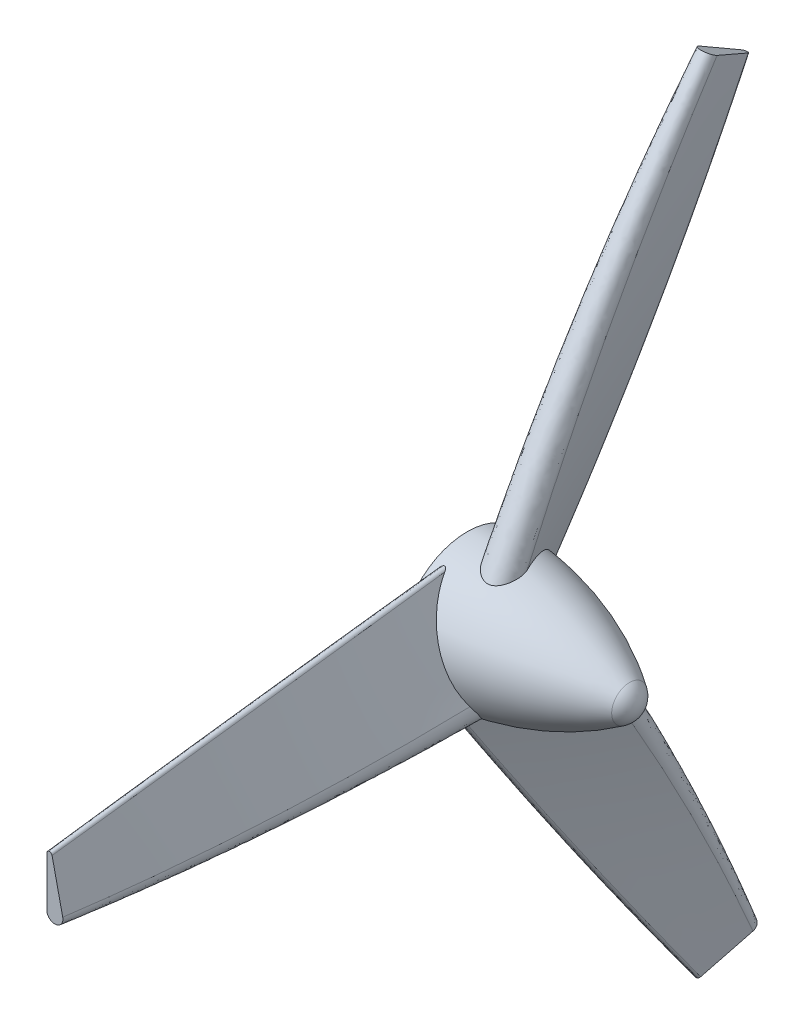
ISO-10303-21;
HEADER;
FILE_DESCRIPTION(('STEP AP214'),'2;1');
FILE_NAME('part.step','',(''),(''),'','','');
FILE_SCHEMA(('AUTOMOTIVE_DESIGN { 1 0 10303 214 1 1 1 1 }'));
ENDSEC;
DATA;
#1=APPLICATION_CONTEXT('core data for automotive mechanical design processes');
#2=APPLICATION_PROTOCOL_DEFINITION('international standard','automotive_design',2000,#1);
#3=PRODUCT_CONTEXT('',#1,'mechanical');
#4=PRODUCT('Part','Part','',(#3));
#5=PRODUCT_RELATED_PRODUCT_CATEGORY('part','',(#4));
#6=PRODUCT_DEFINITION_FORMATION('','',#4);
#7=PRODUCT_DEFINITION_CONTEXT('part definition',#1,'design');
#8=PRODUCT_DEFINITION('design','',#6,#7);
#9=PRODUCT_DEFINITION_SHAPE('','',#8);
#10=(LENGTH_UNIT() NAMED_UNIT(*) SI_UNIT(.MILLI.,.METRE.));
#11=(NAMED_UNIT(*) PLANE_ANGLE_UNIT() SI_UNIT($,.RADIAN.));
#12=(NAMED_UNIT(*) SI_UNIT($,.STERADIAN.) SOLID_ANGLE_UNIT());
#13=UNCERTAINTY_MEASURE_WITH_UNIT(LENGTH_MEASURE(1.E-05),#10,'distance_accuracy_value','');
#14=(GEOMETRIC_REPRESENTATION_CONTEXT(3) GLOBAL_UNCERTAINTY_ASSIGNED_CONTEXT((#13)) GLOBAL_UNIT_ASSIGNED_CONTEXT((#10,
#11,#12)) REPRESENTATION_CONTEXT('',''));
#15=CARTESIAN_POINT('',(0.,0.,0.));
#16=DIRECTION('',(0.,0.,1.));
#17=DIRECTION('',(1.,0.,0.));
#18=AXIS2_PLACEMENT_3D('',#15,#16,#17);
#19=CARTESIAN_POINT('',(26.9239999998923,0.,0.));
#20=DIRECTION('',(-1.,0.,0.));
#21=DIRECTION('',(0.,0.,1.));
#22=AXIS2_PLACEMENT_3D('',#19,#20,#21);
#23=CONICAL_SURFACE('',#22,5.29335999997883,0.916028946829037);
#24=CARTESIAN_POINT('',(26.9239999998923,0.,0.));
#25=DIRECTION('',(-1.,0.,0.));
#26=DIRECTION('',(0.,0.,1.));
#27=AXIS2_PLACEMENT_3D('',#24,#25,#26);
#28=CIRCLE('',#27,5.29335999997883);
#29=CARTESIAN_POINT('',(26.9239999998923,0.,5.29335999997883));
#30=VERTEX_POINT('',#29);
#31=EDGE_CURVE('E142',#30,#30,#28,.T.);
#32=ORIENTED_EDGE('',*,*,#31,.T.);
#33=EDGE_LOOP('',(#32));
#34=FACE_BOUND('',#33,.T.);
#35=CARTESIAN_POINT('',(30.987999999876,0.,0.));
#36=VERTEX_POINT('',#35);
#37=VERTEX_LOOP('',#36);
#38=FACE_BOUND('',#37,.T.);
#39=ADVANCED_FACE('F17',(#34,#38),#23,.F.);
#40=CARTESIAN_POINT('',(32.5373999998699,0.,0.));
#41=DIRECTION('',(-1.,0.,0.));
#42=DIRECTION('',(0.,0.,1.));
#43=AXIS2_PLACEMENT_3D('',#40,#41,#42);
#44=CYLINDRICAL_SURFACE('',#43,5.29335999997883);
#45=ORIENTED_EDGE('',*,*,#31,.F.);
#46=EDGE_LOOP('',(#45));
#47=FACE_BOUND('',#46,.T.);
#48=CARTESIAN_POINT('',(1.52399999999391,0.,0.));
#49=DIRECTION('',(-1.,0.,0.));
#50=DIRECTION('',(0.,0.,1.));
#51=AXIS2_PLACEMENT_3D('',#48,#49,#50);
#52=CIRCLE('',#51,5.29335999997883);
#53=CARTESIAN_POINT('',(1.52399999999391,0.,5.29335999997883));
#54=VERTEX_POINT('',#53);
#55=EDGE_CURVE('E24',#54,#54,#52,.T.);
#56=ORIENTED_EDGE('',*,*,#55,.T.);
#57=EDGE_LOOP('',(#56));
#58=FACE_BOUND('',#57,.T.);
#59=ADVANCED_FACE('F492',(#47,#58),#44,.F.);
#60=CARTESIAN_POINT('',(1.5239999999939,0.,0.));
#61=DIRECTION('',(1.,0.,0.));
#62=DIRECTION('',(0.,0.,-1.));
#63=AXIS2_PLACEMENT_3D('',#60,#61,#62);
#64=PLANE('',#63);
#65=ORIENTED_EDGE('',*,*,#55,.F.);
#66=EDGE_LOOP('',(#65));
#67=FACE_BOUND('',#66,.T.);
#68=CARTESIAN_POINT('',(1.5239999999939,0.,0.));
#69=DIRECTION('',(1.,0.,0.));
#70=DIRECTION('',(0.,0.,-1.));
#71=AXIS2_PLACEMENT_3D('',#68,#69,#70);
#72=CIRCLE('',#71,10.583333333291);
#73=CARTESIAN_POINT('',(1.5239999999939,0.,-10.583333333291));
#74=VERTEX_POINT('',#73);
#75=EDGE_CURVE('E118',#74,#74,#72,.F.);
#76=ORIENTED_EDGE('',*,*,#75,.T.);
#77=EDGE_LOOP('',(#76));
#78=FACE_BOUND('',#77,.T.);
#79=ADVANCED_FACE('F336',(#67,#78),#64,.F.);
#80=CARTESIAN_POINT('',(0.,109.985226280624,-63.5));
#81=DIRECTION('',(0.,0.866025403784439,-0.5));
#82=DIRECTION('',(0.,0.5,0.866025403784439));
#83=AXIS2_PLACEMENT_3D('',#80,#81,#82);
#84=PLANE('',#83);
#85=CARTESIAN_POINT('',(12.392229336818,112.913777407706,-58.4276006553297));
#86=CARTESIAN_POINT('',(12.4060734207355,112.945139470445,-58.3732799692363));
#87=CARTESIAN_POINT('',(12.4172473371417,112.976773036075,-58.3184890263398));
#88=CARTESIAN_POINT('',(12.4342346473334,113.040410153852,-58.2082663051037));
#89=CARTESIAN_POINT('',(12.4400460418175,113.07241383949,-58.1528342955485));
#90=CARTESIAN_POINT('',(12.4493819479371,113.168564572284,-57.9862963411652));
#91=CARTESIAN_POINT('',(12.4448602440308,113.232970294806,-57.8747423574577));
#92=CARTESIAN_POINT('',(12.4219753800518,113.328538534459,-57.7092133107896));
#93=CARTESIAN_POINT('',(12.4116494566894,113.360244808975,-57.6542964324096));
#94=CARTESIAN_POINT('',(12.3856375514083,113.423105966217,-57.5454177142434));
#95=CARTESIAN_POINT('',(12.3699516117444,113.454260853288,-57.4914558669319));
#96=CARTESIAN_POINT('',(12.3151155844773,113.546542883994,-57.3316187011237));
#97=CARTESIAN_POINT('',(12.2681705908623,113.606555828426,-57.2276732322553));
#98=CARTESIAN_POINT('',(12.15496383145,113.721864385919,-57.0279529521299));
#99=CARTESIAN_POINT('',(12.0886891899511,113.777156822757,-56.9321836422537));
#100=CARTESIAN_POINT('',(11.9383208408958,113.881321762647,-56.7517646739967));
#101=CARTESIAN_POINT('',(11.8542248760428,113.930193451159,-56.6671164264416));
#102=CARTESIAN_POINT('',(11.6710322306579,114.020192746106,-56.5112330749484));
#103=CARTESIAN_POINT('',(11.5719588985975,114.061332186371,-56.4399774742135));
#104=CARTESIAN_POINT('',(11.4141772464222,114.116364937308,-56.3446579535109));
#105=CARTESIAN_POINT('',(11.3600297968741,114.133602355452,-56.3148018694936));
#106=CARTESIAN_POINT('',(11.2489965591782,114.165709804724,-56.2591901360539));
#107=CARTESIAN_POINT('',(11.1921107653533,114.180579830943,-56.233434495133));
#108=CARTESIAN_POINT('',(11.0179102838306,114.221541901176,-56.1624861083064));
#109=CARTESIAN_POINT('',(10.8970648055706,114.24398166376,-56.1236192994));
#110=CARTESIAN_POINT('',(10.6496292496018,114.278484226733,-56.0638591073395));
#111=CARTESIAN_POINT('',(10.5230390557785,114.290546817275,-56.0429660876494));
#112=CARTESIAN_POINT('',(10.2672830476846,114.303777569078,-56.020049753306));
#113=CARTESIAN_POINT('',(10.1381116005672,114.304918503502,-56.0180735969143));
#114=CARTESIAN_POINT('',(9.88115055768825,114.296413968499,-56.0328038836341));
#115=CARTESIAN_POINT('',(9.75336096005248,114.286768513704,-56.0495103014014));
#116=CARTESIAN_POINT('',(9.56555391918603,114.264362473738,-56.0883187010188));
#117=CARTESIAN_POINT('',(9.50355808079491,114.255562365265,-56.1035609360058));
#118=CARTESIAN_POINT('',(9.38129653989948,114.235346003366,-56.1385767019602));
#119=CARTESIAN_POINT('',(9.32103086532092,114.223929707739,-56.15835030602));
#120=CARTESIAN_POINT('',(9.1434674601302,114.185934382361,-56.2241601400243));
#121=CARTESIAN_POINT('',(9.02929181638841,114.155595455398,-56.2767087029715));
#122=CARTESIAN_POINT('',(8.81301018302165,114.085898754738,-56.397426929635));
#123=CARTESIAN_POINT('',(8.71087410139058,114.046564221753,-56.4655563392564));
#124=CARTESIAN_POINT('',(8.52144404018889,113.959807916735,-56.6158226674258));
#125=CARTESIAN_POINT('',(8.43414827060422,113.912387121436,-56.6979578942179));
#126=CARTESIAN_POINT('',(8.27660436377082,113.810999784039,-56.8735659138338));
#127=CARTESIAN_POINT('',(8.20633421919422,113.757041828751,-56.9670238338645));
#128=CARTESIAN_POINT('',(8.11528213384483,113.67230752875,-57.1137879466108));
#129=CARTESIAN_POINT('',(8.087313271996,113.643414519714,-57.1638321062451));
#130=CARTESIAN_POINT('',(8.03638897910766,113.58454746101,-57.2657928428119));
#131=CARTESIAN_POINT('',(8.01343353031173,113.554573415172,-57.3177094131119));
#132=CARTESIAN_POINT('',(7.95380336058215,113.465662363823,-57.4717078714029));
#133=CARTESIAN_POINT('',(7.92400958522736,113.405516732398,-57.5758831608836));
#134=CARTESIAN_POINT('',(7.8940824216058,113.314156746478,-57.7341232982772));
#135=CARTESIAN_POINT('',(7.8865672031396,113.283490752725,-57.7872383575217));
#136=CARTESIAN_POINT('',(7.8765293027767,113.221965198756,-57.8938037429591));
#137=CARTESIAN_POINT('',(7.87400502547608,113.19110570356,-57.9472539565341));
#138=CARTESIAN_POINT('',(7.874,113.160226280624,-58.0007386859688));
#139=B_SPLINE_CURVE_WITH_KNOTS('',3,(#85,#86,#87,#88,#89,#90,#91,#92,#93,#94,#95,#96,#97,#98,
#99,#100,#101,#102,#103,#104,#105,#106,#107,#108,#109,#110,#111,#112,#113,#114,#115,#116,#117,
#118,#119,#120,#121,#122,#123,#124,#125,#126,#127,#128,#129,#130,#131,#132,#133,#134,#135,#136,
#137,#138),.UNSPECIFIED.,.F.,.F.,(4,2,2,2,2,2,2,2,2,2,2,2,2,2,2,2,2,2,2,2,2,2,2,2,2,2,4),(0.,
0.192554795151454,0.38518135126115,0.769712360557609,0.962269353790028,1.15482482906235,
1.53952746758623,1.92448694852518,2.30949521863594,2.69390936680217,2.88627996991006,
3.07865097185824,3.46343735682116,3.8482315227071,4.23398470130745,4.6197373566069,
4.81286932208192,5.00600440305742,5.39193477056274,5.77687910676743,6.16177697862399,
6.54617464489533,6.73856534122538,6.93095535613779,7.30083687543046,7.4860435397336,
7.67119099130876),.UNSPECIFIED.);
#140=CARTESIAN_POINT('',(12.392229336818,112.913777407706,-58.4276006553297));
#141=VERTEX_POINT('',#140);
#142=CARTESIAN_POINT('',(7.874,113.160226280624,-58.0007386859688));
#143=VERTEX_POINT('',#142);
#144=EDGE_CURVE('E133',#141,#143,#139,.T.);
#145=ORIENTED_EDGE('',*,*,#144,.F.);
#146=DIRECTION('',(0.2156158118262,0.488239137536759,0.845654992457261));
#147=VECTOR('',#146,1.);
#148=CARTESIAN_POINT('',(10.940050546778,109.625472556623,-64.123111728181));
#149=LINE('',#148,#147);
#150=CARTESIAN_POINT('',(9.38007644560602,106.093076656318,-70.2414008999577));
#151=VERTEX_POINT('',#150);
#152=EDGE_CURVE('E114',#151,#141,#149,.T.);
#153=ORIENTED_EDGE('',*,*,#152,.F.);
#154=CARTESIAN_POINT('',(7.874,106.175226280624,-70.0991135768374));
#155=CARTESIAN_POINT('',(7.87400658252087,106.164421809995,-70.1178274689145));
#156=CARTESIAN_POINT('',(7.875006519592,106.153622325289,-70.1365327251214));
#157=CARTESIAN_POINT('',(7.8788874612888,106.132128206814,-70.1737616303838));
#158=CARTESIAN_POINT('',(7.88176489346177,106.121433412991,-70.1922855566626));
#159=CARTESIAN_POINT('',(7.88930054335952,106.100189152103,-70.2290816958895));
#160=CARTESIAN_POINT('',(7.89396091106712,106.089639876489,-70.2473535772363));
#161=CARTESIAN_POINT('',(7.90500245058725,106.068753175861,-70.2835304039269));
#162=CARTESIAN_POINT('',(7.91138648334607,106.058416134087,-70.3014346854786));
#163=CARTESIAN_POINT('',(7.93300794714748,106.02789920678,-70.3542915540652));
#164=CARTESIAN_POINT('',(7.95073976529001,106.008143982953,-70.3885086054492));
#165=CARTESIAN_POINT('',(7.99252034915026,105.970403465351,-70.4538770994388));
#166=CARTESIAN_POINT('',(8.01656410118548,105.952416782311,-70.4850309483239));
#167=CARTESIAN_POINT('',(8.07069361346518,105.918782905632,-70.5432865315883));
#168=CARTESIAN_POINT('',(8.10079475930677,105.903141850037,-70.5703776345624));
#169=CARTESIAN_POINT('',(8.14953222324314,105.881770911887,-70.6073931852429));
#170=CARTESIAN_POINT('',(8.16638481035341,105.874992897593,-70.6191330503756));
#171=CARTESIAN_POINT('',(8.20118962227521,105.862161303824,-70.6413580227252));
#172=CARTESIAN_POINT('',(8.21914297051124,105.856108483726,-70.6518418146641));
#173=CARTESIAN_POINT('',(8.27380288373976,105.839347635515,-70.6808724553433));
#174=CARTESIAN_POINT('',(8.31192412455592,105.829767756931,-70.6974652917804));
#175=CARTESIAN_POINT('',(8.3908135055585,105.813903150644,-70.7249435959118));
#176=CARTESIAN_POINT('',(8.43158180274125,105.807618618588,-70.7358287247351));
#177=CARTESIAN_POINT('',(8.49403884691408,105.800758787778,-70.7477103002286));
#178=CARTESIAN_POINT('',(8.51518906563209,105.798897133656,-70.750934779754));
#179=CARTESIAN_POINT('',(8.557730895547,105.796088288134,-70.7557998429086));
#180=CARTESIAN_POINT('',(8.57912250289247,105.795141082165,-70.7574404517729));
#181=CARTESIAN_POINT('',(8.64342081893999,105.793665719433,-70.7599958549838));
#182=CARTESIAN_POINT('',(8.68648068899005,105.79450058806,-70.758549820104));
#183=CARTESIAN_POINT('',(8.7715681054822,105.79972666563,-70.7494979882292));
#184=CARTESIAN_POINT('',(8.81359857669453,105.804106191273,-70.741912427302));
#185=CARTESIAN_POINT('',(8.89556047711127,105.816366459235,-70.7206770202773));
#186=CARTESIAN_POINT('',(8.93549219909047,105.824246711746,-70.7070280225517));
#187=CARTESIAN_POINT('',(9.0122900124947,105.843219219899,-70.6741666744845));
#188=CARTESIAN_POINT('',(9.04914930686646,105.854318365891,-70.6549423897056));
#189=CARTESIAN_POINT('',(9.11844559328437,105.879561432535,-70.6112201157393));
#190=CARTESIAN_POINT('',(9.15088258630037,105.893705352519,-70.5867221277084));
#191=CARTESIAN_POINT('',(9.20998160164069,105.924240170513,-70.5338342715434));
#192=CARTESIAN_POINT('',(9.23673545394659,105.940586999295,-70.5055207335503));
#193=CARTESIAN_POINT('',(9.28470967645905,105.975194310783,-70.4455791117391));
#194=CARTESIAN_POINT('',(9.30593160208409,105.993454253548,-70.4139519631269));
#195=CARTESIAN_POINT('',(9.33642111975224,106.025311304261,-70.3587739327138));
#196=CARTESIAN_POINT('',(9.34733819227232,106.038518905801,-70.3358976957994));
#197=CARTESIAN_POINT('',(9.36607986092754,106.065443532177,-70.2892628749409));
#198=CARTESIAN_POINT('',(9.37390996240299,106.079159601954,-70.2655059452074));
#199=CARTESIAN_POINT('',(9.38007644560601,106.093076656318,-70.2414008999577));
#200=B_SPLINE_CURVE_WITH_KNOTS('',3,(#154,#155,#156,#157,#158,#159,#160,#161,#162,#163,#164,
#165,#166,#167,#168,#169,#170,#171,#172,#173,#174,#175,#176,#177,#178,#179,#180,#181,#182,#183,
#184,#185,#186,#187,#188,#189,#190,#191,#192,#193,#194,#195,#196,#197,#198,#199),.UNSPECIFIED.,
.F.,.F.,(4,2,2,2,2,2,2,2,2,2,2,2,2,2,2,2,2,2,2,2,2,2,4),(0.,0.0647895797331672,
0.129456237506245,0.194201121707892,0.259054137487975,0.388341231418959,0.517525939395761,
0.647043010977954,0.711865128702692,0.776754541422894,0.90411315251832,1.03147932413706,
1.09583724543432,1.16019414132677,1.28881803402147,1.41701969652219,1.54520342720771,
1.67366359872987,1.80212374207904,1.92831638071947,2.05447349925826,2.14004938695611,
2.22547195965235),.UNSPECIFIED.);
#201=CARTESIAN_POINT('',(7.874,106.175226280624,-70.0991135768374));
#202=VERTEX_POINT('',#201);
#203=EDGE_CURVE('E107',#202,#151,#200,.T.);
#204=ORIENTED_EDGE('',*,*,#203,.F.);
#205=DIRECTION('',(0.,-0.50000000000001,-0.866025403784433));
#206=VECTOR('',#205,1.);
#207=CARTESIAN_POINT('',(7.874,109.792711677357,-63.8334450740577));
#208=LINE('',#207,#206);
#209=EDGE_CURVE('E112',#143,#202,#208,.T.);
#210=ORIENTED_EDGE('',*,*,#209,.F.);
#211=EDGE_LOOP('',(#145,#153,#204,#210));
#212=FACE_BOUND('',#211,.T.);
#213=ADVANCED_FACE('F110',(#212),#84,.T.);
#214=CARTESIAN_POINT('',(0.,0.,0.));
#215=DIRECTION('',(1.,0.,0.));
#216=DIRECTION('',(0.,0.,-1.));
#217=AXIS2_PLACEMENT_3D('',#214,#215,#216);
#218=CYLINDRICAL_SURFACE('',#217,10.583333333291);
#219=ORIENTED_EDGE('',*,*,#75,.F.);
#220=EDGE_LOOP('',(#219));
#221=FACE_BOUND('',#220,.T.);
#222=CARTESIAN_POINT('',(0.,0.,0.));
#223=DIRECTION('',(1.,0.,0.));
#224=DIRECTION('',(0.,0.,-1.));
#225=AXIS2_PLACEMENT_3D('',#222,#223,#224);
#226=CIRCLE('',#225,10.583333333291);
#227=CARTESIAN_POINT('',(0.,0.,-10.583333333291));
#228=VERTEX_POINT('',#227);
#229=EDGE_CURVE('E128',#228,#228,#226,.T.);
#230=ORIENTED_EDGE('',*,*,#229,.F.);
#231=EDGE_LOOP('',(#230));
#232=FACE_BOUND('',#231,.T.);
#233=ADVANCED_FACE('F270',(#221,#232),#218,.F.);
#234=CARTESIAN_POINT('',(2.90425006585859,-8.20665045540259,-14.2143355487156));
#235=CARTESIAN_POINT('',(4.35054896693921,6.73236376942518,-22.2155746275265));
#236=CARTESIAN_POINT('',(7.3846253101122,44.390364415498,-41.6931028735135));
#237=CARTESIAN_POINT('',(8.9600073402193,82.7846679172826,-59.834614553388));
#238=CARTESIAN_POINT('',(9.38007644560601,106.093076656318,-70.2414008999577));
#239=CARTESIAN_POINT('',(2.76910462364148,-8.31978072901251,-14.4102829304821));
#240=CARTESIAN_POINT('',(4.23469301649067,6.6125648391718,-22.4230724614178));
#241=CARTESIAN_POINT('',(7.30863958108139,44.2666358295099,-41.9074070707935));
#242=CARTESIAN_POINT('',(8.91077167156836,82.6807517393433,-60.0146026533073));
#243=CARTESIAN_POINT('',(9.34442163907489,106.012340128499,-70.3812406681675));
#244=CARTESIAN_POINT('',(2.45238192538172,-8.43567958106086,-14.6110256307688));
#245=CARTESIAN_POINT('',(3.9325204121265,6.48043389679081,-22.6519299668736));
#246=CARTESIAN_POINT('',(7.05400971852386,44.1068771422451,-42.1841172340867));
#247=CARTESIAN_POINT('',(8.72200079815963,82.535793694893,-60.265677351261));
#248=CARTESIAN_POINT('',(9.19901699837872,105.888190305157,-70.5962744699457));
#249=CARTESIAN_POINT('',(1.97592525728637,-8.46327636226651,-14.6588246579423));
#250=CARTESIAN_POINT('',(3.4482041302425,6.43205168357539,-22.7357304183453));
#251=CARTESIAN_POINT('',(6.57417561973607,44.0196514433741,-42.3351965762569));
#252=CARTESIAN_POINT('',(8.30908491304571,82.4403895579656,-60.4309221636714));
#253=CARTESIAN_POINT('',(8.84935183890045,105.799667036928,-70.7496012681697));
#254=CARTESIAN_POINT('',(1.62910268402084,-8.42372119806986,-14.590313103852));
#255=CARTESIAN_POINT('',(3.08488753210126,6.45846762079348,-22.6899766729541));
#256=CARTESIAN_POINT('',(6.1926935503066,44.0192647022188,-42.3358664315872));
#257=CARTESIAN_POINT('',(7.9668662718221,82.4288627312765,-60.4508872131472));
#258=CARTESIAN_POINT('',(8.5512781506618,105.78691780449,-70.7716835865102));
#259=CARTESIAN_POINT('',(1.33039983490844,-8.32712804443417,-14.4230088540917));
#260=CARTESIAN_POINT('',(2.76281306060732,6.54669535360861,-22.5371617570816));
#261=CARTESIAN_POINT('',(5.83736615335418,44.0880810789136,-42.216672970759));
#262=CARTESIAN_POINT('',(7.64102766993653,82.4816722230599,-60.3594184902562));
#263=CARTESIAN_POINT('',(8.26571354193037,105.831501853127,-70.6944617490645));
#264=CARTESIAN_POINT('',(1.03741611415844,-8.13724793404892,-14.0941268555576));
#265=CARTESIAN_POINT('',(2.4340383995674,6.73104461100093,-22.2178594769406));
#266=CARTESIAN_POINT('',(5.45294840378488,44.2550987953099,-41.9273898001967));
#267=CARTESIAN_POINT('',(7.28764325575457,82.623932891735,-60.1130157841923));
#268=CARTESIAN_POINT('',(7.96244714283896,105.955639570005,-70.4794489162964));
#269=CARTESIAN_POINT('',(0.982393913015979,-7.9429440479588,-13.7575826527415));
#270=CARTESIAN_POINT('',(2.35201609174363,6.92751762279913,-21.87755823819));
#271=CARTESIAN_POINT('',(5.32849443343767,44.4483656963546,-41.5926417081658));
#272=CARTESIAN_POINT('',(7.17441598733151,82.7865124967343,-59.8314196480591));
#273=CARTESIAN_POINT('',(7.874,106.092544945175,-70.2423218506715));
#274=CARTESIAN_POINT('',(1.0501266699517,-7.815595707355,-13.5370088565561));
#275=CARTESIAN_POINT('',(2.40323997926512,7.05831082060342,-21.6510177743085));
#276=CARTESIAN_POINT('',(5.34382399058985,44.5774102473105,-41.3691299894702));
#277=CARTESIAN_POINT('',(7.17479356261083,82.8926834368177,-59.6475261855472));
#278=CARTESIAN_POINT('',(7.874,106.175226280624,-70.0991135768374));
#279=B_SPLINE_SURFACE_WITH_KNOTS('',3,3,((#234,#235,#236,#237,#238),(#239,#240,#241,#242,#243),
(#244,#245,#246,#247,#248),(#249,#250,#251,#252,#253),(#254,#255,#256,#257,#258),(#259,#260,
#261,#262,#263),(#264,#265,#266,#267,#268),(#269,#270,#271,#272,#273),(#274,#275,#276,#277,
#278)),.UNSPECIFIED.,.F.,.F.,.F.,(4,1,1,1,1,1,4),(4,1,4),(0.,0.25,0.375,0.5,0.625,0.75,1.),(0.,
2.00439319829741,5.01313921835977),.UNSPECIFIED.);
#280=CARTESIAN_POINT('',(2.90425006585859,-8.20665045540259,-14.2143355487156));
#281=CARTESIAN_POINT('',(4.35054896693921,6.73236376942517,-22.2155746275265));
#282=CARTESIAN_POINT('',(7.3846253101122,44.390364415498,-41.6931028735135));
#283=CARTESIAN_POINT('',(8.9600073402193,82.7846679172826,-59.834614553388));
#284=CARTESIAN_POINT('',(9.38007644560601,106.093076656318,-70.2414008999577));
#285=B_SPLINE_CURVE_WITH_KNOTS('',3,(#280,#281,#282,#283,#284),.UNSPECIFIED.,.F.,.F.,(4,1,4),
(0.,2.00439319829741,5.01313921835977),.UNSPECIFIED.);
#286=CARTESIAN_POINT('',(3.73771322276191,0.700754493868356,-18.9524049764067));
#287=VERTEX_POINT('',#286);
#288=EDGE_CURVE('E117',#287,#151,#285,.T.);
#289=CARTESIAN_POINT('',(1.92551654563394,2.11443738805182,-18.9096963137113));
#290=CARTESIAN_POINT('',(1.91417801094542,2.05409243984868,-18.9167113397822));
#291=CARTESIAN_POINT('',(1.90469081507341,1.99337846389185,-18.923426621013));
#292=CARTESIAN_POINT('',(1.88924157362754,1.8714432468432,-18.9362302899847));
#293=CARTESIAN_POINT('',(1.88327912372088,1.81022206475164,-18.9423187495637));
#294=CARTESIAN_POINT('',(1.87469860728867,1.68747898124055,-18.9538439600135));
#295=CARTESIAN_POINT('',(1.8720811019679,1.62595703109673,-18.9592806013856));
#296=CARTESIAN_POINT('',(1.8700654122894,1.50211894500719,-18.9695418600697));
#297=CARTESIAN_POINT('',(1.87070347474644,1.43980160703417,-18.9743589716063));
#298=CARTESIAN_POINT('',(1.87522113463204,1.31523597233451,-18.9832974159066));
#299=CARTESIAN_POINT('',(1.87910068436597,1.25298767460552,-18.9874187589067));
#300=CARTESIAN_POINT('',(1.89011493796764,1.12875234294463,-18.994957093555));
#301=CARTESIAN_POINT('',(1.89724879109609,1.06676524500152,-18.9983742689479));
#302=CARTESIAN_POINT('',(1.91501317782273,0.942242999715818,-19.0045495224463));
#303=CARTESIAN_POINT('',(1.92569778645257,0.879714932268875,-19.0072961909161));
#304=CARTESIAN_POINT('',(1.95079039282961,0.75537536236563,-19.0120538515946));
#305=CARTESIAN_POINT('',(1.96519836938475,0.693563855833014,-19.0140648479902));
#306=CARTESIAN_POINT('',(1.99797305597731,0.57123340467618,-19.0173450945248));
#307=CARTESIAN_POINT('',(2.01632387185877,0.510710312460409,-19.0186172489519));
#308=CARTESIAN_POINT('',(2.05741694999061,0.391178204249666,-19.0204367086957));
#309=CARTESIAN_POINT('',(2.08015685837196,0.332168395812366,-19.0209844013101));
#310=CARTESIAN_POINT('',(2.12905037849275,0.220103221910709,-19.0213528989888));
#311=CARTESIAN_POINT('',(2.1548852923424,0.166910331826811,-19.0212187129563));
#312=CARTESIAN_POINT('',(2.21186103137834,0.063321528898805,-19.0203380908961));
#313=CARTESIAN_POINT('',(2.24300574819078,0.0129277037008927,-19.0195912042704));
#314=CARTESIAN_POINT('',(2.30581194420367,-0.0748149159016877,-19.0176961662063));
#315=CARTESIAN_POINT('',(2.3364285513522,-0.112903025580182,-19.0166411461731));
#316=CARTESIAN_POINT('',(2.40310379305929,-0.183987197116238,-19.0141709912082));
#317=CARTESIAN_POINT('',(2.43914546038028,-0.216998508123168,-19.0127569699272));
#318=CARTESIAN_POINT('',(2.50302294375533,-0.264323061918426,-19.0102268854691));
#319=CARTESIAN_POINT('',(2.52905012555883,-0.281062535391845,-19.0091905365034));
#320=CARTESIAN_POINT('',(2.58337990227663,-0.310259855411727,-19.0070532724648));
#321=CARTESIAN_POINT('',(2.61167757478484,-0.322726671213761,-19.0059524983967));
#322=CARTESIAN_POINT('',(2.67038415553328,-0.34249431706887,-19.0037277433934));
#323=CARTESIAN_POINT('',(2.70081166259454,-0.349741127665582,-19.0026036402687));
#324=CARTESIAN_POINT('',(2.76249896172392,-0.358146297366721,-19.0004047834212));
#325=CARTESIAN_POINT('',(2.79375828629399,-0.359308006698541,-18.9993300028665));
#326=CARTESIAN_POINT('',(2.85202301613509,-0.355821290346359,-18.9974006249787));
#327=CARTESIAN_POINT('',(2.87907489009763,-0.351876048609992,-18.996535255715));
#328=CARTESIAN_POINT('',(2.93225686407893,-0.339817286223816,-18.9948817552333));
#329=CARTESIAN_POINT('',(2.95838567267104,-0.33169815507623,-18.9940937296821));
#330=CARTESIAN_POINT('',(3.0021936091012,-0.314706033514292,-18.9927972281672));
#331=CARTESIAN_POINT('',(3.02020621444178,-0.306666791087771,-18.9922718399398));
#332=CARTESIAN_POINT('',(3.05542781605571,-0.289031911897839,-18.9912515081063));
#333=CARTESIAN_POINT('',(3.07263753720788,-0.279437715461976,-18.9907565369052));
#334=CARTESIAN_POINT('',(3.12312538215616,-0.248616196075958,-18.9893026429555));
#335=CARTESIAN_POINT('',(3.15518476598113,-0.225381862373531,-18.9883769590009));
#336=CARTESIAN_POINT('',(3.21208873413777,-0.178618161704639,-18.9866731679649));
#337=CARTESIAN_POINT('',(3.23732394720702,-0.155547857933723,-18.9858919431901));
#338=CARTESIAN_POINT('',(3.28573765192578,-0.107324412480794,-18.9843119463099));
#339=CARTESIAN_POINT('',(3.3089147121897,-0.0821698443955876,-18.9835131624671));
#340=CARTESIAN_POINT('',(3.37589039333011,-0.00409098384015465,-18.9810395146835));
#341=CARTESIAN_POINT('',(3.41688928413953,0.0512341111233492,-18.9792942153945));
#342=CARTESIAN_POINT('',(3.48546766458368,0.154812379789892,-18.975830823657));
#343=CARTESIAN_POINT('',(3.51411292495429,0.20238770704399,-18.9741716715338));
#344=CARTESIAN_POINT('',(3.5679306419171,0.299511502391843,-18.9705765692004));
#345=CARTESIAN_POINT('',(3.59309985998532,0.349061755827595,-18.9686403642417));
#346=CARTESIAN_POINT('',(3.63973670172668,0.44843413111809,-18.9645028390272));
#347=CARTESIAN_POINT('',(3.66127716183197,0.498222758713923,-18.9623087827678));
#348=CARTESIAN_POINT('',(3.70153594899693,0.598791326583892,-18.957602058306));
#349=CARTESIAN_POINT('',(3.72026027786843,0.64956889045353,-18.955090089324));
#350=CARTESIAN_POINT('',(3.73771322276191,0.700754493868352,-18.9524049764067));
#351=B_SPLINE_CURVE_WITH_KNOTS('',3,(#289,#290,#291,#292,#293,#294,#295,#296,#297,#298,#299,
#300,#301,#302,#303,#304,#305,#306,#307,#308,#309,#310,#311,#312,#313,#314,#315,#316,#317,#318,
#319,#320,#321,#322,#323,#324,#325,#326,#327,#328,#329,#330,#331,#332,#333,#334,#335,#336,#337,
#338,#339,#340,#341,#342,#343,#344,#345,#346,#347,#348,#349,#350),.UNSPECIFIED.,.F.,.F.,(4,2,2,
2,2,2,2,2,2,2,2,2,2,2,2,2,2,2,2,2,2,2,2,2,2,2,2,2,2,2,4),(0.,0.185352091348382,
0.370682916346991,0.556044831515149,0.743475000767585,0.930902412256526,1.11828085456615,
1.30865473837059,1.49902753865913,1.68864685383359,1.87816475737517,2.05534225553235,
2.23265017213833,2.37891939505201,2.52474030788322,2.61731952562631,2.70970319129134,
2.80302967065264,2.89630476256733,2.97800378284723,3.05981291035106,3.11893045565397,
3.17799355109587,3.29636794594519,3.39883787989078,3.50137852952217,3.70742487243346,
3.87396633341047,4.04066192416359,4.2034567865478,4.36589962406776),.UNSPECIFIED.);
#352=CARTESIAN_POINT('',(1.92551654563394,2.11443738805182,-18.9096963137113));
#353=VERTEX_POINT('',#352);
#354=EDGE_CURVE('E125',#353,#287,#351,.T.);
#355=CARTESIAN_POINT('',(1.0501266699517,-7.815595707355,-13.5370088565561));
#356=CARTESIAN_POINT('',(2.40323997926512,7.05831082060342,-21.6510177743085));
#357=CARTESIAN_POINT('',(5.34382399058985,44.5774102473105,-41.3691299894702));
#358=CARTESIAN_POINT('',(7.17479356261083,82.8926834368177,-59.6475261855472));
#359=CARTESIAN_POINT('',(7.874,106.175226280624,-70.0991135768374));
#360=B_SPLINE_CURVE_WITH_KNOTS('',3,(#355,#356,#357,#358,#359),.UNSPECIFIED.,.F.,.F.,(4,1,4),
(0.,2.00439319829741,5.01313921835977),.UNSPECIFIED.);
#361=EDGE_CURVE('E122',#202,#353,#360,.F.);
#362=ORIENTED_EDGE('',*,*,#288,.F.);
#363=ORIENTED_EDGE('',*,*,#354,.F.);
#364=ORIENTED_EDGE('',*,*,#361,.F.);
#365=ORIENTED_EDGE('',*,*,#203,.T.);
#366=EDGE_LOOP('',(#362,#363,#364,#365));
#367=FACE_BOUND('',#366,.T.);
#368=ADVANCED_FACE('F123',(#367),#279,.T.);
#369=CARTESIAN_POINT('',(16.843187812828,3.46163680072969,5.99573081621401));
#370=CARTESIAN_POINT('',(16.2019365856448,18.8343760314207,-1.25427451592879));
#371=CARTESIAN_POINT('',(14.6461640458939,56.4973639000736,-20.7231646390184));
#372=CARTESIAN_POINT('',(13.2105565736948,92.1960133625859,-43.5336860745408));
#373=CARTESIAN_POINT('',(12.392229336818,112.913777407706,-58.4276006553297));
#374=CARTESIAN_POINT('',(16.2436354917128,2.95975144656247,5.12643988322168));
#375=CARTESIAN_POINT('',(15.7015328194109,18.3240857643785,-2.13812318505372));
#376=CARTESIAN_POINT('',(14.3553257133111,56.007384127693,-21.5718344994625));
#377=CARTESIAN_POINT('',(13.0432104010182,91.8156834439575,-44.1924368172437));
#378=CARTESIAN_POINT('',(12.2689627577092,112.634653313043,-58.9110577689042));
#379=CARTESIAN_POINT('',(15.0422648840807,1.95408389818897,3.38457259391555));
#380=CARTESIAN_POINT('',(14.6929669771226,17.30066498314,-3.91073997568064));
#381=CARTESIAN_POINT('',(13.7680359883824,55.0137167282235,-23.2929169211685));
#382=CARTESIAN_POINT('',(12.7103213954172,91.0575470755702,-45.5055675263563));
#383=CARTESIAN_POINT('',(12.0272639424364,112.08735198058,-59.8590114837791));
#384=CARTESIAN_POINT('',(12.6408949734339,-0.0561032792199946,-0.0971737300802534));
#385=CARTESIAN_POINT('',(12.6713836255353,15.2391234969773,-7.48143457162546));
#386=CARTESIAN_POINT('',(12.570771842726,53.0003289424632,-26.780206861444));
#387=CARTESIAN_POINT('',(12.0300663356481,89.5244131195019,-48.1610334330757));
#388=CARTESIAN_POINT('',(11.5471770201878,111.000246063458,-61.7419341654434));
#389=CARTESIAN_POINT('',(9.6613197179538,-2.55030625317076,-4.41726000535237));
#390=CARTESIAN_POINT('',(10.1464986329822,12.6607985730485,-11.9472243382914));
#391=CARTESIAN_POINT('',(11.0452265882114,50.4458697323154,-31.2046599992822));
#392=CARTESIAN_POINT('',(11.1586654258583,87.5813758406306,-51.5264727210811));
#393=CARTESIAN_POINT('',(10.9446033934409,109.635781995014,-64.1052552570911));
#394=CARTESIAN_POINT('',(6.76343647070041,-4.97612483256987,-8.61890103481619));
#395=CARTESIAN_POINT('',(7.67049599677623,10.1300399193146,-16.330626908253));
#396=CARTESIAN_POINT('',(9.50835862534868,47.8900471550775,-35.63147455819));
#397=CARTESIAN_POINT('',(10.260883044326,85.6041481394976,-54.9511315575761));
#398=CARTESIAN_POINT('',(10.3192655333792,108.219770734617,-66.5578587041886));
#399=CARTESIAN_POINT('',(4.52545057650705,-6.84954322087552,-11.8637568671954));
#400=CARTESIAN_POINT('',(5.75071249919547,8.16211563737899,-19.739171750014));
#401=CARTESIAN_POINT('',(8.28791987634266,45.8763775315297,-39.1192526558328));
#402=CARTESIAN_POINT('',(9.52036164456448,83.998707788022,-57.731835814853));
#403=CARTESIAN_POINT('',(9.79407781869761,107.030538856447,-68.6176687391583));
#404=CARTESIAN_POINT('',(3.43844878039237,-7.7594726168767,-13.4398008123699));
#405=CARTESIAN_POINT('',(4.80850077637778,7.20590126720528,-21.3953836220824));
#406=CARTESIAN_POINT('',(7.68497934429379,44.8794349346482,-40.8460078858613));
#407=CARTESIAN_POINT('',(9.154624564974,83.1954245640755,-59.123163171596));
#408=CARTESIAN_POINT('',(9.52101165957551,106.412209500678,-69.6886465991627));
#409=CARTESIAN_POINT('',(2.90425006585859,-8.20665045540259,-14.2143355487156));
#410=CARTESIAN_POINT('',(4.35054896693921,6.73236376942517,-22.2155746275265));
#411=CARTESIAN_POINT('',(7.3846253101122,44.390364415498,-41.6931028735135));
#412=CARTESIAN_POINT('',(8.9600073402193,82.7846679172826,-59.834614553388));
#413=CARTESIAN_POINT('',(9.38007644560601,106.093076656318,-70.2414008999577));
#414=B_SPLINE_SURFACE_WITH_KNOTS('',3,3,((#369,#370,#371,#372,#373),(#374,#375,#376,#377,#378),
(#379,#380,#381,#382,#383),(#384,#385,#386,#387,#388),(#389,#390,#391,#392,#393),(#394,#395,
#396,#397,#398),(#399,#400,#401,#402,#403),(#404,#405,#406,#407,#408),(#409,#410,#411,#412,
#413)),.UNSPECIFIED.,.F.,.F.,.F.,(4,1,1,1,1,1,4),(4,1,4),(0.,0.125,0.25,0.5,0.75,0.875,1.),(0.,
2.00439319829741,5.01313921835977),.UNSPECIFIED.);
#415=CARTESIAN_POINT('',(16.843187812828,3.46163680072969,5.99573081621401));
#416=CARTESIAN_POINT('',(16.2019365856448,18.8343760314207,-1.25427451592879));
#417=CARTESIAN_POINT('',(14.6461640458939,56.4973639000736,-20.7231646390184));
#418=CARTESIAN_POINT('',(13.2105565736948,92.1960133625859,-43.5336860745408));
#419=CARTESIAN_POINT('',(12.392229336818,112.913777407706,-58.4276006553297));
#420=B_SPLINE_CURVE_WITH_KNOTS('',3,(#415,#416,#417,#418,#419),.UNSPECIFIED.,.F.,.F.,(4,1,4),
(0.,2.00439319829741,5.01313921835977),.UNSPECIFIED.);
#421=CARTESIAN_POINT('',(16.2628295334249,17.4153248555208,-0.774764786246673));
#422=VERTEX_POINT('',#421);
#423=EDGE_CURVE('E240',#422,#141,#420,.T.);
#424=CARTESIAN_POINT('',(3.73771322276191,0.700754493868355,-18.9524049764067));
#425=CARTESIAN_POINT('',(3.82985140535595,0.971224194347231,-18.938225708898));
#426=CARTESIAN_POINT('',(3.92374311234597,1.24073811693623,-18.9180437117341));
#427=CARTESIAN_POINT('',(4.11482150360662,1.77742459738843,-18.865832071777));
#428=CARTESIAN_POINT('',(4.2120080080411,2.04459728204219,-18.8338030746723));
#429=CARTESIAN_POINT('',(4.50809001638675,2.84168796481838,-18.7202238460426));
#430=CARTESIAN_POINT('',(4.71161768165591,3.36750005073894,-18.6211641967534));
#431=CARTESIAN_POINT('',(5.12849399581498,4.40319929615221,-18.3781895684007));
#432=CARTESIAN_POINT('',(5.34182105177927,4.91311767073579,-18.2343695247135));
#433=CARTESIAN_POINT('',(5.77677330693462,5.9151326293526,-17.9034839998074));
#434=CARTESIAN_POINT('',(5.99839924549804,6.40722761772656,-17.7164146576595));
#435=CARTESIAN_POINT('',(6.44851531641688,7.36972168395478,-17.3011620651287));
#436=CARTESIAN_POINT('',(6.67699782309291,7.84014348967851,-17.0730231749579));
#437=CARTESIAN_POINT('',(7.14009160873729,8.756701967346,-16.5776098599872));
#438=CARTESIAN_POINT('',(7.37470268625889,9.2028394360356,-16.3103367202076));
#439=CARTESIAN_POINT('',(7.84914160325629,10.0680677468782,-15.7388321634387));
#440=CARTESIAN_POINT('',(8.08897105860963,10.4871500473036,-15.4345891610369));
#441=CARTESIAN_POINT('',(8.57280962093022,11.2954055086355,-14.7916371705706));
#442=CARTESIAN_POINT('',(8.81681887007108,11.6845776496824,-14.452927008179));
#443=CARTESIAN_POINT('',(9.31825971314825,12.4458194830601,-13.7290140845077));
#444=CARTESIAN_POINT('',(9.57583012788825,12.8165240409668,-13.3424707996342));
#445=CARTESIAN_POINT('',(10.0936025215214,13.5200430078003,-12.537931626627));
#446=CARTESIAN_POINT('',(10.353804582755,13.852856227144,-12.1199347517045));
#447=CARTESIAN_POINT('',(10.8760957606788,14.4782714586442,-11.2555537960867));
#448=CARTESIAN_POINT('',(11.1381857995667,14.7708521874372,-10.8091548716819));
#449=CARTESIAN_POINT('',(11.6632616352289,15.3133233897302,-9.89165213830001));
#450=CARTESIAN_POINT('',(11.9262474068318,15.5632150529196,-9.42054901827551));
#451=CARTESIAN_POINT('',(12.4567376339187,16.0221562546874,-8.44908265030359));
#452=CARTESIAN_POINT('',(12.7242431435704,16.2304419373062,-7.94835884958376));
#453=CARTESIAN_POINT('',(13.2584310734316,16.5989516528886,-6.92898709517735));
#454=CARTESIAN_POINT('',(13.5251133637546,16.7591684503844,-6.41033645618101));
#455=CARTESIAN_POINT('',(14.0562931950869,17.0296713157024,-5.3602085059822));
#456=CARTESIAN_POINT('',(14.3207935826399,17.1400381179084,-4.82875341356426));
#457=CARTESIAN_POINT('',(14.847031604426,17.3098727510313,-3.75670461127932));
#458=CARTESIAN_POINT('',(15.1087706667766,17.3693683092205,-3.21611604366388));
#459=CARTESIAN_POINT('',(15.5191840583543,17.4225759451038,-2.3576051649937));
#460=CARTESIAN_POINT('',(15.6692657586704,17.433408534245,-2.04132573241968));
#461=CARTESIAN_POINT('',(15.9675026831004,17.4375207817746,-1.40831210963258));
#462=CARTESIAN_POINT('',(16.1156604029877,17.4308260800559,-1.09157926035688));
#463=CARTESIAN_POINT('',(16.2628295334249,17.4153248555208,-0.77476478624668));
#464=B_SPLINE_CURVE_WITH_KNOTS('',3,(#424,#425,#426,#427,#428,#429,#430,#431,#432,#433,#434,
#435,#436,#437,#438,#439,#440,#441,#442,#443,#444,#445,#446,#447,#448,#449,#450,#451,#452,#453,
#454,#455,#456,#457,#458,#459,#460,#461,#462,#463),.UNSPECIFIED.,.F.,.F.,(4,2,2,2,2,2,2,2,2,2,2,
2,2,2,2,2,2,2,2,4),(0.,0.858104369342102,1.71616197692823,3.43126043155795,5.14274572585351,
6.85438386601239,8.56418419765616,10.2739283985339,11.9842097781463,13.694549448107,
15.4753522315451,17.256210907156,19.0380080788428,20.8197555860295,22.6316960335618,
24.4439090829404,26.2531765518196,28.0614572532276,29.1118033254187,30.1606137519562),.UNSPECIFIED.);
#465=EDGE_CURVE('E228',#287,#422,#464,.T.);
#466=ORIENTED_EDGE('',*,*,#423,.F.);
#467=ORIENTED_EDGE('',*,*,#465,.F.);
#468=ORIENTED_EDGE('',*,*,#288,.T.);
#469=ORIENTED_EDGE('',*,*,#152,.T.);
#470=EDGE_LOOP('',(#466,#467,#468,#469));
#471=FACE_BOUND('',#470,.T.);
#472=ADVANCED_FACE('F268',(#471),#414,.T.);
#473=CARTESIAN_POINT('',(0.,-109.985226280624,-63.5));
#474=DIRECTION('',(0.,-0.866025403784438,-0.5));
#475=DIRECTION('',(0.,0.5,-0.866025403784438));
#476=AXIS2_PLACEMENT_3D('',#473,#474,#475);
#477=PLANE('',#476);
#478=CARTESIAN_POINT('',(12.392229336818,-107.056675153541,-68.5723993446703));
#479=CARTESIAN_POINT('',(12.4060734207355,-107.025313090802,-68.6267200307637));
#480=CARTESIAN_POINT('',(12.4172473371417,-106.993679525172,-68.6815109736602));
#481=CARTESIAN_POINT('',(12.4342346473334,-106.930042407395,-68.7917336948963));
#482=CARTESIAN_POINT('',(12.4400460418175,-106.898038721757,-68.8471657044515));
#483=CARTESIAN_POINT('',(12.4493819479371,-106.801887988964,-69.0137036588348));
#484=CARTESIAN_POINT('',(12.4448602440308,-106.737482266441,-69.1252576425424));
#485=CARTESIAN_POINT('',(12.4219753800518,-106.641914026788,-69.2907866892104));
#486=CARTESIAN_POINT('',(12.4116494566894,-106.610207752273,-69.3457035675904));
#487=CARTESIAN_POINT('',(12.3856375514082,-106.54734659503,-69.4545822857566));
#488=CARTESIAN_POINT('',(12.3699516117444,-106.516191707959,-69.5085441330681));
#489=CARTESIAN_POINT('',(12.3151155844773,-106.423909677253,-69.6683812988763));
#490=CARTESIAN_POINT('',(12.2681705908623,-106.363896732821,-69.7723267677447));
#491=CARTESIAN_POINT('',(12.15496383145,-106.248588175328,-69.9720470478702));
#492=CARTESIAN_POINT('',(12.0886891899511,-106.193295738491,-70.0678163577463));
#493=CARTESIAN_POINT('',(11.9383208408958,-106.089130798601,-70.2482353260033));
#494=CARTESIAN_POINT('',(11.8542248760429,-106.040259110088,-70.3328835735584));
#495=CARTESIAN_POINT('',(11.6710322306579,-105.950259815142,-70.4887669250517));
#496=CARTESIAN_POINT('',(11.5719588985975,-105.909120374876,-70.5600225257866));
#497=CARTESIAN_POINT('',(11.4141772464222,-105.854087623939,-70.6553420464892));
#498=CARTESIAN_POINT('',(11.360029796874,-105.836850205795,-70.6851981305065));
#499=CARTESIAN_POINT('',(11.248996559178,-105.804742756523,-70.7408098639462));
#500=CARTESIAN_POINT('',(11.1921107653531,-105.789872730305,-70.7665655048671));
#501=CARTESIAN_POINT('',(11.0179102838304,-105.748910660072,-70.8375138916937));
#502=CARTESIAN_POINT('',(10.8970648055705,-105.726470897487,-70.8763807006));
#503=CARTESIAN_POINT('',(10.6496292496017,-105.691968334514,-70.9361408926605));
#504=CARTESIAN_POINT('',(10.5230390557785,-105.679905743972,-70.9570339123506));
#505=CARTESIAN_POINT('',(10.2672830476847,-105.66667499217,-70.9799502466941));
#506=CARTESIAN_POINT('',(10.1381116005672,-105.665534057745,-70.9819264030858));
#507=CARTESIAN_POINT('',(9.88115055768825,-105.674038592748,-70.9671961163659));
#508=CARTESIAN_POINT('',(9.75336096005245,-105.683684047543,-70.9504896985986));
#509=CARTESIAN_POINT('',(9.56555391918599,-105.706090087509,-70.9116812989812));
#510=CARTESIAN_POINT('',(9.50355808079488,-105.714890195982,-70.8964390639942));
#511=CARTESIAN_POINT('',(9.38129653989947,-105.735106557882,-70.8614232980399));
#512=CARTESIAN_POINT('',(9.32103086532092,-105.746522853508,-70.84164969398));
#513=CARTESIAN_POINT('',(9.14346746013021,-105.784518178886,-70.7758398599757));
#514=CARTESIAN_POINT('',(9.02929181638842,-105.814857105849,-70.7232912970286));
#515=CARTESIAN_POINT('',(8.81301018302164,-105.884553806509,-70.6025730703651));
#516=CARTESIAN_POINT('',(8.71087410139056,-105.923888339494,-70.5344436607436));
#517=CARTESIAN_POINT('',(8.52144404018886,-106.010644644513,-70.3841773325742));
#518=CARTESIAN_POINT('',(8.43414827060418,-106.058065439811,-70.3020421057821));
#519=CARTESIAN_POINT('',(8.27660436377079,-106.159452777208,-70.1264340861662));
#520=CARTESIAN_POINT('',(8.20633421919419,-106.213410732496,-70.0329761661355));
#521=CARTESIAN_POINT('',(8.11528213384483,-106.298145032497,-69.8862120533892));
#522=CARTESIAN_POINT('',(8.087313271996,-106.327038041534,-69.8361678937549));
#523=CARTESIAN_POINT('',(8.03638897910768,-106.385905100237,-69.7342071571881));
#524=CARTESIAN_POINT('',(8.01343353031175,-106.415879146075,-69.6822905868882));
#525=CARTESIAN_POINT('',(7.95380336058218,-106.504790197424,-69.5282921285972));
#526=CARTESIAN_POINT('',(7.92400958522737,-106.564935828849,-69.4241168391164));
#527=CARTESIAN_POINT('',(7.89408242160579,-106.65629581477,-69.2658767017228));
#528=CARTESIAN_POINT('',(7.88656720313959,-106.686961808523,-69.2127616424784));
#529=CARTESIAN_POINT('',(7.8765293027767,-106.748487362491,-69.1061962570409));
#530=CARTESIAN_POINT('',(7.87400502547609,-106.779346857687,-69.0527460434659));
#531=CARTESIAN_POINT('',(7.874,-106.810226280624,-68.9992613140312));
#532=B_SPLINE_CURVE_WITH_KNOTS('',3,(#478,#479,#480,#481,#482,#483,#484,#485,#486,#487,#488,
#489,#490,#491,#492,#493,#494,#495,#496,#497,#498,#499,#500,#501,#502,#503,#504,#505,#506,#507,
#508,#509,#510,#511,#512,#513,#514,#515,#516,#517,#518,#519,#520,#521,#522,#523,#524,#525,#526,
#527,#528,#529,#530,#531),.UNSPECIFIED.,.F.,.F.,(4,2,2,2,2,2,2,2,2,2,2,2,2,2,2,2,2,2,2,2,2,2,2,
2,2,2,4),(0.,0.192554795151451,0.38518135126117,0.769712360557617,0.962269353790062,
1.15482482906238,1.53952746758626,1.92448694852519,2.30949521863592,2.69390936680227,
2.88627996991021,3.07865097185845,3.46343735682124,3.84823152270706,4.23398470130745,
4.61973735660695,4.81286932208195,5.00600440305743,5.39193477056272,5.77687910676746,
6.1617769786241,6.54617464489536,6.73856534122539,6.93095535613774,7.30083687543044,
7.48604353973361,7.67119099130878),.UNSPECIFIED.);
#533=CARTESIAN_POINT('',(12.392229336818,-107.056675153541,-68.5723993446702));
#534=VERTEX_POINT('',#533);
#535=CARTESIAN_POINT('',(7.874,-106.810226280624,-68.9992613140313));
#536=VERTEX_POINT('',#535);
#537=EDGE_CURVE('E141',#534,#536,#532,.T.);
#538=ORIENTED_EDGE('',*,*,#537,.F.);
#539=DIRECTION('',(0.2156158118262,0.488239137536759,-0.845654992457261));
#540=VECTOR('',#539,1.);
#541=CARTESIAN_POINT('',(10.940050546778,-110.344980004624,-62.876888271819));
#542=LINE('',#541,#540);
#543=CARTESIAN_POINT('',(9.38007644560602,-113.877375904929,-56.7585991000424));
#544=VERTEX_POINT('',#543);
#545=EDGE_CURVE('E202',#544,#534,#542,.T.);
#546=ORIENTED_EDGE('',*,*,#545,.F.);
#547=CARTESIAN_POINT('',(7.874,-113.795226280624,-56.9008864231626));
#548=CARTESIAN_POINT('',(7.87400768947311,-113.806018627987,-56.8821935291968));
#549=CARTESIAN_POINT('',(7.87499173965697,-113.816801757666,-56.8635166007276));
#550=CARTESIAN_POINT('',(7.87882056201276,-113.838281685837,-56.8263122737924));
#551=CARTESIAN_POINT('',(7.88166464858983,-113.848978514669,-56.8077848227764));
#552=CARTESIAN_POINT('',(7.89286896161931,-113.880903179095,-56.752489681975));
#553=CARTESIAN_POINT('',(7.90390030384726,-113.90191026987,-56.7161043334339));
#554=CARTESIAN_POINT('',(7.9326680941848,-113.942711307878,-56.6454348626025));
#555=CARTESIAN_POINT('',(7.9503983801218,-113.962506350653,-56.6111488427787));
#556=CARTESIAN_POINT('',(7.99231232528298,-114.000272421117,-56.5457360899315));
#557=CARTESIAN_POINT('',(8.01648085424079,-114.018247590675,-56.5146021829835));
#558=CARTESIAN_POINT('',(8.0704385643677,-114.051388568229,-56.4572003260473));
#559=CARTESIAN_POINT('',(8.10011519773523,-114.066600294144,-56.430852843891));
#560=CARTESIAN_POINT('',(8.16409829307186,-114.094405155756,-56.3826934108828));
#561=CARTESIAN_POINT('',(8.19841487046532,-114.106992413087,-56.3608916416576));
#562=CARTESIAN_POINT('',(8.27087910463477,-114.129407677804,-56.3220672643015));
#563=CARTESIAN_POINT('',(8.3090569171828,-114.139211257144,-56.3050869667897));
#564=CARTESIAN_POINT('',(8.38804678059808,-114.155592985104,-56.2767129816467));
#565=CARTESIAN_POINT('',(8.42885385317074,-114.162177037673,-56.2653090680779));
#566=CARTESIAN_POINT('',(8.49194776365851,-114.169426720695,-56.252752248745));
#567=CARTESIAN_POINT('',(8.51364899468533,-114.171414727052,-56.2493089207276));
#568=CARTESIAN_POINT('',(8.55732892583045,-114.174360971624,-56.2442058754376));
#569=CARTESIAN_POINT('',(8.579307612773,-114.175319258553,-56.2425460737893));
#570=CARTESIAN_POINT('',(8.64539543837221,-114.176674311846,-56.2401990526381));
#571=CARTESIAN_POINT('',(8.68965671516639,-114.17555131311,-56.2421441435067));
#572=CARTESIAN_POINT('',(8.77407571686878,-114.169804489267,-56.2520979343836));
#573=CARTESIAN_POINT('',(8.81430534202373,-114.165428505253,-56.2596773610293));
#574=CARTESIAN_POINT('',(8.89295768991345,-114.153666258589,-56.2800501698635));
#575=CARTESIAN_POINT('',(8.93138048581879,-114.146280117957,-56.2928433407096));
#576=CARTESIAN_POINT('',(9.00892701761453,-114.127783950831,-56.3248796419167));
#577=CARTESIAN_POINT('',(9.04779037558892,-114.116393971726,-56.3446076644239));
#578=CARTESIAN_POINT('',(9.10236391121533,-114.096763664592,-56.3786083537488));
#579=CARTESIAN_POINT('',(9.11993819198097,-114.08979424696,-56.3906797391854));
#580=CARTESIAN_POINT('',(9.15371117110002,-114.075066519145,-56.4161889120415));
#581=CARTESIAN_POINT('',(9.16990978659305,-114.067308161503,-56.4296267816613));
#582=CARTESIAN_POINT('',(9.21403493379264,-114.044182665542,-56.4696813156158));
#583=CARTESIAN_POINT('',(9.24020054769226,-114.027962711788,-56.4977750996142));
#584=CARTESIAN_POINT('',(9.28706050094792,-113.993659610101,-56.557189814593));
#585=CARTESIAN_POINT('',(9.30775338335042,-113.975575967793,-56.5885116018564));
#586=CARTESIAN_POINT('',(9.33746215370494,-113.944094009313,-56.6430399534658));
#587=CARTESIAN_POINT('',(9.34809026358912,-113.931071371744,-56.6655958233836));
#588=CARTESIAN_POINT('',(9.36636207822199,-113.904553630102,-56.7115258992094));
#589=CARTESIAN_POINT('',(9.37401378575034,-113.891059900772,-56.734897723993));
#590=CARTESIAN_POINT('',(9.38007644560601,-113.877375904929,-56.7585991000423));
#591=B_SPLINE_CURVE_WITH_KNOTS('',3,(#547,#548,#549,#550,#551,#552,#553,#554,#555,#556,#557,
#558,#559,#560,#561,#562,#563,#564,#565,#566,#567,#568,#569,#570,#571,#572,#573,#574,#575,#576,
#577,#578,#579,#580,#581,#582,#583,#584,#585,#586,#587,#588,#589,#590),.UNSPECIFIED.,.F.,.F.,(4,
2,2,2,2,2,2,2,2,2,2,2,2,2,2,2,2,2,2,2,2,4),(0.,0.0647001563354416,0.129376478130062,
0.25905452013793,0.388613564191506,0.517870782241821,0.644730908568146,0.771872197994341,
0.900096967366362,1.02808570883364,1.09418835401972,1.16028787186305,1.29248577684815,
1.41552812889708,1.53856549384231,1.67291560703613,1.74011934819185,1.80732713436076,
1.93177250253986,2.056250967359,2.14048039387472,2.22448175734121),.UNSPECIFIED.);
#592=CARTESIAN_POINT('',(7.874,-113.795226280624,-56.9008864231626));
#593=VERTEX_POINT('',#592);
#594=EDGE_CURVE('E211',#593,#544,#591,.T.);
#595=ORIENTED_EDGE('',*,*,#594,.F.);
#596=DIRECTION('',(0.,-0.499999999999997,0.86602540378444));
#597=VECTOR('',#596,1.);
#598=CARTESIAN_POINT('',(7.874,-110.177740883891,-63.1665549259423));
#599=LINE('',#598,#597);
#600=EDGE_CURVE('E220',#536,#593,#599,.T.);
#601=ORIENTED_EDGE('',*,*,#600,.F.);
#602=EDGE_LOOP('',(#538,#546,#595,#601));
#603=FACE_BOUND('',#602,.T.);
#604=ADVANCED_FACE('F264',(#603),#477,.T.);
#605=CARTESIAN_POINT('',(8.03610168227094,5.31914685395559,-9.21303260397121));
#606=CARTESIAN_POINT('',(7.53725154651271,-9.03590086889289,-18.2257313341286));
#607=CARTESIAN_POINT('',(6.76683544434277,-45.5280674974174,-39.7225433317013));
#608=CARTESIAN_POINT('',(7.1900474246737,-83.4936301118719,-58.6066560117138));
#609=CARTESIAN_POINT('',(7.874,-106.810226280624,-68.9992613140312));
#610=CARTESIAN_POINT('',(8.20731759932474,5.64105997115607,-9.77060247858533));
#611=CARTESIAN_POINT('',(7.66224888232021,-8.71808104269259,-18.7762114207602));
#612=CARTESIAN_POINT('',(6.79739641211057,-45.2377512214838,-40.2253858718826));
#613=CARTESIAN_POINT('',(7.18792888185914,-83.2726655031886,-58.9893779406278));
#614=CARTESIAN_POINT('',(7.874,-106.647351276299,-69.2813690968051));
#615=CARTESIAN_POINT('',(8.82533577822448,6.25705899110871,-10.8375440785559));
#616=CARTESIAN_POINT('',(8.18312666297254,-8.10674410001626,-19.8350780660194));
#617=CARTESIAN_POINT('',(7.11211504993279,-44.6723150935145,-41.2047499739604));
#618=CARTESIAN_POINT('',(7.37558508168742,-82.8407251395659,-59.7375205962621));
#619=CARTESIAN_POINT('',(8.01463976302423,-106.325044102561,-69.839621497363));
#620=CARTESIAN_POINT('',(10.4604338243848,6.92118788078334,-11.9878490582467));
#621=CARTESIAN_POINT('',(9.66399577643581,-7.42727796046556,-21.0119479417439));
#622=CARTESIAN_POINT('',(8.21989530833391,-44.0058016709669,-42.3591850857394));
#623=CARTESIAN_POINT('',(8.14710797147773,-82.3147073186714,-60.6486101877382));
#624=CARTESIAN_POINT('',(8.59731458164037,-105.930111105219,-70.5236655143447));
#625=CARTESIAN_POINT('',(12.5254923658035,7.1871859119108,-12.4485711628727));
#626=CARTESIAN_POINT('',(11.5837192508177,-7.11422535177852,-21.5541709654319));
#627=CARTESIAN_POINT('',(9.75971849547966,-43.625405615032,-43.0180503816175));
#628=CARTESIAN_POINT('',(9.26462053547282,-81.9931187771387,-61.2056178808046));
#629=CARTESIAN_POINT('',(9.44617498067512,-105.689030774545,-70.9412288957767));
#630=CARTESIAN_POINT('',(14.6356541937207,6.99339851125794,-12.1129215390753));
#631=CARTESIAN_POINT('',(13.5945187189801,-7.22872813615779,-21.3558463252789));
#632=CARTESIAN_POINT('',(11.4692022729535,-43.5886446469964,-43.0817222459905));
#633=CARTESIAN_POINT('',(10.5410381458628,-81.9225694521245,-61.327812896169));
#634=CARTESIAN_POINT('',(10.4151903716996,-105.640603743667,-71.0251069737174));
#635=CARTESIAN_POINT('',(16.3858956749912,6.37298495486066,-11.0383337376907));
#636=CARTESIAN_POINT('',(15.3269206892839,-7.75078656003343,-20.4516146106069));
#637=CARTESIAN_POINT('',(13.0648488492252,-43.9005162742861,-42.5415447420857));
#638=CARTESIAN_POINT('',(11.7696093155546,-82.1142037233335,-60.9958926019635));
#639=CARTESIAN_POINT('',(11.3405295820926,-105.79235920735,-70.7622588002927));
#640=CARTESIAN_POINT('',(17.4460576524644,5.44784399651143,-9.43594259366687));
#641=CARTESIAN_POINT('',(16.4659845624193,-8.58255645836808,-19.0109468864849));
#642=CARTESIAN_POINT('',(14.2778993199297,-44.5127209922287,-41.4811750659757));
#643=CARTESIAN_POINT('',(12.7473268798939,-82.5403481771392,-60.2577887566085));
#644=CARTESIAN_POINT('',(12.0654618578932,-106.119282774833,-70.196010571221));
#645=CARTESIAN_POINT('',(17.6358674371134,4.39882223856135,-7.61898361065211));
#646=CARTESIAN_POINT('',(16.8140667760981,-9.57042329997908,-17.2999113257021));
#647=CARTESIAN_POINT('',(14.8905248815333,-45.3275572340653,-40.0698372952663));
#648=CARTESIAN_POINT('',(13.2991789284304,-83.1372141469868,-59.2239865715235));
#649=CARTESIAN_POINT('',(12.4641235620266,-106.56774321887,-69.4192542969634));
#650=CARTESIAN_POINT('',(17.1848105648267,3.74760926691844,-6.49104965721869));
#651=CARTESIAN_POINT('',(16.4870800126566,-10.2126257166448,-16.1875841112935));
#652=CARTESIAN_POINT('',(14.8118409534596,-45.9163747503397,-39.0499754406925));
#653=CARTESIAN_POINT('',(13.3060009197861,-83.5823678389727,-58.452957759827));
#654=CARTESIAN_POINT('',(12.4624661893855,-106.897631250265,-68.8478714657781));
#655=CARTESIAN_POINT('',(16.843187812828,3.4616368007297,-5.99573081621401));
#656=CARTESIAN_POINT('',(16.2019365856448,-10.5034216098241,-15.6839108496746));
#657=CARTESIAN_POINT('',(14.6461640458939,-46.1954689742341,-38.5665700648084));
#658=CARTESIAN_POINT('',(13.2105565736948,-83.7992847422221,-58.0772466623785));
#659=CARTESIAN_POINT('',(12.392229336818,-107.056675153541,-68.5723993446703));
#660=B_SPLINE_SURFACE_WITH_KNOTS('',3,3,((#605,#606,#607,#608,#609),(#610,#611,#612,#613,#614),
(#615,#616,#617,#618,#619),(#620,#621,#622,#623,#624),(#625,#626,#627,#628,#629),(#630,#631,
#632,#633,#634),(#635,#636,#637,#638,#639),(#640,#641,#642,#643,#644),(#645,#646,#647,#648,
#649),(#650,#651,#652,#653,#654),(#655,#656,#657,#658,#659)),.UNSPECIFIED.,.F.,.F.,.F.,(4,1,1,1,
1,1,1,1,4),(4,1,4),(0.,0.125,0.25,0.375,0.5,0.625,0.75,0.875,1.),(0.,2.00439319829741,
5.01313921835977),.UNSPECIFIED.);
#661=CARTESIAN_POINT('',(8.03610168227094,5.31914685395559,-9.21303260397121));
#662=CARTESIAN_POINT('',(7.53725154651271,-9.03590086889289,-18.2257313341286));
#663=CARTESIAN_POINT('',(6.76683544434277,-45.5280674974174,-39.7225433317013));
#664=CARTESIAN_POINT('',(7.1900474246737,-83.4936301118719,-58.6066560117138));
#665=CARTESIAN_POINT('',(7.874,-106.810226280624,-68.9992613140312));
#666=B_SPLINE_CURVE_WITH_KNOTS('',3,(#661,#662,#663,#664,#665),.UNSPECIFIED.,.F.,.F.,(4,1,4),
(0.,2.00439319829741,5.01313921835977),.UNSPECIFIED.);
#667=CARTESIAN_POINT('',(7.64269052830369,-7.51213506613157,-17.1198819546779));
#668=VERTEX_POINT('',#667);
#669=EDGE_CURVE('E221',#668,#536,#666,.T.);
#670=CARTESIAN_POINT('',(16.2628295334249,-9.37862841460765,-14.6947313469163));
#671=CARTESIAN_POINT('',(16.3346484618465,-9.24094036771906,-14.765515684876));
#672=CARTESIAN_POINT('',(16.3996002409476,-9.10023325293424,-14.8372730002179));
#673=CARTESIAN_POINT('',(16.5158688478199,-8.81383000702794,-14.9817292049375));
#674=CARTESIAN_POINT('',(16.5671910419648,-8.66813586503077,-15.0544277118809));
#675=CARTESIAN_POINT('',(16.6561601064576,-8.37334749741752,-15.1994994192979));
#676=CARTESIAN_POINT('',(16.69386615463,-8.22427105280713,-15.271872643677));
#677=CARTESIAN_POINT('',(16.7560358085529,-7.92301288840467,-15.41585666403));
#678=CARTESIAN_POINT('',(16.7804985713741,-7.77083097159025,-15.4874674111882));
#679=CARTESIAN_POINT('',(16.8164441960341,-7.46193500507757,-15.6303897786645));
#680=CARTESIAN_POINT('',(16.8277221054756,-7.30518724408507,-15.7016799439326));
#681=CARTESIAN_POINT('',(16.8369726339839,-6.99039875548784,-15.8422264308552));
#682=CARTESIAN_POINT('',(16.8349446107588,-6.83235796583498,-15.911482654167));
#683=CARTESIAN_POINT('',(16.8180514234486,-6.5155684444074,-16.0476064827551));
#684=CARTESIAN_POINT('',(16.8031607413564,-6.35681892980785,-16.1144690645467));
#685=CARTESIAN_POINT('',(16.7607623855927,-6.03983182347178,-16.2453283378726));
#686=CARTESIAN_POINT('',(16.7332548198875,-5.8815942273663,-16.3093250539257));
#687=CARTESIAN_POINT('',(16.662352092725,-5.55116410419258,-16.4403648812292));
#688=CARTESIAN_POINT('',(16.617665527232,-5.37912143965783,-16.5070931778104));
#689=CARTESIAN_POINT('',(16.5129668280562,-5.03823201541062,-16.6367140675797));
#690=CARTESIAN_POINT('',(16.4529512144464,-4.86938599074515,-16.6996057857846));
#691=CARTESIAN_POINT('',(16.3179369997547,-4.53654340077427,-16.8213918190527));
#692=CARTESIAN_POINT('',(16.2429549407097,-4.37254170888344,-16.8802904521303));
#693=CARTESIAN_POINT('',(16.0777789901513,-4.05100766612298,-16.9942141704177));
#694=CARTESIAN_POINT('',(15.9875918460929,-3.89347248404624,-17.0492409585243));
#695=CARTESIAN_POINT('',(15.824223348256,-3.63846107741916,-17.1378102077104));
#696=CARTESIAN_POINT('',(15.7554374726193,-3.53851430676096,-17.1723847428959));
#697=CARTESIAN_POINT('',(15.6105443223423,-3.34350824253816,-17.239969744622));
#698=CARTESIAN_POINT('',(15.534437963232,-3.24844834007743,-17.2729804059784));
#699=CARTESIAN_POINT('',(15.3748242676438,-3.06438696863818,-17.3374669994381));
#700=CARTESIAN_POINT('',(15.2913263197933,-2.97537806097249,-17.3689448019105));
#701=CARTESIAN_POINT('',(15.1168921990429,-2.80449956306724,-17.4304542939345));
#702=CARTESIAN_POINT('',(15.0259575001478,-2.72262856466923,-17.4604862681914));
#703=CARTESIAN_POINT('',(14.7872639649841,-2.52699991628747,-17.534455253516));
#704=CARTESIAN_POINT('',(14.6345245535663,-2.41876981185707,-17.5775117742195));
#705=CARTESIAN_POINT('',(14.3933925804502,-2.27604134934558,-17.6396440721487));
#706=CARTESIAN_POINT('',(14.3110161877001,-2.2317364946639,-17.6599450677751));
#707=CARTESIAN_POINT('',(14.1425268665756,-2.15050658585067,-17.6997095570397));
#708=CARTESIAN_POINT('',(14.0564161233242,-2.11357728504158,-17.7191735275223));
#709=CARTESIAN_POINT('',(13.8800555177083,-2.04764529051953,-17.7573886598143));
#710=CARTESIAN_POINT('',(13.7897736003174,-2.01872298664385,-17.7761310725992));
#711=CARTESIAN_POINT('',(13.6066138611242,-1.96981309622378,-17.8126194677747));
#712=CARTESIAN_POINT('',(13.5137359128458,-1.94982594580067,-17.8303654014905));
#713=CARTESIAN_POINT('',(13.3262764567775,-1.91908717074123,-17.8647573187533));
#714=CARTESIAN_POINT('',(13.2316951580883,-1.90833442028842,-17.8814034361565));
#715=CARTESIAN_POINT('',(13.0417396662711,-1.89610840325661,-17.9134879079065));
#716=CARTESIAN_POINT('',(12.9463655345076,-1.89463442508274,-17.9289263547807));
#717=CARTESIAN_POINT('',(12.7680622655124,-1.90035746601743,-17.9565718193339));
#718=CARTESIAN_POINT('',(12.6851197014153,-1.90645715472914,-17.9689384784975));
#719=CARTESIAN_POINT('',(12.5198324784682,-1.92525869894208,-17.9926071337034));
#720=CARTESIAN_POINT('',(12.4374878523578,-1.93796091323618,-18.0039090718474));
#721=CARTESIAN_POINT('',(12.2738583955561,-1.96960612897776,-18.0253872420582));
#722=CARTESIAN_POINT('',(12.1925736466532,-1.9885496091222,-18.035563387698));
#723=CARTESIAN_POINT('',(12.0314473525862,-2.03227011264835,-18.0547349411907));
#724=CARTESIAN_POINT('',(11.9516060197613,-2.05704798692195,-18.0637301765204));
#725=CARTESIAN_POINT('',(11.7573557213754,-2.12455206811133,-18.084356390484));
#726=CARTESIAN_POINT('',(11.6439164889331,-2.17029444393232,-18.0952998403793));
#727=CARTESIAN_POINT('',(11.4211909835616,-2.27143271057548,-18.1145463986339));
#728=CARTESIAN_POINT('',(11.3119067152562,-2.32683319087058,-18.1228482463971));
#729=CARTESIAN_POINT('',(11.0974989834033,-2.44597898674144,-18.1367869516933));
#730=CARTESIAN_POINT('',(10.9923857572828,-2.50974335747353,-18.142417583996));
#731=CARTESIAN_POINT('',(10.7866898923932,-2.64430908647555,-18.1509503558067));
#732=CARTESIAN_POINT('',(10.6861070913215,-2.71511019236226,-18.1538525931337));
#733=CARTESIAN_POINT('',(10.4436082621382,-2.89720519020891,-18.1576021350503));
#734=CARTESIAN_POINT('',(10.3042789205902,-3.01199100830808,-18.156861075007));
#735=CARTESIAN_POINT('',(10.0353602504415,-3.25229048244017,-18.1492706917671));
#736=CARTESIAN_POINT('',(9.90577528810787,-3.37780889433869,-18.1424186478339));
#737=CARTESIAN_POINT('',(9.65604661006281,-3.63765192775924,-18.1224980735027));
#738=CARTESIAN_POINT('',(9.53591233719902,-3.77198511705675,-18.1094234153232));
#739=CARTESIAN_POINT('',(9.30498203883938,-4.04768361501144,-18.0769803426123));
#740=CARTESIAN_POINT('',(9.19418522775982,-4.18904833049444,-18.0576124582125));
#741=CARTESIAN_POINT('',(8.97779784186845,-4.48327288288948,-18.0115630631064));
#742=CARTESIAN_POINT('',(8.87257903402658,-4.63636602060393,-17.9846256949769));
#743=CARTESIAN_POINT('',(8.67251929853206,-4.94782978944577,-17.9236193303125));
#744=CARTESIAN_POINT('',(8.57767873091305,-5.10620060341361,-17.8895500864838));
#745=CARTESIAN_POINT('',(8.39916272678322,-5.42702393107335,-17.8141339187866));
#746=CARTESIAN_POINT('',(8.3154656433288,-5.58946778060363,-17.7728014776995));
#747=CARTESIAN_POINT('',(8.15941165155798,-5.91765648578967,-17.6827390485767));
#748=CARTESIAN_POINT('',(8.08705256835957,-6.08340070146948,-17.6340104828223));
#749=CARTESIAN_POINT('',(7.93799167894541,-6.4581438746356,-17.5162237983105));
#750=CARTESIAN_POINT('',(7.86454660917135,-6.66781904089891,-17.4451073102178));
#751=CARTESIAN_POINT('',(7.76954557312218,-6.98367547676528,-17.3297182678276));
#752=CARTESIAN_POINT('',(7.74039945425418,-7.08921875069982,-17.2897887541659));
#753=CARTESIAN_POINT('',(7.68745521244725,-7.30055534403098,-17.2070165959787));
#754=CARTESIAN_POINT('',(7.66365932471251,-7.4063487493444,-17.1641727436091));
#755=CARTESIAN_POINT('',(7.64269052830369,-7.51213506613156,-17.1198819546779));
#756=B_SPLINE_CURVE_WITH_KNOTS('',3,(#670,#671,#672,#673,#674,#675,#676,#677,#678,#679,#680,
#681,#682,#683,#684,#685,#686,#687,#688,#689,#690,#691,#692,#693,#694,#695,#696,#697,#698,#699,
#700,#701,#702,#703,#704,#705,#706,#707,#708,#709,#710,#711,#712,#713,#714,#715,#716,#717,#718,
#719,#720,#721,#722,#723,#724,#725,#726,#727,#728,#729,#730,#731,#732,#733,#734,#735,#736,#737,
#738,#739,#740,#741,#742,#743,#744,#745,#746,#747,#748,#749,#750,#751,#752,#753,#754,#755),
.UNSPECIFIED.,.F.,.F.,(4,2,2,2,2,2,2,2,2,2,2,2,2,2,2,2,2,2,2,2,2,2,2,2,2,2,2,2,2,2,2,2,2,2,2,2,
2,2,2,2,2,2,4),(0.,0.511754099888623,1.02330640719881,1.53260788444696,2.04194177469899,
2.55909197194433,3.07626713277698,3.59447067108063,4.11266977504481,4.68158341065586,
5.25062631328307,5.81904371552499,6.3872095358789,6.7654176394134,7.14357850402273,
7.52126574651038,7.89887830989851,8.47264139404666,8.7594921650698,9.04617729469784,
9.33564416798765,9.62512516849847,9.91457087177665,10.2039943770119,10.4559670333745,
10.7079533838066,10.9599590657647,11.2120015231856,11.5798304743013,11.9478346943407,
12.316692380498,12.6855368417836,13.2263037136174,13.7673114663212,14.3088530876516,
14.8503491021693,15.4129713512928,15.9756131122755,16.5371454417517,17.0985699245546,
17.7971339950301,18.1466388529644,18.4962894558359),.UNSPECIFIED.);
#757=CARTESIAN_POINT('',(16.2628295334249,-9.37862841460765,-14.6947313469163));
#758=VERTEX_POINT('',#757);
#759=EDGE_CURVE('E315',#758,#668,#756,.T.);
#760=CARTESIAN_POINT('',(16.843187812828,3.46163680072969,-5.99573081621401));
#761=CARTESIAN_POINT('',(16.2019365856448,-10.5034216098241,-15.6839108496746));
#762=CARTESIAN_POINT('',(14.6461640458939,-46.1954689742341,-38.5665700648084));
#763=CARTESIAN_POINT('',(13.2105565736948,-83.7992847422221,-58.0772466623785));
#764=CARTESIAN_POINT('',(12.392229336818,-107.056675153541,-68.5723993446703));
#765=B_SPLINE_CURVE_WITH_KNOTS('',3,(#760,#761,#762,#763,#764),.UNSPECIFIED.,.F.,.F.,(4,1,4),
(0.,2.00439319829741,5.01313921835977),.UNSPECIFIED.);
#766=EDGE_CURVE('E194',#534,#758,#765,.F.);
#767=ORIENTED_EDGE('',*,*,#669,.F.);
#768=ORIENTED_EDGE('',*,*,#759,.F.);
#769=ORIENTED_EDGE('',*,*,#766,.F.);
#770=ORIENTED_EDGE('',*,*,#537,.T.);
#771=EDGE_LOOP('',(#767,#768,#769,#770));
#772=FACE_BOUND('',#771,.T.);
#773=ADVANCED_FACE('F261',(#772),#660,.T.);
#774=CARTESIAN_POINT('',(42.6042666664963,0.,0.));
#775=DIRECTION('',(-1.,0.,0.));
#776=DIRECTION('',(0.,1.,0.));
#777=AXIS2_PLACEMENT_3D('',#774,#775,#776);
#778=SPHERICAL_SURFACE('',#777,6.08475005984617);
#779=CARTESIAN_POINT('',(45.9937660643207,0.,0.));
#780=DIRECTION('',(-1.,0.,0.));
#781=DIRECTION('',(0.,1.,0.));
#782=AXIS2_PLACEMENT_3D('',#779,#780,#781);
#783=CIRCLE('',#782,5.05326400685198);
#784=CARTESIAN_POINT('',(45.9937660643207,5.05326400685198,0.));
#785=VERTEX_POINT('',#784);
#786=EDGE_CURVE('E179',#785,#785,#783,.T.);
#787=ORIENTED_EDGE('',*,*,#786,.F.);
#788=EDGE_LOOP('',(#787));
#789=FACE_BOUND('',#788,.T.);
#790=CARTESIAN_POINT('',(48.6890167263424,0.,0.));
#791=VERTEX_POINT('',#790);
#792=VERTEX_LOOP('',#791);
#793=FACE_BOUND('',#792,.T.);
#794=ADVANCED_FACE('F257',(#789,#793),#778,.T.);
#795=CARTESIAN_POINT('',(8.03610168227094,5.31914685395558,9.21303260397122));
#796=CARTESIAN_POINT('',(7.53725154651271,20.3018967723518,1.28754596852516));
#797=CARTESIAN_POINT('',(6.76683544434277,57.1647653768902,-19.5671913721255));
#798=CARTESIAN_POINT('',(7.1900474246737,92.501667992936,-43.0042767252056));
#799=CARTESIAN_POINT('',(7.874,113.160226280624,-58.0007386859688));
#800=CARTESIAN_POINT('',(8.20731759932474,5.64105997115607,9.77060247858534));
#801=CARTESIAN_POINT('',(7.66224888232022,20.6196814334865,1.83796514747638));
#802=CARTESIAN_POINT('',(6.79739641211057,57.4551784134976,-19.0641812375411));
#803=CARTESIAN_POINT('',(7.18792888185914,92.7224213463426,-42.6219207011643));
#804=CARTESIAN_POINT('',(7.874,113.323101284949,-57.718630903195));
#805=CARTESIAN_POINT('',(8.82533577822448,6.2570589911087,10.8375440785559));
#806=CARTESIAN_POINT('',(8.1831266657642,21.2310698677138,2.89692097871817));
#807=CARTESIAN_POINT('',(7.11211504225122,58.0204728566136,-18.0850625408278));
#808=CARTESIAN_POINT('',(7.3755850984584,93.1546710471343,-41.8732422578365));
#809=CARTESIAN_POINT('',(8.01463976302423,113.645408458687,-57.160378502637));
#810=CARTESIAN_POINT('',(10.4604338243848,6.92118788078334,11.9878490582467));
#811=CARTESIAN_POINT('',(9.66399576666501,21.9105152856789,4.07375496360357));
#812=CARTESIAN_POINT('',(8.21989533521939,58.6870432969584,-16.930528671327));
#813=CARTESIAN_POINT('',(8.14710791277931,93.6805643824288,-40.9623682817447));
#814=CARTESIAN_POINT('',(8.59731458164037,114.040341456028,-56.4763344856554));
#815=CARTESIAN_POINT('',(12.5254923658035,7.18718591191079,12.4485711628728));
#816=CARTESIAN_POINT('',(11.5837192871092,22.2235735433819,4.61598777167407));
#817=CARTESIAN_POINT('',(9.75971839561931,59.0674238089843,-16.2716902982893));
#818=CARTESIAN_POINT('',(9.26462075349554,94.0021868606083,-40.4053018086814));
#819=CARTESIAN_POINT('',(9.44617498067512,114.281421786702,-56.0587711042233));
#820=CARTESIAN_POINT('',(14.6356541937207,6.99339851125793,12.1129215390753));
#821=CARTESIAN_POINT('',(13.5945185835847,22.1090688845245,4.41765988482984));
#822=CARTESIAN_POINT('',(11.4692026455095,59.104189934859,-16.2080095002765));
#823=CARTESIAN_POINT('',(10.5410373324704,94.0727249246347,-40.2831262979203));
#824=CARTESIAN_POINT('',(10.4151903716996,114.32984881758,-55.9748930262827));
#825=CARTESIAN_POINT('',(16.3858956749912,6.37298495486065,11.0383337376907));
#826=CARTESIAN_POINT('',(15.3269211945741,21.5870123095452,3.51343137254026));
#827=CARTESIAN_POINT('',(13.0648474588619,58.7923132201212,-16.7481958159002));
#828=CARTESIAN_POINT('',(11.7696123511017,93.8811017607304,-40.6150273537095));
#829=CARTESIAN_POINT('',(11.3405295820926,114.178093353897,-56.2377411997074));
#830=CARTESIAN_POINT('',(17.4460576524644,5.44784399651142,9.43594259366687));
#831=CARTESIAN_POINT('',(16.465982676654,20.7552368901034,2.07275408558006));
#832=CARTESIAN_POINT('',(14.277904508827,58.1801236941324,-17.8085391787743));
#833=CARTESIAN_POINT('',(12.7473155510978,93.4549241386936,-41.3531886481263));
#834=CARTESIAN_POINT('',(12.0654618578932,113.851169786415,-56.8039894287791));
#835=CARTESIAN_POINT('',(17.6358674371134,4.39882223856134,7.61898361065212));
#836=CARTESIAN_POINT('',(16.8140738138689,19.7673902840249,0.361753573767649));
#837=CARTESIAN_POINT('',(14.8905055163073,57.3652317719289,-19.2199733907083));
#838=CARTESIAN_POINT('',(13.2992212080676,92.8581797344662,-42.3867802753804));
#839=CARTESIAN_POINT('',(12.4641235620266,113.402709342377,-57.5807457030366));
#840=CARTESIAN_POINT('',(17.1848105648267,3.74760926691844,6.49104965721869));
#841=CARTESIAN_POINT('',(16.4870648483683,19.1251375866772,-0.750660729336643));
#842=CARTESIAN_POINT('',(14.811882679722,56.7765526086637,-20.2395956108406));
#843=CARTESIAN_POINT('',(13.3059098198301,92.412723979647,-43.1583322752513));
#844=CARTESIAN_POINT('',(12.4624661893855,113.072821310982,-58.1521285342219));
#845=CARTESIAN_POINT('',(16.843187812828,3.46163680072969,5.99573081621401));
#846=CARTESIAN_POINT('',(16.2019365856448,18.8343760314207,-1.25427451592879));
#847=CARTESIAN_POINT('',(14.6461640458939,56.4973639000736,-20.7231646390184));
#848=CARTESIAN_POINT('',(13.2105565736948,92.1960133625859,-43.5336860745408));
#849=CARTESIAN_POINT('',(12.392229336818,112.913777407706,-58.4276006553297));
#850=B_SPLINE_SURFACE_WITH_KNOTS('',3,3,((#795,#796,#797,#798,#799),(#800,#801,#802,#803,#804),
(#805,#806,#807,#808,#809),(#810,#811,#812,#813,#814),(#815,#816,#817,#818,#819),(#820,#821,
#822,#823,#824),(#825,#826,#827,#828,#829),(#830,#831,#832,#833,#834),(#835,#836,#837,#838,
#839),(#840,#841,#842,#843,#844),(#845,#846,#847,#848,#849)),.UNSPECIFIED.,.F.,.F.,.F.,(4,1,1,1,
1,1,1,1,4),(4,1,4),(0.,0.125,0.25,0.375,0.5,0.625,0.75,0.875,1.),(0.,2.00439319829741,
5.01313921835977),.UNSPECIFIED.);
#851=CARTESIAN_POINT('',(8.03610168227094,5.31914685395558,9.21303260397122));
#852=CARTESIAN_POINT('',(7.53725154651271,20.3018967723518,1.28754596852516));
#853=CARTESIAN_POINT('',(6.76683544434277,57.1647653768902,-19.5671913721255));
#854=CARTESIAN_POINT('',(7.1900474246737,92.501667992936,-43.0042767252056));
#855=CARTESIAN_POINT('',(7.874,113.160226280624,-58.0007386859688));
#856=B_SPLINE_CURVE_WITH_KNOTS('',3,(#851,#852,#853,#854,#855),.UNSPECIFIED.,.F.,.F.,(4,1,4),
(0.,2.00439319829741,5.01313921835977),.UNSPECIFIED.);
#857=CARTESIAN_POINT('',(7.64269052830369,18.5823202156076,2.05424117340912));
#858=VERTEX_POINT('',#857);
#859=EDGE_CURVE('E131',#858,#143,#856,.T.);
#860=CARTESIAN_POINT('',(16.2628295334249,17.4153248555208,-0.774764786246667));
#861=CARTESIAN_POINT('',(16.3211069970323,17.409195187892,-0.649297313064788));
#862=CARTESIAN_POINT('',(16.3748596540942,17.4026373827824,-0.521787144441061));
#863=CARTESIAN_POINT('',(16.4734261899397,17.3884552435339,-0.263295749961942));
#864=CARTESIAN_POINT('',(16.5182329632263,17.3808300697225,-0.13231185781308));
#865=CARTESIAN_POINT('',(16.610232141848,17.3619977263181,0.169386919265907));
#866=CARTESIAN_POINT('',(16.6545749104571,17.3503855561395,0.340950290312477));
#867=CARTESIAN_POINT('',(16.728782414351,17.3248004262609,0.687066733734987));
#868=CARTESIAN_POINT('',(16.7586408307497,17.3108264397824,0.86162107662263));
#869=CARTESIAN_POINT('',(16.8039264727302,17.2803600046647,1.21268944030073));
#870=CARTESIAN_POINT('',(16.8193280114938,17.2638631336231,1.38920638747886));
#871=CARTESIAN_POINT('',(16.8358259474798,17.2283247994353,1.7426258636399));
#872=CARTESIAN_POINT('',(16.8369232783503,17.2092835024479,1.9195283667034));
#873=CARTESIAN_POINT('',(16.8253347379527,17.1683893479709,2.27482110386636));
#874=CARTESIAN_POINT('',(16.8124738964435,17.1465038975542,2.45320175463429));
#875=CARTESIAN_POINT('',(16.7730100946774,17.1002716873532,2.80812132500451));
#876=CARTESIAN_POINT('',(16.746406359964,17.0759247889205,2.98466014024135));
#877=CARTESIAN_POINT('',(16.6795608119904,17.0250780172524,3.33486324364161));
#878=CARTESIAN_POINT('',(16.6393164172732,16.9985777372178,3.50852698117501));
#879=CARTESIAN_POINT('',(16.5450145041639,16.9439378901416,3.85178486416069));
#880=CARTESIAN_POINT('',(16.4909588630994,16.9157985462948,4.02137955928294));
#881=CARTESIAN_POINT('',(16.3754188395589,16.8613150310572,4.33850886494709));
#882=CARTESIAN_POINT('',(16.3152401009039,16.8350774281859,4.48653889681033));
#883=CARTESIAN_POINT('',(16.1838471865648,16.7822266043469,4.77759525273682));
#884=CARTESIAN_POINT('',(16.1126314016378,16.7556133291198,4.9206208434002));
#885=CARTESIAN_POINT('',(15.9590101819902,16.7027572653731,5.20039446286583));
#886=CARTESIAN_POINT('',(15.8766183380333,16.6765140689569,5.3371498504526));
#887=CARTESIAN_POINT('',(15.700086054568,16.6253455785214,5.60309040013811));
#888=CARTESIAN_POINT('',(15.6059515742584,16.6004196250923,5.73227935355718));
#889=CARTESIAN_POINT('',(15.4369920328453,16.5605768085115,5.94202467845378));
#890=CARTESIAN_POINT('',(15.3654260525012,16.5449805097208,6.02508067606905));
#891=CARTESIAN_POINT('',(15.2165444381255,16.5154010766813,6.18614365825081));
#892=CARTESIAN_POINT('',(15.1392289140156,16.5014179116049,6.26415073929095));
#893=CARTESIAN_POINT('',(14.898787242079,16.4626344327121,6.48929774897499));
#894=CARTESIAN_POINT('',(14.7268687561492,16.4409259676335,6.62793905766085));
#895=CARTESIAN_POINT('',(14.3969648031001,16.4135110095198,6.84994713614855));
#896=CARTESIAN_POINT('',(14.2429235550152,16.4054922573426,6.93882265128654));
#897=CARTESIAN_POINT('',(14.0028997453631,16.4017056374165,7.05333634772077));
#898=CARTESIAN_POINT('',(13.9214070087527,16.4018165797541,7.08837167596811));
#899=CARTESIAN_POINT('',(13.7558735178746,16.405011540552,7.15169107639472));
#900=CARTESIAN_POINT('',(13.6718326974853,16.4080956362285,7.17997497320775));
#901=CARTESIAN_POINT('',(13.5015175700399,16.4173525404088,7.22957689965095));
#902=CARTESIAN_POINT('',(13.4152356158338,16.4235377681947,7.25086634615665));
#903=CARTESIAN_POINT('',(13.2414649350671,16.4390159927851,7.2861370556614));
#904=CARTESIAN_POINT('',(13.1539761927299,16.4483090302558,7.30011822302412));
#905=CARTESIAN_POINT('',(12.9784725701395,16.4699223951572,7.32075126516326));
#906=CARTESIAN_POINT('',(12.8904574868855,16.4822439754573,7.32740010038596));
#907=CARTESIAN_POINT('',(12.7146467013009,16.5097319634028,7.33349390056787));
#908=CARTESIAN_POINT('',(12.6268509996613,16.5248983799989,7.33293884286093));
#909=CARTESIAN_POINT('',(12.3734521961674,16.5726700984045,7.32123788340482));
#910=CARTESIAN_POINT('',(12.2088384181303,16.6086977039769,7.30102161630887));
#911=CARTESIAN_POINT('',(11.8859772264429,16.688146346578,7.23806263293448));
#912=CARTESIAN_POINT('',(11.727732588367,16.7315705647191,7.19531020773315));
#913=CARTESIAN_POINT('',(11.4494492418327,16.8144058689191,7.10132132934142));
#914=CARTESIAN_POINT('',(11.3279985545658,16.8529368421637,7.05338721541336));
#915=CARTESIAN_POINT('',(11.0904449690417,16.9322170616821,6.9471017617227));
#916=CARTESIAN_POINT('',(10.9743449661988,16.9729674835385,6.88874486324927));
#917=CARTESIAN_POINT('',(10.7473972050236,17.0559239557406,6.76284591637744));
#918=CARTESIAN_POINT('',(10.6365635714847,17.0981334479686,6.69528086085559));
#919=CARTESIAN_POINT('',(10.4204781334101,17.1832191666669,6.55217002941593));
#920=CARTESIAN_POINT('',(10.3152257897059,17.2260953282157,6.47662502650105));
#921=CARTESIAN_POINT('',(10.139094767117,17.2998881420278,6.34063243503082));
#922=CARTESIAN_POINT('',(10.0668664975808,17.3307805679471,6.28190601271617));
#923=CARTESIAN_POINT('',(9.92528963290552,17.3924444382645,6.16101343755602));
#924=CARTESIAN_POINT('',(9.85594129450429,17.4232158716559,6.09884697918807));
#925=CARTESIAN_POINT('',(9.65207101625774,17.5151015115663,5.90758626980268));
#926=CARTESIAN_POINT('',(9.52175577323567,17.5757734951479,5.77375563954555));
#927=CARTESIAN_POINT('',(9.27203399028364,17.6948249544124,5.49513942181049));
#928=CARTESIAN_POINT('',(9.15263848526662,17.7532020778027,5.35034301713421));
#929=CARTESIAN_POINT('',(8.92495009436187,17.8667006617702,5.05112541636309));
#930=CARTESIAN_POINT('',(8.81665471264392,17.9218228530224,4.89670639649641));
#931=CARTESIAN_POINT('',(8.60891634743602,18.0294212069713,4.5749971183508));
#932=CARTESIAN_POINT('',(8.50977365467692,18.0817924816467,4.40747763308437));
#933=CARTESIAN_POINT('',(8.32427662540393,18.1815482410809,4.06402015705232));
#934=CARTESIAN_POINT('',(8.23792528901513,18.228931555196,3.88808020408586));
#935=CARTESIAN_POINT('',(8.07875117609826,18.3178492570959,3.52941010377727));
#936=CARTESIAN_POINT('',(8.0058895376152,18.3594003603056,3.34670134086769));
#937=CARTESIAN_POINT('',(7.8743041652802,18.436149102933,2.97505165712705));
#938=CARTESIAN_POINT('',(7.81557103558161,18.4713509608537,2.78611497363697));
#939=CARTESIAN_POINT('',(7.74078637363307,18.5178253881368,2.50556465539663));
#940=CARTESIAN_POINT('',(7.71871288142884,18.5318232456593,2.41597097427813));
#941=CARTESIAN_POINT('',(7.678052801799,18.5582552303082,2.23581650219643));
#942=CARTESIAN_POINT('',(7.65946447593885,18.5706901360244,2.14525621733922));
#943=CARTESIAN_POINT('',(7.64269052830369,18.5823202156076,2.05424117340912));
#944=B_SPLINE_CURVE_WITH_KNOTS('',3,(#860,#861,#862,#863,#864,#865,#866,#867,#868,#869,#870,
#871,#872,#873,#874,#875,#876,#877,#878,#879,#880,#881,#882,#883,#884,#885,#886,#887,#888,#889,
#890,#891,#892,#893,#894,#895,#896,#897,#898,#899,#900,#901,#902,#903,#904,#905,#906,#907,#908,
#909,#910,#911,#912,#913,#914,#915,#916,#917,#918,#919,#920,#921,#922,#923,#924,#925,#926,#927,
#928,#929,#930,#931,#932,#933,#934,#935,#936,#937,#938,#939,#940,#941,#942,#943),.UNSPECIFIED.,
.F.,.F.,(4,2,2,2,2,2,2,2,2,2,2,2,2,2,2,2,2,2,2,2,2,2,2,2,2,2,2,2,2,2,2,2,2,2,2,2,2,2,2,2,2,4),
(0.,0.415285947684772,0.830900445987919,1.36297414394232,1.8952797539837,2.42852937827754,
2.96174419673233,3.50172105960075,4.04172835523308,4.58183790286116,5.1218740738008,
5.60725130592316,6.09269937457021,6.57756231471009,7.06218018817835,7.39413066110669,
7.72607478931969,8.38852233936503,8.9202581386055,9.18607127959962,9.45189132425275,
9.7187845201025,9.98568120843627,10.2526884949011,10.5196966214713,11.026683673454,
11.533889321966,11.9417410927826,12.3498110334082,12.7589199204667,13.1679892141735,
13.4621335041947,13.7563039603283,14.3447726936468,14.9338296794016,15.5227539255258,
16.1268647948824,16.731117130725,17.333600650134,17.935682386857,18.2155965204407,
18.4953706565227),.UNSPECIFIED.);
#945=EDGE_CURVE('E253',#422,#858,#944,.T.);
#946=ORIENTED_EDGE('',*,*,#859,.F.);
#947=ORIENTED_EDGE('',*,*,#945,.F.);
#948=ORIENTED_EDGE('',*,*,#423,.T.);
#949=ORIENTED_EDGE('',*,*,#144,.T.);
#950=EDGE_LOOP('',(#946,#947,#948,#949));
#951=FACE_BOUND('',#950,.T.);
#952=ADVANCED_FACE('F260',(#951),#850,.T.);
#953=CARTESIAN_POINT('',(1.0501266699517,-7.815595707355,-13.5370088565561));
#954=CARTESIAN_POINT('',(2.40323997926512,7.05831082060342,-21.6510177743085));
#955=CARTESIAN_POINT('',(5.34382399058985,44.5774102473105,-41.3691299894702));
#956=CARTESIAN_POINT('',(7.17479356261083,82.8926834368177,-59.6475261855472));
#957=CARTESIAN_POINT('',(7.874,106.175226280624,-70.0991135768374));
#958=CARTESIAN_POINT('',(1.31785861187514,-7.31221713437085,-12.665131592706));
#959=CARTESIAN_POINT('',(2.60571617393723,7.57530611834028,-20.7555556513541));
#960=CARTESIAN_POINT('',(5.40441818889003,45.0874935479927,-40.4856397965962));
#961=CARTESIAN_POINT('',(7.17628603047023,83.3123526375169,-58.9206378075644));
#962=CARTESIAN_POINT('',(7.874,106.502046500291,-69.5330443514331));
#963=CARTESIAN_POINT('',(1.86264671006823,-6.28792898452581,-10.8910124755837));
#964=CARTESIAN_POINT('',(3.006837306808,8.62300800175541,-18.9408827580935));
#965=CARTESIAN_POINT('',(5.52924357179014,46.1237705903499,-38.6907553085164));
#966=CARTESIAN_POINT('',(7.18975316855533,84.134630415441,-57.4964109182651));
#967=CARTESIAN_POINT('',(7.874,107.135270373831,-68.4362684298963));
#968=CARTESIAN_POINT('',(2.98428982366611,-4.17906178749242,-7.23834734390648));
#969=CARTESIAN_POINT('',(3.84011390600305,10.7752163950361,-15.2131484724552));
#970=CARTESIAN_POINT('',(5.77434110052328,48.2195628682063,-35.0607366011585));
#971=CARTESIAN_POINT('',(7.20023019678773,85.77531445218,-54.6546628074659));
#972=CARTESIAN_POINT('',(7.874,108.353148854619,-66.3268410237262));
#973=CARTESIAN_POINT('',(4.43666304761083,-1.44836945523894,-2.50864948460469));
#974=CARTESIAN_POINT('',(4.90986382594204,13.5444070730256,-10.4167695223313));
#975=CARTESIAN_POINT('',(6.07868078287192,50.8772228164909,-30.4575345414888));
#976=CARTESIAN_POINT('',(7.20948015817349,87.7950568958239,-51.1563662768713));
#977=CARTESIAN_POINT('',(7.874,109.803269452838,-63.8151584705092));
#978=CARTESIAN_POINT('',(5.9299790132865,1.35930173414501,2.35437966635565));
#979=CARTESIAN_POINT('',(6.00352463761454,16.3662417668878,-5.52920846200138));
#980=CARTESIAN_POINT('',(6.37394718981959,53.5319495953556,-25.8594128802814));
#981=CARTESIAN_POINT('',(7.2070509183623,89.7778539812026,-47.722060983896));
#982=CARTESIAN_POINT('',(7.874,111.20060117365,-61.3949089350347));
#983=CARTESIAN_POINT('',(7.1335076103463,3.62212664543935,6.27370738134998));
#984=CARTESIAN_POINT('',(6.88194344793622,18.6221110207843,-1.62192829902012));
#985=CARTESIAN_POINT('',(6.60125734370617,55.6242517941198,-22.2354391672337));
#986=CARTESIAN_POINT('',(7.19912893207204,91.3411797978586,-45.0143012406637));
#987=CARTESIAN_POINT('',(7.874,112.313893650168,-59.4666298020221));
#988=CARTESIAN_POINT('',(7.73561554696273,4.75418519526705,8.23449030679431));
#989=CARTESIAN_POINT('',(7.31787961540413,19.7441806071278,0.321553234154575));
#990=CARTESIAN_POINT('',(6.71320055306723,56.6550867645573,-20.4499806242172));
#991=CARTESIAN_POINT('',(7.19376549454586,92.1142430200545,-43.6753164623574));
#992=CARTESIAN_POINT('',(7.874,112.874378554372,-58.4958414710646));
#993=CARTESIAN_POINT('',(8.03610168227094,5.31914685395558,9.21303260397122));
#994=CARTESIAN_POINT('',(7.53725154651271,20.3018967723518,1.28754596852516));
#995=CARTESIAN_POINT('',(6.76683544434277,57.1647653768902,-19.5671913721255));
#996=CARTESIAN_POINT('',(7.1900474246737,92.501667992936,-43.0042767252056));
#997=CARTESIAN_POINT('',(7.874,113.160226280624,-58.0007386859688));
#998=B_SPLINE_SURFACE_WITH_KNOTS('',3,3,((#953,#954,#955,#956,#957),(#958,#959,#960,#961,#962),
(#963,#964,#965,#966,#967),(#968,#969,#970,#971,#972),(#973,#974,#975,#976,#977),(#978,#979,
#980,#981,#982),(#983,#984,#985,#986,#987),(#988,#989,#990,#991,#992),(#993,#994,#995,#996,
#997)),.UNSPECIFIED.,.F.,.F.,.F.,(4,1,1,1,1,1,4),(4,1,4),(0.,0.125,0.25,0.5,0.75,0.875,1.),(0.,
2.00439319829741,5.01313921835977),.UNSPECIFIED.);
#999=CARTESIAN_POINT('',(7.64269052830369,18.5823202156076,2.05424117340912));
#1000=CARTESIAN_POINT('',(7.57994552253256,18.625833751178,1.71375462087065));
#1001=CARTESIAN_POINT('',(7.5169721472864,18.6599011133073,1.372144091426));
#1002=CARTESIAN_POINT('',(7.39049759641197,18.7091423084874,0.687076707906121));
#1003=CARTESIAN_POINT('',(7.32699572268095,18.7242849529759,0.343617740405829));
#1004=CARTESIAN_POINT('',(7.16434082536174,18.7386447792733,-0.533822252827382));
#1005=CARTESIAN_POINT('',(7.06491068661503,18.7244069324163,-1.06802769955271));
#1006=CARTESIAN_POINT('',(6.86508018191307,18.6501533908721,-2.13328372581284));
#1007=CARTESIAN_POINT('',(6.7646793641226,18.5901152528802,-2.66433262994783));
#1008=CARTESIAN_POINT('',(6.56296802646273,18.4246445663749,-3.71990970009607));
#1009=CARTESIAN_POINT('',(6.46165646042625,18.319150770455,-4.24442808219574));
#1010=CARTESIAN_POINT('',(6.25844054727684,18.063614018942,-5.28230306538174));
#1011=CARTESIAN_POINT('',(6.1565362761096,17.9135766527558,-5.79566105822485));
#1012=CARTESIAN_POINT('',(5.95226059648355,17.5702484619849,-6.80715827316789));
#1013=CARTESIAN_POINT('',(5.84988959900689,17.3769903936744,-7.30530869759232));
#1014=CARTESIAN_POINT('',(5.64460846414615,16.9486343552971,-8.28318442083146));
#1015=CARTESIAN_POINT('',(5.54169831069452,16.713535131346,-8.76290916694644));
#1016=CARTESIAN_POINT('',(5.33537883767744,16.2033805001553,-9.70026239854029));
#1017=CARTESIAN_POINT('',(5.23196972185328,15.9283402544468,-10.1578991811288));
#1018=CARTESIAN_POINT('',(5.02461429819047,15.3403051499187,-11.0479642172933));
#1019=CARTESIAN_POINT('',(4.92066799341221,15.0273105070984,-11.4803926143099));
#1020=CARTESIAN_POINT('',(4.71175468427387,14.3641245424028,-12.3189176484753));
#1021=CARTESIAN_POINT('',(4.6067851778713,14.0137645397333,-12.7248802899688));
#1022=CARTESIAN_POINT('',(4.39635508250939,13.2796990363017,-13.5052881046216));
#1023=CARTESIAN_POINT('',(4.29089448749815,12.8959931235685,-13.8797328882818));
#1024=CARTESIAN_POINT('',(4.07950887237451,12.0978247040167,-14.5946155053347));
#1025=CARTESIAN_POINT('',(3.97358366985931,11.683348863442,-14.9350384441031));
#1026=CARTESIAN_POINT('',(3.81454572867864,11.0411438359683,-15.4180706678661));
#1027=CARTESIAN_POINT('',(3.76150639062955,10.8236531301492,-15.5744855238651));
#1028=CARTESIAN_POINT('',(3.65537860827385,10.3821374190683,-15.8779191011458));
#1029=CARTESIAN_POINT('',(3.60229015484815,10.158110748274,-16.0249353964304));
#1030=CARTESIAN_POINT('',(3.44248546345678,9.47459798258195,-16.4528637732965));
#1031=CARTESIAN_POINT('',(3.33575253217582,9.00579442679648,-16.7190641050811));
#1032=CARTESIAN_POINT('',(3.12272443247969,8.0469971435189,-17.2102849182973));
#1033=CARTESIAN_POINT('',(3.01642926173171,7.55700352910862,-17.4353056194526));
#1034=CARTESIAN_POINT('',(2.85777805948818,6.80918386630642,-17.7405803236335));
#1035=CARTESIAN_POINT('',(2.80505304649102,6.55790438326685,-17.8369214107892));
#1036=CARTESIAN_POINT('',(2.69989806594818,6.05146114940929,-18.0187402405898));
#1037=CARTESIAN_POINT('',(2.64746803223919,5.79629832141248,-18.1042205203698));
#1038=CARTESIAN_POINT('',(2.49067081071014,5.02576811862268,-18.3440897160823));
#1039=CARTESIAN_POINT('',(2.38673177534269,4.50505312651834,-18.4820318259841));
#1040=CARTESIAN_POINT('',(2.22324214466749,3.67127771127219,-18.6650730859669));
#1041=CARTESIAN_POINT('',(2.16312460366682,3.36147066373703,-18.7249689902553));
#1042=CARTESIAN_POINT('',(2.04370388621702,2.73960038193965,-18.8290715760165));
#1043=CARTESIAN_POINT('',(1.98439956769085,2.42754151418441,-18.8733030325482));
#1044=CARTESIAN_POINT('',(1.92551654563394,2.11443738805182,-18.9096963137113));
#1045=B_SPLINE_CURVE_WITH_KNOTS('',3,(#999,#1000,#1001,#1002,#1003,#1004,#1005,#1006,#1007,
#1008,#1009,#1010,#1011,#1012,#1013,#1014,#1015,#1016,#1017,#1018,#1019,#1020,#1021,#1022,#1023,
#1024,#1025,#1026,#1027,#1028,#1029,#1030,#1031,#1032,#1033,#1034,#1035,#1036,#1037,#1038,#1039,
#1040,#1041,#1042,#1043,#1044),.UNSPECIFIED.,.F.,.F.,(4,2,2,2,2,2,2,2,2,2,2,2,2,2,2,2,2,2,2,2,2,
2,4),(0.,1.04662157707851,2.09496575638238,3.72360533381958,5.3530434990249,6.98468408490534,
8.61612001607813,10.2463236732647,11.8765761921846,13.5062114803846,15.1358374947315,
16.7731594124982,18.4105015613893,20.0485574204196,20.8676367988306,21.6869267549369,
23.3335748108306,24.9802140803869,25.802691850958,26.6249771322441,28.268540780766,
29.231861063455,30.1936508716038),.UNSPECIFIED.);
#1046=EDGE_CURVE('E449',#858,#353,#1045,.T.);
#1047=ORIENTED_EDGE('',*,*,#361,.T.);
#1048=ORIENTED_EDGE('',*,*,#1046,.F.);
#1049=ORIENTED_EDGE('',*,*,#859,.T.);
#1050=ORIENTED_EDGE('',*,*,#209,.T.);
#1051=EDGE_LOOP('',(#1047,#1048,#1049,#1050));
#1052=FACE_BOUND('',#1051,.T.);
#1053=ADVANCED_FACE('F130',(#1052),#998,.T.);
#1054=CARTESIAN_POINT('',(0.,0.,0.));
#1055=DIRECTION('',(-1.,0.,0.));
#1056=DIRECTION('',(0.,0.,1.));
#1057=AXIS2_PLACEMENT_3D('',#1054,#1055,#1056);
#1058=PLANE('',#1057);
#1059=ORIENTED_EDGE('',*,*,#229,.T.);
#1060=EDGE_LOOP('',(#1059));
#1061=FACE_BOUND('',#1060,.T.);
#1062=CARTESIAN_POINT('',(0.,0.,0.));
#1063=DIRECTION('',(-1.,0.,0.));
#1064=DIRECTION('',(0.,0.,1.));
#1065=AXIS2_PLACEMENT_3D('',#1062,#1063,#1064);
#1066=CIRCLE('',#1065,19.0499999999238);
#1067=CARTESIAN_POINT('',(0.,0.,19.0499999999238));
#1068=VERTEX_POINT('',#1067);
#1069=EDGE_CURVE('E447',#1068,#1068,#1066,.F.);
#1070=ORIENTED_EDGE('',*,*,#1069,.F.);
#1071=EDGE_LOOP('',(#1070));
#1072=FACE_BOUND('',#1071,.T.);
#1073=ADVANCED_FACE('F263',(#1061,#1072),#1058,.T.);
#1074=CARTESIAN_POINT('',(1.0501266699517,-7.81559570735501,13.5370088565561));
#1075=CARTESIAN_POINT('',(2.40323997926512,-22.2794868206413,4.71283240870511));
#1076=CARTESIAN_POINT('',(5.34382399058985,-58.1154226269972,-17.9206047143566));
#1077=CARTESIAN_POINT('',(7.17479356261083,-93.1026146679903,-41.9634065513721));
#1078=CARTESIAN_POINT('',(7.874,-113.795226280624,-56.9008864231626));
#1079=CARTESIAN_POINT('',(1.58559055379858,-6.80883856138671,11.793254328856));
#1080=CARTESIAN_POINT('',(2.81016932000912,-21.2457738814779,2.92238907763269));
#1081=CARTESIAN_POINT('',(5.46773304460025,-57.0943226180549,-19.6892018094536));
#1082=CARTESIAN_POINT('',(7.16515614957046,-92.2654528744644,-43.4134133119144));
#1083=CARTESIAN_POINT('',(7.874,-113.141585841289,-58.0330248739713));
#1084=CARTESIAN_POINT('',(2.69381517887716,-4.72520025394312,8.18428691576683));
#1085=CARTESIAN_POINT('',(3.62174486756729,-19.1172719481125,-0.764284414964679));
#1086=CARTESIAN_POINT('',(5.7134405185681,-55.0030563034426,-23.3113813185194));
#1087=CARTESIAN_POINT('',(7.2084353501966,-90.6272519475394,-46.250860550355));
#1088=CARTESIAN_POINT('',(7.874,-111.908547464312,-60.1687099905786));
#1089=CARTESIAN_POINT('',(4.43666304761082,-1.44836945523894,2.5086494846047));
#1090=CARTESIAN_POINT('',(4.9106691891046,-15.7931153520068,-6.52189253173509));
#1091=CARTESIAN_POINT('',(6.07894603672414,-51.8159596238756,-28.8315946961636));
#1092=CARTESIAN_POINT('',(7.20686915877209,-88.1998118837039,-50.4553100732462));
#1093=CARTESIAN_POINT('',(7.874,-110.167236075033,-63.1847497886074));
#1094=CARTESIAN_POINT('',(6.22864220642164,1.92083597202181,-3.32698549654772));
#1095=CARTESIAN_POINT('',(6.22345440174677,-12.4074372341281,-12.3860590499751));
#1096=CARTESIAN_POINT('',(6.43197210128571,-48.6302853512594,-34.3493443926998));
#1097=CARTESIAN_POINT('',(7.20695392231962,-85.8192822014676,-54.5785084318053));
#1098=CARTESIAN_POINT('',(7.874,-108.4889535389,-66.0916204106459));
#1099=CARTESIAN_POINT('',(7.43512941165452,4.18922353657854,-7.25594800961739));
#1100=CARTESIAN_POINT('',(7.09850768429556,-10.1514566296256,-16.2935320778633));
#1101=CARTESIAN_POINT('',(6.65956566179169,-46.5470850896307,-37.9575530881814));
#1102=CARTESIAN_POINT('',(7.19748356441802,-84.2692215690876,-57.2632922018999));
#1103=CARTESIAN_POINT('',(7.874,-107.381921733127,-68.0090557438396));
#1104=CARTESIAN_POINT('',(8.03610168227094,5.31914685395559,-9.21303260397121));
#1105=CARTESIAN_POINT('',(7.53725154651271,-9.03590086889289,-18.2257313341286));
#1106=CARTESIAN_POINT('',(6.76683544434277,-45.5280674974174,-39.7225433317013));
#1107=CARTESIAN_POINT('',(7.1900474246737,-83.4936301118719,-58.6066560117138));
#1108=CARTESIAN_POINT('',(7.874,-106.810226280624,-68.9992613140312));
#1109=B_SPLINE_SURFACE_WITH_KNOTS('',3,3,((#1074,#1075,#1076,#1077,#1078),(#1079,#1080,#1081,
#1082,#1083),(#1084,#1085,#1086,#1087,#1088),(#1089,#1090,#1091,#1092,#1093),(#1094,#1095,#1096,
#1097,#1098),(#1099,#1100,#1101,#1102,#1103),(#1104,#1105,#1106,#1107,#1108)),.UNSPECIFIED.,.F.,
.F.,.F.,(4,1,1,1,4),(4,1,4),(0.,0.25,0.5,0.75,1.),(0.,2.00439319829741,5.01313921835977),.UNSPECIFIED.);
#1110=CARTESIAN_POINT('',(1.0501266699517,-7.81559570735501,13.5370088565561));
#1111=CARTESIAN_POINT('',(2.40323997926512,-22.2794868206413,4.71283240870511));
#1112=CARTESIAN_POINT('',(5.34382399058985,-58.1154226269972,-17.9206047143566));
#1113=CARTESIAN_POINT('',(7.17479356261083,-93.1026146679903,-41.9634065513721));
#1114=CARTESIAN_POINT('',(7.874,-113.795226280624,-56.9008864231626));
#1115=B_SPLINE_CURVE_WITH_KNOTS('',3,(#1110,#1111,#1112,#1113,#1114),.UNSPECIFIED.,.F.,.F.,(4,1,
4),(0.,2.00439319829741,5.01313921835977),.UNSPECIFIED.);
#1116=CARTESIAN_POINT('',(1.92551654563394,-17.4334960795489,7.62369166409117));
#1117=VERTEX_POINT('',#1116);
#1118=EDGE_CURVE('E212',#1117,#593,#1115,.T.);
#1119=CARTESIAN_POINT('',(7.64269052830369,-7.51213506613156,-17.1198819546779));
#1120=CARTESIAN_POINT('',(7.57761166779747,-7.84055511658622,-16.9823917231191));
#1121=CARTESIAN_POINT('',(7.51223920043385,-8.16496811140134,-16.8354765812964));
#1122=CARTESIAN_POINT('',(7.38099954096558,-8.8047354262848,-16.5233523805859));
#1123=CARTESIAN_POINT('',(7.31513238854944,-9.1200904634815,-16.3581447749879));
#1124=CARTESIAN_POINT('',(7.18298719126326,-9.74074176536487,-16.0099740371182));
#1125=CARTESIAN_POINT('',(7.11670915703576,-10.0460382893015,-15.8270113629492));
#1126=CARTESIAN_POINT('',(6.98388634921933,-10.6452106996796,-15.444194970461));
#1127=CARTESIAN_POINT('',(6.91734203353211,-10.9391008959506,-15.2443634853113));
#1128=CARTESIAN_POINT('',(6.78394092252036,-11.5149397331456,-14.8282678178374));
#1129=CARTESIAN_POINT('',(6.71708412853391,-11.7968884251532,-14.61200370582));
#1130=CARTESIAN_POINT('',(6.58308722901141,-12.3479227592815,-14.1637856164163));
#1131=CARTESIAN_POINT('',(6.5159471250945,-12.6170084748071,-13.9318317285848));
#1132=CARTESIAN_POINT('',(6.34771874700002,-13.2726825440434,-13.3331798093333));
#1133=CARTESIAN_POINT('',(6.24644484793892,-13.650735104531,-12.9571082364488));
#1134=CARTESIAN_POINT('',(6.0432793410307,-14.3732293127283,-12.1741697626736));
#1135=CARTESIAN_POINT('',(5.94138772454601,-14.7176704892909,-11.7673024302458));
#1136=CARTESIAN_POINT('',(5.73696119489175,-15.3706661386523,-10.9255769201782));
#1137=CARTESIAN_POINT('',(5.63442603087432,-15.6792055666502,-10.4907071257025));
#1138=CARTESIAN_POINT('',(5.42876293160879,-16.2580211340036,-9.59636403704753));
#1139=CARTESIAN_POINT('',(5.32563501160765,-16.5282982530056,-9.13689137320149));
#1140=CARTESIAN_POINT('',(5.11819032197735,-17.0301334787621,-8.19400877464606));
#1141=CARTESIAN_POINT('',(5.01387012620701,-17.2614607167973,-7.71047670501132));
#1142=CARTESIAN_POINT('',(4.80464249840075,-17.6818856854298,-6.72544636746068));
#1143=CARTESIAN_POINT('',(4.69973500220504,-17.8709787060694,-6.22394610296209));
#1144=CARTESIAN_POINT('',(4.4896351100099,-18.2052955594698,-5.20757191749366));
#1145=CARTESIAN_POINT('',(4.38444349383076,-18.3505929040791,-4.69272200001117));
#1146=CARTESIAN_POINT('',(4.17377837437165,-18.5966933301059,-3.65276321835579));
#1147=CARTESIAN_POINT('',(4.0683050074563,-18.6975150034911,-3.1276587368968));
#1148=CARTESIAN_POINT('',(3.87686115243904,-18.8394996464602,-2.16914405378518));
#1149=CARTESIAN_POINT('',(3.79091106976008,-18.8882699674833,-1.73683989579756));
#1150=CARTESIAN_POINT('',(3.6190304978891,-18.9557346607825,-0.869747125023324));
#1151=CARTESIAN_POINT('',(3.53310002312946,-18.9744196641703,-0.434957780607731));
#1152=CARTESIAN_POINT('',(3.3409069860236,-18.9824474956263,0.538497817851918));
#1153=CARTESIAN_POINT('',(3.23467378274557,-18.9637467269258,1.0772538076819));
#1154=CARTESIAN_POINT('',(3.02250737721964,-18.8801765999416,2.15152138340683));
#1155=CARTESIAN_POINT('',(2.91657437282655,-18.8152817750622,2.68703101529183));
#1156=CARTESIAN_POINT('',(2.70542059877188,-18.6397699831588,3.7506517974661));
#1157=CARTESIAN_POINT('',(2.6001998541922,-18.5291514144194,4.2787626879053));
#1158=CARTESIAN_POINT('',(2.39105830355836,-18.26300602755,5.32350966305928));
#1159=CARTESIAN_POINT('',(2.28713668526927,-18.107508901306,5.8401530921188));
#1160=CARTESIAN_POINT('',(2.14066876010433,-17.8550624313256,6.56468763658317));
#1161=CARTESIAN_POINT('',(2.09729118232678,-17.776066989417,6.77880297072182));
#1162=CARTESIAN_POINT('',(2.01103623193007,-17.6104772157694,7.20369656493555));
#1163=CARTESIAN_POINT('',(1.96815807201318,-17.5238974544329,7.41448034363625));
#1164=CARTESIAN_POINT('',(1.92551654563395,-17.4334960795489,7.62369166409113));
#1165=B_SPLINE_CURVE_WITH_KNOTS('',3,(#1119,#1120,#1121,#1122,#1123,#1124,#1125,#1126,#1127,
#1128,#1129,#1130,#1131,#1132,#1133,#1134,#1135,#1136,#1137,#1138,#1139,#1140,#1141,#1142,#1143,
#1144,#1145,#1146,#1147,#1148,#1149,#1150,#1151,#1152,#1153,#1154,#1155,#1156,#1157,#1158,#1159,
#1160,#1161,#1162,#1163,#1164),.UNSPECIFIED.,.F.,.F.,(4,2,2,2,2,2,2,2,2,2,2,2,2,2,2,2,2,2,2,2,2,
2,4),(0.,1.08566314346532,2.17124009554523,3.25678904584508,4.3409289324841,5.42506418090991,
6.50919324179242,8.13549898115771,9.76182751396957,11.3888351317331,13.0158010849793,
14.6520947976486,16.2885708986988,17.922284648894,19.5553148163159,20.8846854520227,
22.214469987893,23.8608046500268,25.5080476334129,27.1553483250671,28.8015616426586,
29.4983666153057,30.1938611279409),.UNSPECIFIED.);
#1166=EDGE_CURVE('E445',#668,#1117,#1165,.T.);
#1167=ORIENTED_EDGE('',*,*,#1118,.F.);
#1168=ORIENTED_EDGE('',*,*,#1166,.F.);
#1169=ORIENTED_EDGE('',*,*,#669,.T.);
#1170=ORIENTED_EDGE('',*,*,#600,.T.);
#1171=EDGE_LOOP('',(#1167,#1168,#1169,#1170));
#1172=FACE_BOUND('',#1171,.T.);
#1173=ADVANCED_FACE('F454',(#1172),#1109,.T.);
#1174=CARTESIAN_POINT('',(2.90425006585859,-8.2066504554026,14.2143355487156));
#1175=CARTESIAN_POINT('',(4.35054896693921,-22.6054338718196,5.27738926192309));
#1176=CARTESIAN_POINT('',(7.3846253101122,-58.3024684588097,-17.5966318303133));
#1177=CARTESIAN_POINT('',(8.9600073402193,-93.2106301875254,-41.7763181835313));
#1178=CARTESIAN_POINT('',(9.38007644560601,-113.877375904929,-56.7585991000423));
#1179=CARTESIAN_POINT('',(2.76910462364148,-8.31978072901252,14.4102829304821));
#1180=CARTESIAN_POINT('',(4.23503679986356,-22.7253129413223,5.48502590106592));
#1181=CARTESIAN_POINT('',(7.30889674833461,-58.4262412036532,-17.3822511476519));
#1182=CARTESIAN_POINT('',(8.90922499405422,-93.3142332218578,-41.5968724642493));
#1183=CARTESIAN_POINT('',(9.34442163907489,-113.958112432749,-56.6187593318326));
#1184=CARTESIAN_POINT('',(2.34680769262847,-8.47431253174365,14.6779398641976));
#1185=CARTESIAN_POINT('',(3.83172485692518,-22.9013535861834,5.7899372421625));
#1186=CARTESIAN_POINT('',(6.9688952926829,-58.6390031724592,-17.0137366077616));
#1187=CARTESIAN_POINT('',(8.65995187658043,-93.5085618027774,-41.2602854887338));
#1188=CARTESIAN_POINT('',(9.15158598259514,-114.124627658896,-56.3303464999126));
#1189=CARTESIAN_POINT('',(1.60504282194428,-8.4522401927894,14.639709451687));
#1190=CARTESIAN_POINT('',(3.06434611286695,-22.9101526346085,5.80517764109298));
#1191=CARTESIAN_POINT('',(6.1796647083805,-58.7078070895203,-16.8945647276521));
#1192=CARTESIAN_POINT('',(7.95835120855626,-93.5998798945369,-41.1021179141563));
#1193=CARTESIAN_POINT('',(8.54452470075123,-114.214488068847,-56.1747037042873));
#1194=CARTESIAN_POINT('',(1.0557568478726,-8.20201589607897,14.2063082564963));
#1195=CARTESIAN_POINT('',(2.46145801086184,-22.6722042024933,5.39303886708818));
#1196=CARTESIAN_POINT('',(5.49476184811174,-58.5019743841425,-17.2510774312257));
#1197=CARTESIAN_POINT('',(7.32422095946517,-93.426194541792,-41.4029497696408));
#1198=CARTESIAN_POINT('',(7.99049319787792,-114.061295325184,-56.4400413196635));
#1199=CARTESIAN_POINT('',(0.982393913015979,-7.94294404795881,13.7575826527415));
#1200=CARTESIAN_POINT('',(2.35176602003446,-22.410244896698,4.93931203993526));
#1201=CARTESIAN_POINT('',(5.32815028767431,-58.2445852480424,-17.6968884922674));
#1202=CARTESIAN_POINT('',(7.17601263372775,-93.2085102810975,-41.7799899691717));
#1203=CARTESIAN_POINT('',(7.874,-113.877907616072,-56.7576781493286));
#1204=CARTESIAN_POINT('',(1.0501266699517,-7.81559570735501,13.5370088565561));
#1205=CARTESIAN_POINT('',(2.40323997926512,-22.2794868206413,4.71283240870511));
#1206=CARTESIAN_POINT('',(5.34382399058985,-58.1154226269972,-17.9206047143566));
#1207=CARTESIAN_POINT('',(7.17479356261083,-93.1026146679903,-41.9634065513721));
#1208=CARTESIAN_POINT('',(7.874,-113.795226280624,-56.9008864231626));
#1209=B_SPLINE_SURFACE_WITH_KNOTS('',3,3,((#1174,#1175,#1176,#1177,#1178),(#1179,#1180,#1181,
#1182,#1183),(#1184,#1185,#1186,#1187,#1188),(#1189,#1190,#1191,#1192,#1193),(#1194,#1195,#1196,
#1197,#1198),(#1199,#1200,#1201,#1202,#1203),(#1204,#1205,#1206,#1207,#1208)),.UNSPECIFIED.,.F.,
.F.,.F.,(4,1,1,1,4),(4,1,4),(0.,0.25,0.5,0.75,1.),(0.,2.00439319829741,5.01313921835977),.UNSPECIFIED.);
#1210=CARTESIAN_POINT('',(2.90425006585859,-8.2066504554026,14.2143355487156));
#1211=CARTESIAN_POINT('',(4.35054896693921,-22.6054338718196,5.27738926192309));
#1212=CARTESIAN_POINT('',(7.3846253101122,-58.3024684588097,-17.5966318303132));
#1213=CARTESIAN_POINT('',(8.9600073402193,-93.2106301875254,-41.7763181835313));
#1214=CARTESIAN_POINT('',(9.38007644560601,-113.877375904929,-56.7585991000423));
#1215=B_SPLINE_CURVE_WITH_KNOTS('',3,(#1210,#1211,#1212,#1213,#1214),.UNSPECIFIED.,.F.,.F.,(4,1,
4),(0.,2.00439319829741,5.01313921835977),.UNSPECIFIED.);
#1216=CARTESIAN_POINT('',(3.73771322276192,-16.763641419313,8.86933129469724));
#1217=VERTEX_POINT('',#1216);
#1218=EDGE_CURVE('E203',#1217,#544,#1215,.T.);
#1219=CARTESIAN_POINT('',(1.92551654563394,-17.4334960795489,7.62369166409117));
#1220=CARTESIAN_POINT('',(1.91416125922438,-17.4094035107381,7.67944964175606));
#1221=CARTESIAN_POINT('',(1.90466122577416,-17.384866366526,7.73537841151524));
#1222=CARTESIAN_POINT('',(1.88919284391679,-17.3349953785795,7.84736222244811));
#1223=CARTESIAN_POINT('',(1.88322403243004,-17.3096616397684,7.90341724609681));
#1224=CARTESIAN_POINT('',(1.87463568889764,-17.258279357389,8.0154621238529));
#1225=CARTESIAN_POINT('',(1.87201670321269,-17.2322306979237,8.07145196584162));
#1226=CARTESIAN_POINT('',(1.87000122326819,-17.1792047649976,8.18381683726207));
#1227=CARTESIAN_POINT('',(1.8706412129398,-17.1522203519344,8.24018914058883));
#1228=CARTESIAN_POINT('',(1.87516468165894,-17.0976835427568,8.35252609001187));
#1229=CARTESIAN_POINT('',(1.87904812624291,-17.0701311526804,8.4084907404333));
#1230=CARTESIAN_POINT('',(1.89007024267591,-17.0145471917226,8.51984148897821));
#1231=CARTESIAN_POINT('',(1.89720806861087,-16.9865157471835,8.57522773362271));
#1232=CARTESIAN_POINT('',(1.9149907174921,-16.9295691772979,8.6862213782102));
#1233=CARTESIAN_POINT('',(1.92569429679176,-16.9006471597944,8.7418159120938));
#1234=CARTESIAN_POINT('',(1.95083047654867,-16.8425234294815,8.8520145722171));
#1235=CARTESIAN_POINT('',(1.96526306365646,-16.8133217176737,8.90661870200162));
#1236=CARTESIAN_POINT('',(1.99809303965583,-16.7549227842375,9.01433210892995));
#1237=CARTESIAN_POINT('',(2.01647439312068,-16.7257260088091,9.06744647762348));
#1238=CARTESIAN_POINT('',(2.05763871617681,-16.6674624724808,9.17199684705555));
#1239=CARTESIAN_POINT('',(2.08041930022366,-16.6383956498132,9.22343373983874));
#1240=CARTESIAN_POINT('',(2.12931341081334,-16.5827251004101,9.32058280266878));
#1241=CARTESIAN_POINT('',(2.15508903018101,-16.5560896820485,9.36644519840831));
#1242=CARTESIAN_POINT('',(2.21192379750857,-16.5036843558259,9.4554530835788));
#1243=CARTESIAN_POINT('',(2.24298692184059,-16.4779151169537,9.49859649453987));
#1244=CARTESIAN_POINT('',(2.30574750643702,-16.4324307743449,9.57359175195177));
#1245=CARTESIAN_POINT('',(2.33642710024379,-16.4124341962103,9.60611256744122));
#1246=CARTESIAN_POINT('',(2.40324768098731,-16.374683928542,9.66654655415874));
#1247=CARTESIAN_POINT('',(2.43937158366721,-16.3569235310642,9.69447358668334));
#1248=CARTESIAN_POINT('',(2.50332670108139,-16.3310646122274,9.73419590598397));
#1249=CARTESIAN_POINT('',(2.52933616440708,-16.3218122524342,9.74815015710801));
#1250=CARTESIAN_POINT('',(2.5836251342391,-16.3053898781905,9.77232333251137));
#1251=CARTESIAN_POINT('',(2.61189972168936,-16.298215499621,9.78255009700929));
#1252=CARTESIAN_POINT('',(2.67055563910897,-16.2864264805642,9.79852393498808));
#1253=CARTESIAN_POINT('',(2.70095552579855,-16.2818387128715,9.80422422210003));
#1254=CARTESIAN_POINT('',(2.76258493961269,-16.2757466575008,9.81038284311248));
#1255=CARTESIAN_POINT('',(2.79381400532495,-16.2742406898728,9.81084403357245));
#1256=CARTESIAN_POINT('',(2.85203144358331,-16.2743186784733,9.80685370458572));
#1257=CARTESIAN_POINT('',(2.87906624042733,-16.275543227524,9.80300323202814));
#1258=CARTESIAN_POINT('',(2.93221524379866,-16.2801399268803,9.79173675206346));
#1259=CARTESIAN_POINT('',(2.95832815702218,-16.283514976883,9.78431593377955));
#1260=CARTESIAN_POINT('',(3.00213660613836,-16.2908861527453,9.76895561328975));
#1261=CARTESIAN_POINT('',(3.02016391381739,-16.2944528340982,9.7617262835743));
#1262=CARTESIAN_POINT('',(3.05541444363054,-16.3023913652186,9.74593392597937));
#1263=CARTESIAN_POINT('',(3.07263839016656,-16.306762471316,9.73737213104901));
#1264=CARTESIAN_POINT('',(3.12316851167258,-16.3209226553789,9.70993550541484));
#1265=CARTESIAN_POINT('',(3.15525554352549,-16.3317445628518,9.68933818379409));
#1266=CARTESIAN_POINT('',(3.21219571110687,-16.353659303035,9.64797035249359));
#1267=CARTESIAN_POINT('',(3.23744093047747,-16.364518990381,9.62759742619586));
#1268=CARTESIAN_POINT('',(3.28587408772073,-16.3872651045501,9.58503807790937));
#1269=CARTESIAN_POINT('',(3.30906059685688,-16.3991522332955,9.56285041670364));
#1270=CARTESIAN_POINT('',(3.37606220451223,-16.4360552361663,9.49398232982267));
#1271=CARTESIAN_POINT('',(3.41707554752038,-16.4622116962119,9.44518549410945));
#1272=CARTESIAN_POINT('',(3.48565363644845,-16.5110015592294,9.35375059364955));
#1273=CARTESIAN_POINT('',(3.51428815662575,-16.5333459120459,9.3117312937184));
#1274=CARTESIAN_POINT('',(3.56808086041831,-16.5787825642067,9.2258443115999));
#1275=CARTESIAN_POINT('',(3.59323580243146,-16.6018755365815,9.18197495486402));
#1276=CARTESIAN_POINT('',(3.63984111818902,-16.6479702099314,9.09386459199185));
#1277=CARTESIAN_POINT('',(3.66136427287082,-16.6709614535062,9.04965617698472));
#1278=CARTESIAN_POINT('',(3.70158339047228,-16.7171645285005,8.96022072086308));
#1279=CARTESIAN_POINT('',(3.72028536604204,-16.7403757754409,8.91499608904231));
#1280=CARTESIAN_POINT('',(3.73771322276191,-16.7636414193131,8.86933129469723));
#1281=B_SPLINE_CURVE_WITH_KNOTS('',3,(#1219,#1220,#1221,#1222,#1223,#1224,#1225,#1226,#1227,
#1228,#1229,#1230,#1231,#1232,#1233,#1234,#1235,#1236,#1237,#1238,#1239,#1240,#1241,#1242,#1243,
#1244,#1245,#1246,#1247,#1248,#1249,#1250,#1251,#1252,#1253,#1254,#1255,#1256,#1257,#1258,#1259,
#1260,#1261,#1262,#1263,#1264,#1265,#1266,#1267,#1268,#1269,#1270,#1271,#1272,#1273,#1274,#1275,
#1276,#1277,#1278,#1279,#1280),.UNSPECIFIED.,.F.,.F.,(4,2,2,2,2,2,2,2,2,2,2,2,2,2,2,2,2,2,2,2,2,
2,2,2,2,2,2,2,2,2,4),(0.,0.185328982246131,0.370633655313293,0.55596854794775,0.74338277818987,
0.93079501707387,1.1181585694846,1.30877624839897,1.49939324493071,1.68925032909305,
1.87900474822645,2.05568147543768,2.232491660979,2.37905037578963,2.52515841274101,
2.6176474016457,2.70994071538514,2.80317600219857,2.89636045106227,2.97801018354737,
3.05977024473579,3.11893394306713,3.17804321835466,3.2965099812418,3.39900819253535,
3.50157699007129,3.70767790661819,3.87416811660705,4.04081240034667,4.20356591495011,
4.36596750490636),.UNSPECIFIED.);
#1282=EDGE_CURVE('E396',#1117,#1217,#1281,.T.);
#1283=ORIENTED_EDGE('',*,*,#1218,.F.);
#1284=ORIENTED_EDGE('',*,*,#1282,.F.);
#1285=ORIENTED_EDGE('',*,*,#1118,.T.);
#1286=ORIENTED_EDGE('',*,*,#594,.T.);
#1287=EDGE_LOOP('',(#1283,#1284,#1285,#1286));
#1288=FACE_BOUND('',#1287,.T.);
#1289=ADVANCED_FACE('F406',(#1288),#1209,.T.);
#1290=CARTESIAN_POINT('',(16.843187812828,3.46163680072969,-5.99573081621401));
#1291=CARTESIAN_POINT('',(16.2019365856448,-10.5034216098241,-15.6839108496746));
#1292=CARTESIAN_POINT('',(14.6461640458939,-46.1954689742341,-38.5665700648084));
#1293=CARTESIAN_POINT('',(13.2105565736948,-83.7992847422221,-58.0772466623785));
#1294=CARTESIAN_POINT('',(12.392229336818,-107.056675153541,-68.5723993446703));
#1295=CARTESIAN_POINT('',(15.6440831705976,2.45786609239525,-4.25714895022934));
#1296=CARTESIAN_POINT('',(15.2010758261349,-11.5241226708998,-13.916004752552));
#1297=CARTESIAN_POINT('',(14.0646338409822,-47.1750968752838,-36.8698047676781));
#1298=CARTESIAN_POINT('',(12.8755444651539,-84.5606686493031,-56.758491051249));
#1299=CARTESIAN_POINT('',(12.1456961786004,-107.614923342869,-67.6054851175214));
#1300=CARTESIAN_POINT('',(13.2368100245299,0.442737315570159,-0.76684352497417));
#1301=CARTESIAN_POINT('',(13.1755985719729,-13.5821357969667,-10.3514214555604));
#1302=CARTESIAN_POINT('',(12.876255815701,-49.1828530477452,-33.3922690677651));
#1303=CARTESIAN_POINT('',(12.2049380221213,-86.0805198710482,-54.1260315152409));
#1304=CARTESIAN_POINT('',(11.668309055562,-108.695915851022,-65.7331511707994));
#1305=CARTESIAN_POINT('',(9.6613197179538,-2.55030625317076,4.41726000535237));
#1306=CARTESIAN_POINT('',(10.1453057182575,-16.6766325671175,-4.99159582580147));
#1307=CARTESIAN_POINT('',(11.0450951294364,-52.2474007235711,-28.0843167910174));
#1308=CARTESIAN_POINT('',(11.1617479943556,-88.4134343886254,-50.085305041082));
#1309=CARTESIAN_POINT('',(10.9445805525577,-110.334722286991,-62.8946551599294));
#1310=CARTESIAN_POINT('',(6.18385982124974,-5.4612885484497,9.45922924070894));
#1311=CARTESIAN_POINT('',(7.18082918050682,-19.7162488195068,0.273173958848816));
#1312=CARTESIAN_POINT('',(9.20113594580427,-55.3109589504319,-22.778078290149));
#1313=CARTESIAN_POINT('',(10.0684047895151,-90.7903046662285,-45.9684449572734));
#1314=CARTESIAN_POINT('',(10.1936720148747,-112.03507502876,-59.9495578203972));
#1315=CARTESIAN_POINT('',(3.97264749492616,-7.31229477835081,12.6652660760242));
#1316=CARTESIAN_POINT('',(5.26373479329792,-21.6577253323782,3.63590992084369));
#1317=CARTESIAN_POINT('',(7.98330033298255,-57.3239783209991,-19.2914264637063));
#1318=CARTESIAN_POINT('',(9.36146910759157,-92.3915924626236,-43.1949331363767));
#1319=CARTESIAN_POINT('',(9.66194687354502,-113.23911021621,-57.8641077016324));
#1320=CARTESIAN_POINT('',(2.90425006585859,-8.2066504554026,14.2143355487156));
#1321=CARTESIAN_POINT('',(4.35054896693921,-22.6054338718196,5.27738926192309));
#1322=CARTESIAN_POINT('',(7.3846253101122,-58.3024684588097,-17.5966318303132));
#1323=CARTESIAN_POINT('',(8.9600073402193,-93.2106301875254,-41.7763181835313));
#1324=CARTESIAN_POINT('',(9.38007644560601,-113.877375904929,-56.7585991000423));
#1325=B_SPLINE_SURFACE_WITH_KNOTS('',3,3,((#1290,#1291,#1292,#1293,#1294),(#1295,#1296,#1297,
#1298,#1299),(#1300,#1301,#1302,#1303,#1304),(#1305,#1306,#1307,#1308,#1309),(#1310,#1311,#1312,
#1313,#1314),(#1315,#1316,#1317,#1318,#1319),(#1320,#1321,#1322,#1323,#1324)),.UNSPECIFIED.,.F.,
.F.,.F.,(4,1,1,1,4),(4,1,4),(0.,0.25,0.5,0.75,1.),(0.,2.00439319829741,5.01313921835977),.UNSPECIFIED.);
#1326=CARTESIAN_POINT('',(3.73771322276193,-16.7636414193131,8.8693312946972));
#1327=CARTESIAN_POINT('',(3.82987778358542,-16.8867975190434,8.62762578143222));
#1328=CARTESIAN_POINT('',(3.92376530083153,-17.0042670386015,8.38372902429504));
#1329=CARTESIAN_POINT('',(4.11479280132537,-17.2277502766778,7.89200721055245));
#1330=CARTESIAN_POINT('',(4.21193263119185,-17.33376453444,7.64418233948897));
#1331=CARTESIAN_POINT('',(4.50792322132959,-17.6344860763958,6.89553943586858));
#1332=CARTESIAN_POINT('',(4.71137368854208,-17.8119102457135,6.38947812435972));
#1333=CARTESIAN_POINT('',(5.12729371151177,-18.1189474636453,5.37130171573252));
#1334=CARTESIAN_POINT('',(5.33968912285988,-18.2488904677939,4.85925494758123));
#1335=CARTESIAN_POINT('',(5.77325183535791,-18.462552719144,3.82948369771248));
#1336=CARTESIAN_POINT('',(5.99441581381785,-18.5462892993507,3.3117614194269));
#1337=CARTESIAN_POINT('',(6.42083928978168,-18.6614124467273,2.32781785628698));
#1338=CARTESIAN_POINT('',(6.62537909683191,-18.6973162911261,1.86180593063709));
#1339=CARTESIAN_POINT('',(7.03956265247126,-18.7323483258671,0.929989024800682));
#1340=CARTESIAN_POINT('',(7.24921257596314,-18.731429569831,0.464185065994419));
#1341=CARTESIAN_POINT('',(7.74783048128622,-18.6861795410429,-0.629157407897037));
#1342=CARTESIAN_POINT('',(8.03850724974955,-18.6265354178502,-1.25534072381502));
#1343=CARTESIAN_POINT('',(8.62587030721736,-18.4411961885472,-2.49541022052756));
#1344=CARTESIAN_POINT('',(8.92256040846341,-18.3154578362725,-3.10928807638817));
#1345=CARTESIAN_POINT('',(9.52095933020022,-17.9993685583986,-4.31913243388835));
#1346=CARTESIAN_POINT('',(9.82267632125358,-17.8089001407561,-4.91506420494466));
#1347=CARTESIAN_POINT('',(10.4292846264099,-17.3657237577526,-6.08141174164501));
#1348=CARTESIAN_POINT('',(10.7341749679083,-17.1130343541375,-6.65183505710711));
#1349=CARTESIAN_POINT('',(11.3053304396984,-16.5856017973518,-7.68787251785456));
#1350=CARTESIAN_POINT('',(11.5713687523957,-16.3181999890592,-8.15736824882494));
#1351=CARTESIAN_POINT('',(12.1039951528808,-15.7407264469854,-9.06904294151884));
#1352=CARTESIAN_POINT('',(12.3705832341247,-15.4306552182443,-9.51122222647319));
#1353=CARTESIAN_POINT('',(12.9029632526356,-14.7707780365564,-10.3639135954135));
#1354=CARTESIAN_POINT('',(13.168755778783,-14.4210379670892,-10.7744763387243));
#1355=CARTESIAN_POINT('',(13.6989942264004,-13.6840560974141,-11.5612732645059));
#1356=CARTESIAN_POINT('',(13.9634404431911,-13.2968229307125,-11.937515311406));
#1357=CARTESIAN_POINT('',(14.3993381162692,-12.6269018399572,-12.5295126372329));
#1358=CARTESIAN_POINT('',(14.5715017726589,-12.3540457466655,-12.7559695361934));
#1359=CARTESIAN_POINT('',(14.9144662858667,-11.7942765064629,-13.191892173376));
#1360=CARTESIAN_POINT('',(15.0852672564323,-11.5073645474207,-13.4013593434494));
#1361=CARTESIAN_POINT('',(15.4250688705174,-10.9205532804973,-13.8023522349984));
#1362=CARTESIAN_POINT('',(15.5940705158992,-10.6206617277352,-13.993888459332));
#1363=CARTESIAN_POINT('',(15.9300613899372,-10.0086005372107,-14.3584262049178));
#1364=CARTESIAN_POINT('',(16.0970500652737,-9.69642761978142,-14.5314227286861));
#1365=CARTESIAN_POINT('',(16.2628295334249,-9.37862841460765,-14.6947313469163));
#1366=B_SPLINE_CURVE_WITH_KNOTS('',3,(#1326,#1327,#1328,#1329,#1330,#1331,#1332,#1333,#1334,
#1335,#1336,#1337,#1338,#1339,#1340,#1341,#1342,#1343,#1344,#1345,#1346,#1347,#1348,#1349,#1350,
#1351,#1352,#1353,#1354,#1355,#1356,#1357,#1358,#1359,#1360,#1361,#1362,#1363,#1364,#1365),
.UNSPECIFIED.,.F.,.F.,(4,2,2,2,2,2,2,2,2,2,2,2,2,2,2,2,2,2,2,4),(0.,0.859355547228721,
1.71867062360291,3.43703513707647,5.14322048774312,6.84876537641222,8.37797831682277,
9.90914096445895,11.9844820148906,14.0611826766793,16.1416730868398,18.2215435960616,
20.0262299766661,21.8308949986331,23.63260548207,25.4339020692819,26.6158669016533,
27.7977320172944,28.9789004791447,30.1603865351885),.UNSPECIFIED.);
#1367=EDGE_CURVE('E387',#1217,#758,#1366,.T.);
#1368=ORIENTED_EDGE('',*,*,#766,.T.);
#1369=ORIENTED_EDGE('',*,*,#1367,.F.);
#1370=ORIENTED_EDGE('',*,*,#1218,.T.);
#1371=ORIENTED_EDGE('',*,*,#545,.T.);
#1372=EDGE_LOOP('',(#1368,#1369,#1370,#1371));
#1373=FACE_BOUND('',#1372,.T.);
#1374=ADVANCED_FACE('F400',(#1373),#1325,.T.);
#1375=CARTESIAN_POINT('',(1.0501266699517,15.63119141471,0.));
#1376=CARTESIAN_POINT('',(2.40323997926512,15.2211760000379,16.9381853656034));
#1377=CARTESIAN_POINT('',(5.34382399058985,13.5380123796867,59.2897347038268));
#1378=CARTESIAN_POINT('',(7.17479356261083,10.2099312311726,101.610932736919));
#1379=CARTESIAN_POINT('',(7.874,7.62,127.));
#1380=CARTESIAN_POINT('',(1.31785861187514,14.6244342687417,0.));
#1381=CARTESIAN_POINT('',(2.60238650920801,14.1886878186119,16.9381853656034));
#1382=CARTESIAN_POINT('',(5.40670040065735,12.515122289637,59.2897347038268));
#1383=CARTESIAN_POINT('',(7.17693698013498,9.37538387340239,101.610932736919));
#1384=CARTESIAN_POINT('',(7.874,6.96635956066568,127.));
#1385=CARTESIAN_POINT('',(1.86264671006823,12.5758579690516,0.));
#1386=CARTESIAN_POINT('',(3.00833995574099,12.0911010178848,16.9381853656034));
#1387=CARTESIAN_POINT('',(5.52821289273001,10.4465212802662,59.2897347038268));
#1388=CARTESIAN_POINT('',(7.18946161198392,7.72387946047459,101.610932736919));
#1389=CARTESIAN_POINT('',(7.874,5.69992104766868,127.));
#1390=CARTESIAN_POINT('',(2.98428982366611,8.35812357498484,0.));
#1391=CARTESIAN_POINT('',(3.83925999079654,7.78776312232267,16.9381853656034));
#1392=CARTESIAN_POINT('',(5.77493007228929,6.25300618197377,59.2897347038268));
#1393=CARTESIAN_POINT('',(7.20038608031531,4.4458761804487,101.610932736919));
#1394=CARTESIAN_POINT('',(7.874,3.26410868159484,127.));
#1395=CARTESIAN_POINT('',(4.14618840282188,3.98901584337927,0.));
#1396=CARTESIAN_POINT('',(4.69588065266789,3.35659434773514,16.9381853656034));
#1397=CARTESIAN_POINT('',(6.01781276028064,2.00143956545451,59.2897347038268));
#1398=CARTESIAN_POINT('',(7.20770520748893,1.21326368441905,101.610932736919));
#1399=CARTESIAN_POINT('',(7.874,0.944248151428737,127.));
#1400=CARTESIAN_POINT('',(5.33265262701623,-0.472466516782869,0.));
#1401=CARTESIAN_POINT('',(5.56633187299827,-1.13720322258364,16.9381853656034));
#1402=CARTESIAN_POINT('',(6.25569353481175,-2.24708925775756,59.2897347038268));
#1403=CARTESIAN_POINT('',(7.20785232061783,-1.97479312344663,101.610932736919));
#1404=CARTESIAN_POINT('',(7.874,-1.31337381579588,127.));
#1405=CARTESIAN_POINT('',(6.23086116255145,-3.8500159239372,0.));
#1406=CARTESIAN_POINT('',(6.22305622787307,-4.52262450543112,16.9381853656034));
#1407=CARTESIAN_POINT('',(6.43081433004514,-5.41727016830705,59.2897347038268));
#1408=CARTESIAN_POINT('',(7.20511627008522,-4.34190541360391,101.610932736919));
#1409=CARTESIAN_POINT('',(7.874,-2.98726426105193,127.));
#1410=CARTESIAN_POINT('',(7.1335076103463,-7.2442532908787,0.));
#1411=CARTESIAN_POINT('',(6.88196433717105,-7.90642337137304,16.9381853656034));
#1412=CARTESIAN_POINT('',(6.60124602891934,-8.55565533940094,59.2897347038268));
#1413=CARTESIAN_POINT('',(7.19911583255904,-6.68710996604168,101.610932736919));
#1414=CARTESIAN_POINT('',(7.874,-4.65737238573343,127.));
#1415=CARTESIAN_POINT('',(7.73561554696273,-9.50837039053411,0.));
#1416=CARTESIAN_POINT('',(7.31787961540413,-10.1505633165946,16.9381853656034));
#1417=CARTESIAN_POINT('',(6.71320055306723,-10.6173413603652,59.2897347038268));
#1418=CARTESIAN_POINT('',(7.19376549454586,-8.23318639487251,101.610932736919));
#1419=CARTESIAN_POINT('',(7.874,-5.77830454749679,127.));
#1420=CARTESIAN_POINT('',(8.03610168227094,-10.6382937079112,0.));
#1421=CARTESIAN_POINT('',(7.53725154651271,-11.265995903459,16.9381853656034));
#1422=CARTESIAN_POINT('',(6.76683544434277,-11.6366978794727,59.2897347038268));
#1423=CARTESIAN_POINT('',(7.1900474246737,-9.0080378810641,101.610932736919));
#1424=CARTESIAN_POINT('',(7.874,-6.35,127.));
#1425=B_SPLINE_SURFACE_WITH_KNOTS('',3,3,((#1375,#1376,#1377,#1378,#1379),(#1380,#1381,#1382,
#1383,#1384),(#1385,#1386,#1387,#1388,#1389),(#1390,#1391,#1392,#1393,#1394),(#1395,#1396,#1397,
#1398,#1399),(#1400,#1401,#1402,#1403,#1404),(#1405,#1406,#1407,#1408,#1409),(#1410,#1411,#1412,
#1413,#1414),(#1415,#1416,#1417,#1418,#1419),(#1420,#1421,#1422,#1423,#1424)),.UNSPECIFIED.,.F.,
.F.,.F.,(4,1,1,1,1,1,1,4),(4,1,4),(0.,0.125,0.25,0.5,0.625,0.75,0.875,1.),(0.,2.00439319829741,
5.01313921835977),.UNSPECIFIED.);
#1426=CARTESIAN_POINT('',(1.0501266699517,15.63119141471,0.));
#1427=CARTESIAN_POINT('',(2.40323997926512,15.2211760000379,16.9381853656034));
#1428=CARTESIAN_POINT('',(5.34382399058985,13.5380123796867,59.2897347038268));
#1429=CARTESIAN_POINT('',(7.17479356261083,10.2099312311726,101.610932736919));
#1430=CARTESIAN_POINT('',(7.874,7.62,127.));
#1431=B_SPLINE_CURVE_WITH_KNOTS('',3,(#1426,#1427,#1428,#1429,#1430),.UNSPECIFIED.,.F.,.F.,(4,1,
4),(0.,2.00439319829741,5.01313921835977),.UNSPECIFIED.);
#1432=CARTESIAN_POINT('',(1.92551654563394,15.3190586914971,11.2860046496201));
#1433=VERTEX_POINT('',#1432);
#1434=CARTESIAN_POINT('',(7.874,7.62,127.));
#1435=VERTEX_POINT('',#1434);
#1436=EDGE_CURVE('E190',#1433,#1435,#1431,.T.);
#1437=CARTESIAN_POINT('',(7.64269052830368,-11.0701851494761,15.0656407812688));
#1438=CARTESIAN_POINT('',(7.57761571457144,-10.7869405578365,15.2812895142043));
#1439=CARTESIAN_POINT('',(7.51229019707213,-10.4975299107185,15.4887586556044));
#1440=CARTESIAN_POINT('',(7.381190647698,-9.90738848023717,15.886709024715));
#1441=CARTESIAN_POINT('',(7.31541665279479,-9.60665862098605,16.0771916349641));
#1442=CARTESIAN_POINT('',(7.18346411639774,-8.99485211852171,16.4405708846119));
#1443=CARTESIAN_POINT('',(7.11728558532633,-8.683775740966,16.6134679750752));
#1444=CARTESIAN_POINT('',(6.98458439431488,-8.0526189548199,16.9409807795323));
#1445=CARTESIAN_POINT('',(6.91806213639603,-7.73254769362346,17.0956142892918));
#1446=CARTESIAN_POINT('',(6.78461864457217,-7.08415889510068,17.3863166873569));
#1447=CARTESIAN_POINT('',(6.71769741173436,-6.75584137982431,17.5223856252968));
#1448=CARTESIAN_POINT('',(6.58352674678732,-6.09205617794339,17.7755335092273));
#1449=CARTESIAN_POINT('',(6.51627731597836,-5.75658851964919,17.8926125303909));
#1450=CARTESIAN_POINT('',(6.34776423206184,-4.91012721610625,18.1611799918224));
#1451=CARTESIAN_POINT('',(6.24631484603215,-4.39528090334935,18.3005809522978));
#1452=CARTESIAN_POINT('',(6.04289074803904,-3.35570457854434,18.534848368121));
#1453=CARTESIAN_POINT('',(5.94091603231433,-2.83097449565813,18.6297145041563));
#1454=CARTESIAN_POINT('',(5.73643063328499,-1.77549262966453,18.7743038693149));
#1455=CARTESIAN_POINT('',(5.63392001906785,-1.24474161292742,18.8240327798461));
#1456=CARTESIAN_POINT('',(5.42834152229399,-0.1810463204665,18.8780719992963));
#1457=CARTESIAN_POINT('',(5.32527364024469,0.351897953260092,18.8823823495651));
#1458=CARTESIAN_POINT('',(5.11807863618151,1.41872476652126,18.8455330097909));
#1459=CARTESIAN_POINT('',(5.0139487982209,1.95259907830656,18.804150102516));
#1460=CARTESIAN_POINT('',(4.80514845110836,3.01475565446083,18.6759257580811));
#1461=CARTESIAN_POINT('',(4.70047793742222,3.54303787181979,18.5890839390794));
#1462=CARTESIAN_POINT('',(4.49061277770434,4.59029570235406,18.3706075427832));
#1463=CARTESIAN_POINT('',(4.38541800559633,5.10926892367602,18.2389616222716));
#1464=CARTESIAN_POINT('',(4.17461887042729,6.13400283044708,17.9318938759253));
#1465=CARTESIAN_POINT('',(4.06901451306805,6.63976369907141,17.7564726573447));
#1466=CARTESIAN_POINT('',(3.85697793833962,7.63706810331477,17.3621219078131));
#1467=CARTESIAN_POINT('',(3.75054429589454,8.12852233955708,17.1429672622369));
#1468=CARTESIAN_POINT('',(3.53761720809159,9.0908693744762,16.6633508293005));
#1469=CARTESIAN_POINT('',(3.43112375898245,9.56176069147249,16.4028860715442));
#1470=CARTESIAN_POINT('',(3.21843061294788,10.4792875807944,15.84270978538));
#1471=CARTESIAN_POINT('',(3.11223078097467,10.9259371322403,15.543021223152));
#1472=CARTESIAN_POINT('',(2.90048398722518,11.7918924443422,14.9065799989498));
#1473=CARTESIAN_POINT('',(2.79493685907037,12.2112054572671,14.5698372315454));
#1474=CARTESIAN_POINT('',(2.55988137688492,13.1161695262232,13.7769534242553));
#1475=CARTESIAN_POINT('',(2.43065864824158,13.5938078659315,13.3114853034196));
#1476=CARTESIAN_POINT('',(2.23919928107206,14.2709912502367,12.5776351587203));
#1477=CARTESIAN_POINT('',(2.1758159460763,14.4900429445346,12.3272524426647));
#1478=CARTESIAN_POINT('',(2.04994922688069,14.9147431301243,11.8150503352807));
#1479=CARTESIAN_POINT('',(1.98746605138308,15.1203885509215,11.5532283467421));
#1480=CARTESIAN_POINT('',(1.92551654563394,15.3190586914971,11.2860046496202));
#1481=B_SPLINE_CURVE_WITH_KNOTS('',3,(#1437,#1438,#1439,#1440,#1441,#1442,#1443,#1444,#1445,
#1446,#1447,#1448,#1449,#1450,#1451,#1452,#1453,#1454,#1455,#1456,#1457,#1458,#1459,#1460,#1461,
#1462,#1463,#1464,#1465,#1466,#1467,#1468,#1469,#1470,#1471,#1472,#1473,#1474,#1475,#1476,#1477,
#1478,#1479,#1480),.UNSPECIFIED.,.F.,.F.,(4,2,2,2,2,2,2,2,2,2,2,2,2,2,2,2,2,2,2,2,2,4),(0.,
1.08553053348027,2.17097263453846,3.25638688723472,4.34073464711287,5.42507950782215,
6.50942007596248,8.13622507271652,9.76304173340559,11.3896535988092,13.0162639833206,
14.6508558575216,16.285461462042,17.9204812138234,19.5554782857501,21.1991191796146,
22.8428783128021,24.4856792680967,26.1280426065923,28.1618990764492,29.1775001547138,
30.1933330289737),.UNSPECIFIED.);
#1482=CARTESIAN_POINT('',(7.64269052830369,-11.0701851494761,15.0656407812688));
#1483=VERTEX_POINT('',#1482);
#1484=EDGE_CURVE('E386',#1483,#1433,#1481,.T.);
#1485=CARTESIAN_POINT('',(8.03610168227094,-10.6382937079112,0.));
#1486=CARTESIAN_POINT('',(7.53725154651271,-11.265995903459,16.9381853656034));
#1487=CARTESIAN_POINT('',(6.76683544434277,-11.6366978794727,59.2897347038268));
#1488=CARTESIAN_POINT('',(7.1900474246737,-9.0080378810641,101.610932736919));
#1489=CARTESIAN_POINT('',(7.874,-6.35,127.));
#1490=B_SPLINE_CURVE_WITH_KNOTS('',3,(#1485,#1486,#1487,#1488,#1489),.UNSPECIFIED.,.F.,.F.,(4,1,
4),(0.,2.00439319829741,5.01313921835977),.UNSPECIFIED.);
#1491=CARTESIAN_POINT('',(7.874,-6.34999999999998,127.));
#1492=VERTEX_POINT('',#1491);
#1493=EDGE_CURVE('E175',#1492,#1483,#1490,.F.);
#1494=DIRECTION('',(0.,1.,0.));
#1495=VECTOR('',#1494,1.);
#1496=CARTESIAN_POINT('',(7.874,0.,127.));
#1497=LINE('',#1496,#1495);
#1498=EDGE_CURVE('E187',#1435,#1492,#1497,.F.);
#1499=ORIENTED_EDGE('',*,*,#1436,.F.);
#1500=ORIENTED_EDGE('',*,*,#1484,.F.);
#1501=ORIENTED_EDGE('',*,*,#1493,.F.);
#1502=ORIENTED_EDGE('',*,*,#1498,.F.);
#1503=EDGE_LOOP('',(#1499,#1500,#1501,#1502));
#1504=FACE_BOUND('',#1503,.T.);
#1505=ADVANCED_FACE('F405',(#1504),#1425,.T.);
#1506=CARTESIAN_POINT('',(2.90425006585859,16.4133009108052,0.));
#1507=CARTESIAN_POINT('',(4.35054896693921,15.8730701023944,16.9381853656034));
#1508=CARTESIAN_POINT('',(7.3846253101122,13.9121040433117,59.2897347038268));
#1509=CARTESIAN_POINT('',(8.9600073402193,10.4259622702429,101.610932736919));
#1510=CARTESIAN_POINT('',(9.38007644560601,7.78429924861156,127.));
#1511=CARTESIAN_POINT('',(2.83667734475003,16.5264311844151,0.));
#1512=CARTESIAN_POINT('',(4.29212579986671,15.9924325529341,16.9381853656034));
#1513=CARTESIAN_POINT('',(7.34688981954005,14.036425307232,59.2897347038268));
#1514=CARTESIAN_POINT('',(8.93573261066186,10.5290826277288,101.610932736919));
#1515=CARTESIAN_POINT('',(9.36224904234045,7.86503577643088,127.));
#1516=CARTESIAN_POINT('',(2.66353039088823,16.7168273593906,0.));
#1517=CARTESIAN_POINT('',(4.13328947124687,16.2002252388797,16.9381853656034));
#1518=CARTESIAN_POINT('',(7.22359380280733,14.2668465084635,59.2897347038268));
#1519=CARTESIAN_POINT('',(8.84988660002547,10.7292873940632,101.610932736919));
#1520=CARTESIAN_POINT('',(9.29814480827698,8.02841707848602,127.));
#1521=CARTESIAN_POINT('',(2.33326775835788,16.8851575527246,0.));
#1522=CARTESIAN_POINT('',(3.8116226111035,16.4012632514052,16.9381853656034));
#1523=CARTESIAN_POINT('',(6.93409638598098,14.5224818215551,59.2897347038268));
#1524=CARTESIAN_POINT('',(8.61822771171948,10.9717214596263,101.610932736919));
#1525=CARTESIAN_POINT('',(9.11101624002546,8.23836697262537,127.));
#1526=CARTESIAN_POINT('',(1.97592525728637,16.926552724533,0.));
#1527=CARTESIAN_POINT('',(3.44815839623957,16.4736551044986,16.9381853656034));
#1528=CARTESIAN_POINT('',(6.57416400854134,14.653588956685,59.2897347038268));
#1529=CARTESIAN_POINT('',(8.30922282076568,11.1144302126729,101.610932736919));
#1530=CARTESIAN_POINT('',(8.84949833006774,8.37110671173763,127.));
#1531=CARTESIAN_POINT('',(1.62910268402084,16.8474423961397,0.));
#1532=CARTESIAN_POINT('',(3.08488919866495,16.4208767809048,16.9381853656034));
#1533=CARTESIAN_POINT('',(6.19269480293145,14.6542772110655,59.2897347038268));
#1534=CARTESIAN_POINT('',(7.96685875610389,11.13761907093,101.610932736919));
#1535=CARTESIAN_POINT('',(8.55127665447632,8.39663066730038,127.));
#1536=CARTESIAN_POINT('',(1.33039983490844,16.6542560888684,0.));
#1537=CARTESIAN_POINT('',(2.76285212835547,16.2443885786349,16.9381853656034));
#1538=CARTESIAN_POINT('',(5.83737275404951,14.5167167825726,59.2897347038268));
#1539=CARTESIAN_POINT('',(7.64091982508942,11.0318567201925,101.610932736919));
#1540=CARTESIAN_POINT('',(8.26557303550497,8.3074057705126,127.));
#1541=CARTESIAN_POINT('',(1.11066204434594,16.3694359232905,0.));
#1542=CARTESIAN_POINT('',(2.5160741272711,15.9679420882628,16.9381853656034));
#1543=CARTESIAN_POINT('',(5.54902518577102,14.2659861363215,59.2897347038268));
#1544=CARTESIAN_POINT('',(7.37642825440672,10.8189039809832,101.610932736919));
#1545=CARTESIAN_POINT('',(8.0388272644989,8.12140090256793,127.));
#1546=CARTESIAN_POINT('',(1.00073464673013,16.0154240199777,0.));
#1547=CARTESIAN_POINT('',(2.37994954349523,15.6135265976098,16.9381853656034));
#1548=CARTESIAN_POINT('',(5.37008311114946,13.9255320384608,59.2897347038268));
#1549=CARTESIAN_POINT('',(7.21051067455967,10.5293911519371,101.610932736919));
#1550=CARTESIAN_POINT('',(7.90136879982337,7.87604151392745,127.));
#1551=CARTESIAN_POINT('',(1.01626029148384,15.7585397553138,0.));
#1552=CARTESIAN_POINT('',(2.37804921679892,15.3517791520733,16.9381853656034));
#1553=CARTESIAN_POINT('',(5.33587052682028,13.6674014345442,59.2897347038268));
#1554=CARTESIAN_POINT('',(7.1745224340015,10.3154961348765,101.610932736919));
#1555=CARTESIAN_POINT('',(7.874,7.70268133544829,127.));
#1556=CARTESIAN_POINT('',(1.0501266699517,15.63119141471,0.));
#1557=CARTESIAN_POINT('',(2.40323997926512,15.2211760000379,16.9381853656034));
#1558=CARTESIAN_POINT('',(5.34382399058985,13.5380123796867,59.2897347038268));
#1559=CARTESIAN_POINT('',(7.17479356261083,10.2099312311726,101.610932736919));
#1560=CARTESIAN_POINT('',(7.874,7.62,127.));
#1561=B_SPLINE_SURFACE_WITH_KNOTS('',3,3,((#1506,#1507,#1508,#1509,#1510),(#1511,#1512,#1513,
#1514,#1515),(#1516,#1517,#1518,#1519,#1520),(#1521,#1522,#1523,#1524,#1525),(#1526,#1527,#1528,
#1529,#1530),(#1531,#1532,#1533,#1534,#1535),(#1536,#1537,#1538,#1539,#1540),(#1541,#1542,#1543,
#1544,#1545),(#1546,#1547,#1548,#1549,#1550),(#1551,#1552,#1553,#1554,#1555),(#1556,#1557,#1558,
#1559,#1560)),.UNSPECIFIED.,.F.,.F.,.F.,(4,1,1,1,1,1,1,1,4),(4,1,4),(0.,0.125,0.25,0.375,0.5,
0.625,0.75,0.875,1.),(0.,2.00439319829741,5.01313921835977),.UNSPECIFIED.);
#1562=CARTESIAN_POINT('',(2.90425006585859,16.4133009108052,0.));
#1563=CARTESIAN_POINT('',(4.35054896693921,15.8730701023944,16.9381853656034));
#1564=CARTESIAN_POINT('',(7.3846253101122,13.9121040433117,59.2897347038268));
#1565=CARTESIAN_POINT('',(8.9600073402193,10.4259622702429,101.610932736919));
#1566=CARTESIAN_POINT('',(9.38007644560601,7.78429924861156,127.));
#1567=B_SPLINE_CURVE_WITH_KNOTS('',3,(#1562,#1563,#1564,#1565,#1566),.UNSPECIFIED.,.F.,.F.,(4,1,
4),(0.,2.00439319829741,5.01313921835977),.UNSPECIFIED.);
#1568=CARTESIAN_POINT('',(3.73771322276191,16.0628869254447,10.0830736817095));
#1569=VERTEX_POINT('',#1568);
#1570=CARTESIAN_POINT('',(9.38007644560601,7.78429924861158,127.));
#1571=VERTEX_POINT('',#1570);
#1572=EDGE_CURVE('E171',#1569,#1571,#1567,.T.);
#1573=CARTESIAN_POINT('',(1.92551654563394,15.3190586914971,11.2860046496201));
#1574=CARTESIAN_POINT('',(1.91415083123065,15.3555411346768,11.2369343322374));
#1575=CARTESIAN_POINT('',(1.90465304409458,15.3919459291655,11.1873909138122));
#1576=CARTESIAN_POINT('',(1.88921161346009,15.4644618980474,11.0875430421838));
#1577=CARTESIAN_POINT('',(1.88326777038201,15.5005730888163,11.0372386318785));
#1578=CARTESIAN_POINT('',(1.87475045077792,15.5723746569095,10.9360385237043));
#1579=CARTESIAN_POINT('',(1.87217763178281,15.6080649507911,10.885142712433));
#1580=CARTESIAN_POINT('',(1.87027779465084,15.6792971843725,10.7823645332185));
#1581=CARTESIAN_POINT('',(1.87098645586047,15.7148332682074,10.7304774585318));
#1582=CARTESIAN_POINT('',(1.87567298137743,15.7852582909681,10.6264154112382));
#1583=CARTESIAN_POINT('',(1.87965074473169,15.8201472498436,10.574240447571));
#1584=CARTESIAN_POINT('',(1.89089850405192,15.8891727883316,10.4697673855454));
#1585=CARTESIAN_POINT('',(1.89816757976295,15.9233095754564,10.4174693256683));
#1586=CARTESIAN_POINT('',(1.9160970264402,15.9906827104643,10.3129890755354));
#1587=CARTESIAN_POINT('',(1.92675202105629,16.0239203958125,10.2608068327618));
#1588=CARTESIAN_POINT('',(1.95172166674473,16.0894173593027,10.1566975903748));
#1589=CARTESIAN_POINT('',(1.96603625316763,16.1216766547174,10.1047705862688));
#1590=CARTESIAN_POINT('',(1.99855253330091,16.1849354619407,10.0016482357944));
#1591=CARTESIAN_POINT('',(2.01673932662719,16.215939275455,9.95045086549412));
#1592=CARTESIAN_POINT('',(2.05741583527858,16.2765905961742,9.8489873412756));
#1593=CARTESIAN_POINT('',(2.07990336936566,16.3062387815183,9.79872072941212));
#1594=CARTESIAN_POINT('',(2.12878562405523,16.3626730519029,9.70173124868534));
#1595=CARTESIAN_POINT('',(2.15497999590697,16.3895268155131,9.65494782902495));
#1596=CARTESIAN_POINT('',(2.21282111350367,16.441245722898,9.56356673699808));
#1597=CARTESIAN_POINT('',(2.24447095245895,16.4661097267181,9.51897032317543));
#1598=CARTESIAN_POINT('',(2.3076187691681,16.5083019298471,9.4420527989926));
#1599=CARTESIAN_POINT('',(2.33791672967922,16.5261494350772,9.40904489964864));
#1600=CARTESIAN_POINT('',(2.40382438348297,16.5590486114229,9.34717168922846));
#1601=CARTESIAN_POINT('',(2.43941823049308,16.5741083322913,9.31829450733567));
#1602=CARTESIAN_POINT('',(2.50283115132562,16.5954445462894,9.27631592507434));
#1603=CARTESIAN_POINT('',(2.52892689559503,16.6029414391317,9.26125273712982));
#1604=CARTESIAN_POINT('',(2.58340699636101,16.6157264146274,9.23482219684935));
#1605=CARTESIAN_POINT('',(2.6117864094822,16.6210191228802,9.22344711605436));
#1606=CARTESIAN_POINT('',(2.67066616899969,16.6289866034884,9.20518493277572));
#1607=CARTESIAN_POINT('',(2.70118525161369,16.631634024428,9.19834496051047));
#1608=CARTESIAN_POINT('',(2.76305466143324,16.6339122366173,9.18998957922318));
#1609=CARTESIAN_POINT('',(2.79440452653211,16.6335446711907,9.18847127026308));
#1610=CARTESIAN_POINT('',(2.85276799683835,16.6300878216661,9.19059519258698));
#1611=CARTESIAN_POINT('',(2.87982994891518,16.6273475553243,9.19361088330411));
#1612=CARTESIAN_POINT('',(2.93302584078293,16.6198486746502,9.20329293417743));
#1613=CARTESIAN_POINT('',(2.9591584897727,16.6150873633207,9.20996417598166));
#1614=CARTESIAN_POINT('',(3.00294130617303,16.605439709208,9.22408395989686));
#1615=CARTESIAN_POINT('',(3.02092762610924,16.6009571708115,9.23079909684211));
#1616=CARTESIAN_POINT('',(3.05609526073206,16.5912414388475,9.24559040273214));
#1617=CARTESIAN_POINT('',(3.07327730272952,16.5860089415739,9.2536653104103));
#1618=CARTESIAN_POINT('',(3.12367952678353,16.5693196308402,9.27967000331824));
#1619=CARTESIAN_POINT('',(3.15567810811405,16.5568890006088,9.2993530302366));
#1620=CARTESIAN_POINT('',(3.21252876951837,16.5319876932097,9.33907906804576));
#1621=CARTESIAN_POINT('',(3.23776616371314,16.5197401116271,9.35872956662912));
#1622=CARTESIAN_POINT('',(3.28617919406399,16.494188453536,9.39982455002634));
#1623=CARTESIAN_POINT('',(3.30935338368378,16.4808836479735,9.42127027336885));
#1624=CARTESIAN_POINT('',(3.37631998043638,16.4395961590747,9.487829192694));
#1625=CARTESIAN_POINT('',(3.41731137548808,16.4103542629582,9.53498069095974));
#1626=CARTESIAN_POINT('',(3.48578582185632,16.3555352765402,9.62299696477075));
#1627=CARTESIAN_POINT('',(3.51434543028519,16.3303519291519,9.66330025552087));
#1628=CARTESIAN_POINT('',(3.56802764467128,16.2787700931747,9.74545831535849));
#1629=CARTESIAN_POINT('',(3.59314710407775,16.2523705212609,9.78731446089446));
#1630=CARTESIAN_POINT('',(3.63971803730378,16.1992130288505,9.87111841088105));
#1631=CARTESIAN_POINT('',(3.66124166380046,16.1724779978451,9.91304108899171));
#1632=CARTESIAN_POINT('',(3.70149682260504,16.1182405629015,9.99757983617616));
#1633=CARTESIAN_POINT('',(3.72023419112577,16.090739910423,10.0401942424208));
#1634=CARTESIAN_POINT('',(3.73771322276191,16.0628869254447,10.0830736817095));
#1635=B_SPLINE_CURVE_WITH_KNOTS('',3,(#1573,#1574,#1575,#1576,#1577,#1578,#1579,#1580,#1581,
#1582,#1583,#1584,#1585,#1586,#1587,#1588,#1589,#1590,#1591,#1592,#1593,#1594,#1595,#1596,#1597,
#1598,#1599,#1600,#1601,#1602,#1603,#1604,#1605,#1606,#1607,#1608,#1609,#1610,#1611,#1612,#1613,
#1614,#1615,#1616,#1617,#1618,#1619,#1620,#1621,#1622,#1623,#1624,#1625,#1626,#1627,#1628,#1629,
#1630,#1631,#1632,#1633,#1634),.UNSPECIFIED.,.F.,.F.,(4,2,2,2,2,2,2,2,2,2,2,2,2,2,2,2,2,2,2,2,2,
2,2,2,2,2,2,2,2,2,4),(0.,0.186531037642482,0.373051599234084,0.559608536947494,
0.748198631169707,0.936782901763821,1.12531447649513,1.31354817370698,1.50177854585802,
1.68929728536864,1.87672117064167,2.05638413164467,2.23614929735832,2.38047686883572,
2.52438096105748,2.61721835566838,2.70985993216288,2.80344977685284,2.89698861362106,
2.97873338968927,3.06058759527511,3.11965468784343,3.17866729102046,3.29694171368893,
3.39956060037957,3.50225087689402,3.70860114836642,3.87480774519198,4.04116536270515,
4.20362512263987,4.36573964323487),.UNSPECIFIED.);
#1636=EDGE_CURVE('E149',#1433,#1569,#1635,.T.);
#1637=CARTESIAN_POINT('',(9.38007644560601,7.78429924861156,127.));
#1638=CARTESIAN_POINT('',(9.37081843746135,7.8261381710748,127.));
#1639=CARTESIAN_POINT('',(9.35801660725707,7.86720274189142,127.));
#1640=CARTESIAN_POINT('',(9.32576236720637,7.94659481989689,127.));
#1641=CARTESIAN_POINT('',(9.30631482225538,7.98492430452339,127.));
#1642=CARTESIAN_POINT('',(9.26118227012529,8.05773716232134,127.));
#1643=CARTESIAN_POINT('',(9.23549472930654,8.09221896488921,127.));
#1644=CARTESIAN_POINT('',(9.17878061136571,8.15644932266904,127.));
#1645=CARTESIAN_POINT('',(9.14775505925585,8.18619878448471,127.));
#1646=CARTESIAN_POINT('',(9.08101091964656,8.24004047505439,127.));
#1647=CARTESIAN_POINT('',(9.04528441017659,8.26412295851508,127.));
#1648=CARTESIAN_POINT('',(8.98911591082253,8.29550740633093,127.));
#1649=CARTESIAN_POINT('',(8.96995702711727,8.30518124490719,127.));
#1650=CARTESIAN_POINT('',(8.93087633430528,8.32290570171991,127.));
#1651=CARTESIAN_POINT('',(8.9109538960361,8.33095494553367,127.));
#1652=CARTESIAN_POINT('',(8.8705194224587,8.34532484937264,127.));
#1653=CARTESIAN_POINT('',(8.85000809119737,8.35164748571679,127.));
#1654=CARTESIAN_POINT('',(8.80851902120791,8.36251361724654,127.));
#1655=CARTESIAN_POINT('',(8.78754110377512,8.36705641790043,127.));
#1656=CARTESIAN_POINT('',(8.7241435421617,8.37801813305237,127.));
#1657=CARTESIAN_POINT('',(8.68122139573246,8.38178396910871,127.));
#1658=CARTESIAN_POINT('',(8.61690765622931,8.38202997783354,127.));
#1659=CARTESIAN_POINT('',(8.59548407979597,8.38121197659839,127.));
#1660=CARTESIAN_POINT('',(8.55278313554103,8.37774700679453,127.));
#1661=CARTESIAN_POINT('',(8.53150576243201,8.3751001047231,127.));
#1662=CARTESIAN_POINT('',(8.46813612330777,8.36446885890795,127.));
#1663=CARTESIAN_POINT('',(8.42646793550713,8.35379406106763,127.));
#1664=CARTESIAN_POINT('',(8.34554471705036,8.32570836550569,127.));
#1665=CARTESIAN_POINT('',(8.30628658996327,8.3083063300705,127.));
#1666=CARTESIAN_POINT('',(8.23130592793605,8.26706666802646,127.));
#1667=CARTESIAN_POINT('',(8.19558340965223,8.24322901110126,127.));
#1668=CARTESIAN_POINT('',(8.1285781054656,8.18999281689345,127.));
#1669=CARTESIAN_POINT('',(8.09729377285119,8.16059622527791,127.));
#1670=CARTESIAN_POINT('',(8.04016475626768,8.09692128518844,127.));
#1671=CARTESIAN_POINT('',(8.01432027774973,8.06264275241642,127.));
#1672=CARTESIAN_POINT('',(7.96867684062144,7.99021929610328,127.));
#1673=CARTESIAN_POINT('',(7.94888245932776,7.95207147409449,127.));
#1674=CARTESIAN_POINT('',(7.92420096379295,7.89281543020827,127.));
#1675=CARTESIAN_POINT('',(7.91680752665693,7.8727188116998,127.));
#1676=CARTESIAN_POINT('',(7.90376287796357,7.83196883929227,127.));
#1677=CARTESIAN_POINT('',(7.89811130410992,7.81131560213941,127.));
#1678=CARTESIAN_POINT('',(7.88693202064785,7.76251354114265,127.));
#1679=CARTESIAN_POINT('',(7.88209954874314,7.73420340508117,127.));
#1680=CARTESIAN_POINT('',(7.87563913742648,7.67726142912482,127.));
#1681=CARTESIAN_POINT('',(7.87400660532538,7.64863010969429,127.));
#1682=CARTESIAN_POINT('',(7.874,7.62,127.));
#1683=B_SPLINE_CURVE_WITH_KNOTS('',3,(#1637,#1638,#1639,#1640,#1641,#1642,#1643,#1644,#1645,
#1646,#1647,#1648,#1649,#1650,#1651,#1652,#1653,#1654,#1655,#1656,#1657,#1658,#1659,#1660,#1661,
#1662,#1663,#1664,#1665,#1666,#1667,#1668,#1669,#1670,#1671,#1672,#1673,#1674,#1675,#1676,#1677,
#1678,#1679,#1680,#1681,#1682),.UNSPECIFIED.,.F.,.F.,(4,2,2,2,2,2,2,2,2,2,2,2,2,2,2,2,2,2,2,2,2,
2,4),(0.,0.128424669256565,0.256755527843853,0.385138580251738,0.513497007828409,
0.64207458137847,0.706402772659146,0.77078516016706,0.835093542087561,0.899426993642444,
1.02797231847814,1.09222841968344,1.15648218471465,1.28487601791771,1.41310128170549,
1.54132714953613,1.66950822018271,1.797694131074,1.9259767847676,1.9901518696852,
2.05431359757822,2.14028710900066,2.22613713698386),.UNSPECIFIED.);
#1684=EDGE_CURVE('E189',#1571,#1435,#1683,.T.);
#1685=ORIENTED_EDGE('',*,*,#1572,.F.);
#1686=ORIENTED_EDGE('',*,*,#1636,.F.);
#1687=ORIENTED_EDGE('',*,*,#1436,.T.);
#1688=ORIENTED_EDGE('',*,*,#1684,.F.);
#1689=EDGE_LOOP('',(#1685,#1686,#1687,#1688));
#1690=FACE_BOUND('',#1689,.T.);
#1691=ADVANCED_FACE('F370',(#1690),#1561,.T.);
#1692=CARTESIAN_POINT('',(0.,0.,127.));
#1693=DIRECTION('',(0.,0.,1.));
#1694=DIRECTION('',(1.,0.,0.));
#1695=AXIS2_PLACEMENT_3D('',#1692,#1693,#1694);
#1696=PLANE('',#1695);
#1697=CARTESIAN_POINT('',(12.392229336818,-5.85710225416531,127.));
#1698=CARTESIAN_POINT('',(12.4060734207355,-5.91982637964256,127.));
#1699=CARTESIAN_POINT('',(12.4172473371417,-5.98309351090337,127.));
#1700=CARTESIAN_POINT('',(12.4342346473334,-6.11036774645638,127.));
#1701=CARTESIAN_POINT('',(12.4400460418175,-6.17437511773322,127.));
#1702=CARTESIAN_POINT('',(12.4493819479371,-6.36667658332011,127.));
#1703=CARTESIAN_POINT('',(12.4448602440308,-6.4954880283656,127.));
#1704=CARTESIAN_POINT('',(12.4219753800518,-6.68662450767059,127.));
#1705=CARTESIAN_POINT('',(12.4116494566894,-6.75003705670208,127.));
#1706=CARTESIAN_POINT('',(12.3856375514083,-6.87575937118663,127.));
#1707=CARTESIAN_POINT('',(12.3699516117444,-6.9380691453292,127.));
#1708=CARTESIAN_POINT('',(12.3151155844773,-7.12263320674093,127.));
#1709=CARTESIAN_POINT('',(12.2681705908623,-7.24265909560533,127.));
#1710=CARTESIAN_POINT('',(12.15496383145,-7.47327621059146,127.));
#1711=CARTESIAN_POINT('',(12.0886891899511,-7.58386108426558,127.));
#1712=CARTESIAN_POINT('',(11.9383208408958,-7.79219096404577,127.));
#1713=CARTESIAN_POINT('',(11.8542248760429,-7.88993434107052,127.));
#1714=CARTESIAN_POINT('',(11.6710322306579,-8.06993293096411,127.));
#1715=CARTESIAN_POINT('',(11.5719588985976,-8.15221181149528,127.));
#1716=CARTESIAN_POINT('',(11.4141772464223,-8.26227731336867,127.));
#1717=CARTESIAN_POINT('',(11.3600297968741,-8.29675214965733,127.));
#1718=CARTESIAN_POINT('',(11.2489965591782,-8.36096704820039,127.));
#1719=CARTESIAN_POINT('',(11.1921107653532,-8.39070710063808,127.));
#1720=CARTESIAN_POINT('',(11.0179102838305,-8.47263124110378,127.));
#1721=CARTESIAN_POINT('',(10.8970648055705,-8.51751076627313,127.));
#1722=CARTESIAN_POINT('',(10.6496292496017,-8.58651589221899,127.));
#1723=CARTESIAN_POINT('',(10.5230390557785,-8.61064107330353,127.));
#1724=CARTESIAN_POINT('',(10.2672830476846,-8.63710257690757,127.));
#1725=CARTESIAN_POINT('',(10.1381116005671,-8.63938444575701,127.));
#1726=CARTESIAN_POINT('',(9.88115055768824,-8.62237537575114,127.));
#1727=CARTESIAN_POINT('',(9.75336096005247,-8.60308446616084,127.));
#1728=CARTESIAN_POINT('',(9.56555391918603,-8.55827238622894,127.));
#1729=CARTESIAN_POINT('',(9.50355808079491,-8.54067216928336,127.));
#1730=CARTESIAN_POINT('',(9.38129653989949,-8.50023944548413,127.));
#1731=CARTESIAN_POINT('',(9.32103086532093,-8.47740685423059,127.));
#1732=CARTESIAN_POINT('',(9.14346746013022,-8.4014162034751,127.));
#1733=CARTESIAN_POINT('',(9.02929181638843,-8.34073834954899,127.));
#1734=CARTESIAN_POINT('',(8.81301018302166,-8.20134494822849,127.));
#1735=CARTESIAN_POINT('',(8.71087410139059,-8.12267588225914,127.));
#1736=CARTESIAN_POINT('',(8.52144404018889,-7.9491632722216,127.));
#1737=CARTESIAN_POINT('',(8.43414827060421,-7.85432168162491,127.));
#1738=CARTESIAN_POINT('',(8.27660436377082,-7.65154700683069,127.));
#1739=CARTESIAN_POINT('',(8.20633421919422,-7.54363109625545,127.));
#1740=CARTESIAN_POINT('',(8.11528213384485,-7.37416249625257,127.));
#1741=CARTESIAN_POINT('',(8.08731327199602,-7.3163764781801,127.));
#1742=CARTESIAN_POINT('',(8.03638897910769,-7.19864236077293,127.));
#1743=CARTESIAN_POINT('',(8.01343353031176,-7.13869426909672,127.));
#1744=CARTESIAN_POINT('',(7.95380336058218,-6.96087216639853,127.));
#1745=CARTESIAN_POINT('',(7.92400958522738,-6.8405809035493,127.));
#1746=CARTESIAN_POINT('',(7.8940824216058,-6.65786093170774,127.));
#1747=CARTESIAN_POINT('',(7.8865672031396,-6.59652894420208,127.));
#1748=CARTESIAN_POINT('',(7.8765293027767,-6.47347783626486,127.));
#1749=CARTESIAN_POINT('',(7.87400502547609,-6.41175884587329,127.));
#1750=CARTESIAN_POINT('',(7.874,-6.35,127.));
#1751=B_SPLINE_CURVE_WITH_KNOTS('',3,(#1697,#1698,#1699,#1700,#1701,#1702,#1703,#1704,#1705,
#1706,#1707,#1708,#1709,#1710,#1711,#1712,#1713,#1714,#1715,#1716,#1717,#1718,#1719,#1720,#1721,
#1722,#1723,#1724,#1725,#1726,#1727,#1728,#1729,#1730,#1731,#1732,#1733,#1734,#1735,#1736,#1737,
#1738,#1739,#1740,#1741,#1742,#1743,#1744,#1745,#1746,#1747,#1748,#1749,#1750),.UNSPECIFIED.,
.F.,.F.,(4,2,2,2,2,2,2,2,2,2,2,2,2,2,2,2,2,2,2,2,2,2,2,2,2,2,4),(0.,0.19255479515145,
0.385181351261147,0.7697123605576,0.962269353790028,1.15482482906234,1.53952746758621,
1.9244869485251,2.30949521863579,2.69390936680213,2.88627996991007,3.07865097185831,
3.4634373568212,3.84823152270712,4.23398470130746,4.6197373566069,4.81286932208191,
5.0060044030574,5.3919347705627,5.77687910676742,6.16177697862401,6.54617464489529,
6.73856534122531,6.93095535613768,7.30083687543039,7.48604353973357,7.67119099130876),.UNSPECIFIED.);
#1752=CARTESIAN_POINT('',(12.392229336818,-5.85710225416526,127.));
#1753=VERTEX_POINT('',#1752);
#1754=EDGE_CURVE('E180',#1753,#1492,#1751,.T.);
#1755=ORIENTED_EDGE('',*,*,#1754,.F.);
#1756=DIRECTION('',(0.2156158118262,-0.976478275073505,0.));
#1757=VECTOR('',#1756,1.);
#1758=CARTESIAN_POINT('',(10.940050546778,0.719507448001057,127.));
#1759=LINE('',#1758,#1757);
#1760=EDGE_CURVE('E181',#1571,#1753,#1759,.T.);
#1761=ORIENTED_EDGE('',*,*,#1760,.F.);
#1762=ORIENTED_EDGE('',*,*,#1684,.T.);
#1763=ORIENTED_EDGE('',*,*,#1498,.T.);
#1764=EDGE_LOOP('',(#1755,#1761,#1762,#1763));
#1765=FACE_BOUND('',#1764,.T.);
#1766=ADVANCED_FACE('F162',(#1765),#1696,.T.);
#1767=CARTESIAN_POINT('',(8.03610168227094,-10.6382937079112,0.));
#1768=CARTESIAN_POINT('',(7.53725154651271,-11.265995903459,16.9381853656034));
#1769=CARTESIAN_POINT('',(6.76683544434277,-11.6366978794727,59.2897347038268));
#1770=CARTESIAN_POINT('',(7.1900474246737,-9.0080378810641,101.610932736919));
#1771=CARTESIAN_POINT('',(7.874,-6.35,127.));
#1772=CARTESIAN_POINT('',(8.20731759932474,-11.2821199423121,0.));
#1773=CARTESIAN_POINT('',(7.66224888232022,-11.9015653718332,16.9381853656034));
#1774=CARTESIAN_POINT('',(6.79739641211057,-12.217523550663,59.2897347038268));
#1775=CARTESIAN_POINT('',(7.18792888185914,-9.44954546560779,101.610932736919));
#1776=CARTESIAN_POINT('',(7.874,-6.6757500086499,127.));
#1777=CARTESIAN_POINT('',(8.82533577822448,-12.5141179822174,0.));
#1778=CARTESIAN_POINT('',(8.1831266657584,-13.1243420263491,16.9381853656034));
#1779=CARTESIAN_POINT('',(7.11211504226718,-13.348113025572,59.2897347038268));
#1780=CARTESIAN_POINT('',(7.37558509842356,-10.3140435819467,101.610932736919));
#1781=CARTESIAN_POINT('',(8.01463976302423,-7.32036435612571,127.));
#1782=CARTESIAN_POINT('',(10.4604338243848,-13.8423757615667,0.));
#1783=CARTESIAN_POINT('',(9.66399576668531,-14.483232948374,16.9381853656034));
#1784=CARTESIAN_POINT('',(8.21989533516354,-14.6812536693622,59.2897347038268));
#1785=CARTESIAN_POINT('',(8.14710791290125,-11.3658307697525,101.610932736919));
#1786=CARTESIAN_POINT('',(8.59731458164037,-8.11023035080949,127.));
#1787=CARTESIAN_POINT('',(12.5254923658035,-14.3743718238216,0.));
#1788=CARTESIAN_POINT('',(11.5837192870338,-15.1093494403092,16.9381853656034));
#1789=CARTESIAN_POINT('',(9.75971839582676,-15.4420147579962,59.2897347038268));
#1790=CARTESIAN_POINT('',(9.26462075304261,-12.0090755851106,101.610932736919));
#1791=CARTESIAN_POINT('',(9.44617498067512,-8.59239101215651,127.));
#1792=CARTESIAN_POINT('',(14.6356541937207,-13.9867970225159,0.));
#1793=CARTESIAN_POINT('',(13.594518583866,-14.8803401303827,16.9381853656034));
#1794=CARTESIAN_POINT('',(11.4692026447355,-15.515546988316,59.2897347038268));
#1795=CARTESIAN_POINT('',(10.5410373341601,-12.1501517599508,101.610932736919));
#1796=CARTESIAN_POINT('',(10.4151903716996,-8.68924507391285,127.));
#1797=CARTESIAN_POINT('',(16.3858956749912,-12.7459699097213,0.));
#1798=CARTESIAN_POINT('',(15.3269211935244,-13.8362269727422,16.9381853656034));
#1799=CARTESIAN_POINT('',(13.0648474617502,-14.8917935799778,59.2897347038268));
#1800=CARTESIAN_POINT('',(11.7696123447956,-11.7669053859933,101.610932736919));
#1801=CARTESIAN_POINT('',(11.3405295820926,-8.38573414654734,127.));
#1802=CARTESIAN_POINT('',(17.4460576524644,-10.8956879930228,0.));
#1803=CARTESIAN_POINT('',(16.4659826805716,-12.1726761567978,16.9381853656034));
#1804=CARTESIAN_POINT('',(14.2779044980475,-13.66741446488,59.2897347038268));
#1805=CARTESIAN_POINT('',(12.7473155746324,-10.914550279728,101.610932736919));
#1806=CARTESIAN_POINT('',(12.0654618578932,-7.7318870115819,127.));
#1807=CARTESIAN_POINT('',(17.6358674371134,-8.79764447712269,0.));
#1808=CARTESIAN_POINT('',(16.8140737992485,-10.1969828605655,16.9381853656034));
#1809=CARTESIAN_POINT('',(14.8905055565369,-12.0376308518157,59.2897347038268));
#1810=CARTESIAN_POINT('',(13.2992211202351,-9.72106096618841,101.610932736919));
#1811=CARTESIAN_POINT('',(12.4641235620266,-6.83496612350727,127.));
#1812=CARTESIAN_POINT('',(17.1848105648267,-7.49521853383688,0.));
#1813=CARTESIAN_POINT('',(16.4870648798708,-8.9124776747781,16.9381853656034));
#1814=CARTESIAN_POINT('',(14.8118825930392,-10.8602719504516,59.2897347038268));
#1815=CARTESIAN_POINT('',(13.3059100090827,-8.83015071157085,101.610932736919));
#1816=CARTESIAN_POINT('',(12.4624661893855,-6.17519006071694,127.));
#1817=CARTESIAN_POINT('',(16.843187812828,-6.92327360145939,0.));
#1818=CARTESIAN_POINT('',(16.2019365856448,-8.33095442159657,16.9381853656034));
#1819=CARTESIAN_POINT('',(14.6461640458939,-10.3018949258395,59.2897347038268));
#1820=CARTESIAN_POINT('',(13.2105565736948,-8.3967286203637,101.610932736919));
#1821=CARTESIAN_POINT('',(12.392229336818,-5.85710225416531,127.));
#1822=B_SPLINE_SURFACE_WITH_KNOTS('',3,3,((#1767,#1768,#1769,#1770,#1771),(#1772,#1773,#1774,
#1775,#1776),(#1777,#1778,#1779,#1780,#1781),(#1782,#1783,#1784,#1785,#1786),(#1787,#1788,#1789,
#1790,#1791),(#1792,#1793,#1794,#1795,#1796),(#1797,#1798,#1799,#1800,#1801),(#1802,#1803,#1804,
#1805,#1806),(#1807,#1808,#1809,#1810,#1811),(#1812,#1813,#1814,#1815,#1816),(#1817,#1818,#1819,
#1820,#1821)),.UNSPECIFIED.,.F.,.F.,.F.,(4,1,1,1,1,1,1,1,4),(4,1,4),(0.,0.125,0.25,0.375,0.5,
0.625,0.75,0.875,1.),(0.,2.00439319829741,5.01313921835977),.UNSPECIFIED.);
#1823=CARTESIAN_POINT('',(16.2628295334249,-8.03669644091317,15.469496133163));
#1824=CARTESIAN_POINT('',(16.3346465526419,-8.16683531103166,15.3856506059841));
#1825=CARTESIAN_POINT('',(16.399596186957,-8.29932653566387,15.299677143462));
#1826=CARTESIAN_POINT('',(16.5158608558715,-8.56761899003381,15.1238807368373));
#1827=CARTESIAN_POINT('',(16.5671812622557,-8.7034188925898,15.0340593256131));
#1828=CARTESIAN_POINT('',(16.6561480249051,-8.97643700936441,14.8513094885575));
#1829=CARTESIAN_POINT('',(16.6938535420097,-9.11364635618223,14.7583964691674));
#1830=CARTESIAN_POINT('',(16.7560236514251,-9.38895737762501,14.5695001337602));
#1831=CARTESIAN_POINT('',(16.7804873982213,-9.52705910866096,14.4735166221));
#1832=CARTESIAN_POINT('',(16.8164367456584,-9.80527228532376,14.277473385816));
#1833=CARTESIAN_POINT('',(16.8277171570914,-9.94538200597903,14.1773736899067));
#1834=CARTESIAN_POINT('',(16.8369731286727,-10.2244868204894,13.9750376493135));
#1835=CARTESIAN_POINT('',(16.8349480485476,-10.3634818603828,13.872801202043));
#1836=CARTESIAN_POINT('',(16.8180611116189,-10.6397575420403,13.6665209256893));
#1837=CARTESIAN_POINT('',(16.8031737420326,-10.7770342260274,13.562473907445));
#1838=CARTESIAN_POINT('',(16.7607823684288,-11.0488500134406,13.3533901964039));
#1839=CARTESIAN_POINT('',(16.7332784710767,-11.1833891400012,13.2483535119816));
#1840=CARTESIAN_POINT('',(16.6623835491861,-11.4620850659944,13.0277166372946));
#1841=CARTESIAN_POINT('',(16.6177009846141,-11.6058942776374,12.9120888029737));
#1842=CARTESIAN_POINT('',(16.5130107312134,-11.8885932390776,12.681682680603));
#1843=CARTESIAN_POINT('',(16.4529995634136,-12.027481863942,12.566904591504));
#1844=CARTESIAN_POINT('',(16.3179946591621,-12.2993729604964,12.3395489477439));
#1845=CARTESIAN_POINT('',(16.2430174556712,-12.4323817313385,12.2269691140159));
#1846=CARTESIAN_POINT('',(16.0778517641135,-12.6918104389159,12.0054746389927));
#1847=CARTESIAN_POINT('',(15.9876700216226,-12.8182332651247,11.8965583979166));
#1848=CARTESIAN_POINT('',(15.8243082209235,-13.022447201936,11.7199926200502));
#1849=CARTESIAN_POINT('',(15.7555231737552,-13.1023670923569,11.6507199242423));
#1850=CARTESIAN_POINT('',(15.6106313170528,-13.2584085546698,11.5156250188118));
#1851=CARTESIAN_POINT('',(15.5345254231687,-13.3345305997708,11.4498023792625));
#1852=CARTESIAN_POINT('',(15.3749121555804,-13.4824162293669,11.3226364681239));
#1853=CARTESIAN_POINT('',(15.2914141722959,-13.5541851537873,11.2612876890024));
#1854=CARTESIAN_POINT('',(15.1169794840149,-13.6929008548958,11.1440498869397));
#1855=CARTESIAN_POINT('',(15.0260442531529,-13.7598485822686,11.0881597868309));
#1856=CARTESIAN_POINT('',(14.7873504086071,-13.9217301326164,10.9557164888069));
#1857=CARTESIAN_POINT('',(14.6346110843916,-14.0131377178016,10.8835098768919));
#1858=CARTESIAN_POINT('',(14.393478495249,-14.1383168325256,10.7909621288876));
#1859=CARTESIAN_POINT('',(14.311101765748,-14.1780526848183,10.7627409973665));
#1860=CARTESIAN_POINT('',(14.142611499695,-14.2531091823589,10.7122710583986));
#1861=CARTESIAN_POINT('',(14.0565001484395,-14.2884323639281,10.6900188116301));
#1862=CARTESIAN_POINT('',(13.8801378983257,-14.3544981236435,10.652022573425));
#1863=CARTESIAN_POINT('',(13.7898549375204,-14.3851929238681,10.6363438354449));
#1864=CARTESIAN_POINT('',(13.6066927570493,-14.4412520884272,10.6122260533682));
#1865=CARTESIAN_POINT('',(13.5138134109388,-14.4666161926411,10.6037873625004));
#1866=CARTESIAN_POINT('',(13.3263508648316,-14.5117738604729,10.594358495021));
#1867=CARTESIAN_POINT('',(13.2317678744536,-14.5315681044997,10.5933674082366));
#1868=CARTESIAN_POINT('',(13.0418087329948,-14.5654706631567,10.5988179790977));
#1869=CARTESIAN_POINT('',(12.9464326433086,-14.5795794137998,10.6052590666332));
#1870=CARTESIAN_POINT('',(12.7681271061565,-14.6006622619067,10.6240352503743));
#1871=CARTESIAN_POINT('',(12.6851842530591,-14.6083233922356,10.6354996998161));
#1872=CARTESIAN_POINT('',(12.5198963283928,-14.6194224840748,10.6636140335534));
#1873=CARTESIAN_POINT('',(12.4375512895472,-14.6228602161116,10.6802641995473));
#1874=CARTESIAN_POINT('',(12.2739209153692,-14.6256403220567,10.7184064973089));
#1875=CARTESIAN_POINT('',(12.1926356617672,-14.6249823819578,10.7398990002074));
#1876=CARTESIAN_POINT('',(12.0315082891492,-14.6197271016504,10.7873457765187));
#1877=CARTESIAN_POINT('',(11.9516663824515,-14.6151291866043,10.8133007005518));
#1878=CARTESIAN_POINT('',(11.7574170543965,-14.5992423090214,10.8820710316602));
#1879=CARTESIAN_POINT('',(11.6439792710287,-14.5858499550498,10.9271546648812));
#1880=CARTESIAN_POINT('',(11.4212564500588,-14.5519520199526,11.0243619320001));
#1881=CARTESIAN_POINT('',(11.311973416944,-14.5314430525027,11.0764889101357));
#1882=CARTESIAN_POINT('',(11.0975679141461,-14.4839448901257,11.186637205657));
#1883=CARTESIAN_POINT('',(10.9924556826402,-14.4569407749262,11.2446719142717));
#1884=CARTESIAN_POINT('',(10.7867615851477,-14.3970512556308,11.3654712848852));
#1885=CARTESIAN_POINT('',(10.6861795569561,-14.3641660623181,11.4282357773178));
#1886=CARTESIAN_POINT('',(10.4436811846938,-14.276370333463,11.5878048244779));
#1887=CARTESIAN_POINT('',(10.3043514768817,-14.2183382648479,11.6868393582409));
#1888=CARTESIAN_POINT('',(10.0354316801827,-14.0916204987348,11.8911449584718));
#1889=CARTESIAN_POINT('',(9.90584595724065,-14.022930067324,11.9964187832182));
#1890=CARTESIAN_POINT('',(9.65611566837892,-13.875762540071,12.2114847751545));
#1891=CARTESIAN_POINT('',(9.53598053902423,-13.7972758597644,12.3212812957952));
#1892=CARTESIAN_POINT('',(9.3050485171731,-13.6313358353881,12.5438177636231));
#1893=CARTESIAN_POINT('',(9.19425083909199,-13.5438832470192,12.6565574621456));
#1894=CARTESIAN_POINT('',(8.97786228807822,-13.3568972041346,12.8883348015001));
#1895=CARTESIAN_POINT('',(8.87264313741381,-13.2570255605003,13.0074465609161));
#1896=CARTESIAN_POINT('',(8.67258270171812,-13.0484673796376,13.2466749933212));
#1897=CARTESIAN_POINT('',(8.57774177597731,-12.9397805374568,13.3667917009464));
#1898=CARTESIAN_POINT('',(8.39922491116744,-12.7140632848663,13.6069215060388));
#1899=CARTESIAN_POINT('',(8.31552733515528,-12.5970497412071,13.7269343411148));
#1900=CARTESIAN_POINT('',(8.15947160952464,-12.3549659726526,13.9661201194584));
#1901=CARTESIAN_POINT('',(8.08711128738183,-12.2298972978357,14.0852932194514));
#1902=CARTESIAN_POINT('',(7.93803618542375,-11.9405086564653,14.3509519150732));
#1903=CARTESIAN_POINT('',(7.86457999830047,-11.7740666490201,14.496993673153));
#1904=CARTESIAN_POINT('',(7.76956446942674,-11.5161834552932,14.7128621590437));
#1905=CARTESIAN_POINT('',(7.74041389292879,-11.4288232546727,14.7843081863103));
#1906=CARTESIAN_POINT('',(7.68746167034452,-11.2514544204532,14.9259600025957));
#1907=CARTESIAN_POINT('',(7.66366226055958,-11.1614446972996,14.9961652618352));
#1908=CARTESIAN_POINT('',(7.64269052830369,-11.0701851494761,15.0656407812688));
#1909=B_SPLINE_CURVE_WITH_KNOTS('',3,(#1823,#1824,#1825,#1826,#1827,#1828,#1829,#1830,#1831,
#1832,#1833,#1834,#1835,#1836,#1837,#1838,#1839,#1840,#1841,#1842,#1843,#1844,#1845,#1846,#1847,
#1848,#1849,#1850,#1851,#1852,#1853,#1854,#1855,#1856,#1857,#1858,#1859,#1860,#1861,#1862,#1863,
#1864,#1865,#1866,#1867,#1868,#1869,#1870,#1871,#1872,#1873,#1874,#1875,#1876,#1877,#1878,#1879,
#1880,#1881,#1882,#1883,#1884,#1885,#1886,#1887,#1888,#1889,#1890,#1891,#1892,#1893,#1894,#1895,
#1896,#1897,#1898,#1899,#1900,#1901,#1902,#1903,#1904,#1905,#1906,#1907,#1908),.UNSPECIFIED.,
.F.,.F.,(4,2,2,2,2,2,2,2,2,2,2,2,2,2,2,2,2,2,2,2,2,2,2,2,2,2,2,2,2,2,2,2,2,2,2,2,2,2,2,2,2,2,4),
(0.,0.511732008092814,1.02326202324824,1.53254174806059,2.04185398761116,2.55899197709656,
3.07615485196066,3.59434589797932,4.1125325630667,4.68143978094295,5.25047623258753,
5.81888751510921,6.38704727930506,6.76526757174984,7.14344061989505,7.52113997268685,
7.8987646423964,8.47253939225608,8.75939604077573,9.04608704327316,9.33556017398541,
9.62504742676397,9.91449930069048,10.2039289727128,10.4559022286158,10.7078891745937,
10.9598954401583,11.2119384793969,11.5797605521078,11.9477578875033,12.3166087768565,
12.6854464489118,13.2262077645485,13.7672099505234,14.3087456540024,14.850235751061,
15.4128491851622,15.9754820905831,16.5370060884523,17.0984223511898,17.7970603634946,
18.1466018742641,18.4962891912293),.UNSPECIFIED.);
#1910=CARTESIAN_POINT('',(16.2628295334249,-8.03669644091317,15.469496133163));
#1911=VERTEX_POINT('',#1910);
#1912=EDGE_CURVE('E39',#1911,#1483,#1909,.T.);
#1913=CARTESIAN_POINT('',(16.843187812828,-6.92327360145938,0.));
#1914=CARTESIAN_POINT('',(16.2019365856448,-8.33095442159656,16.9381853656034));
#1915=CARTESIAN_POINT('',(14.6461640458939,-10.3018949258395,59.2897347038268));
#1916=CARTESIAN_POINT('',(13.2105565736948,-8.3967286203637,101.610932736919));
#1917=CARTESIAN_POINT('',(12.392229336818,-5.85710225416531,127.));
#1918=B_SPLINE_CURVE_WITH_KNOTS('',3,(#1913,#1914,#1915,#1916,#1917),.UNSPECIFIED.,.F.,.F.,(4,1,
4),(0.,2.00439319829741,5.01313921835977),.UNSPECIFIED.);
#1919=EDGE_CURVE('E30',#1753,#1911,#1918,.F.);
#1920=ORIENTED_EDGE('',*,*,#1493,.T.);
#1921=ORIENTED_EDGE('',*,*,#1912,.F.);
#1922=ORIENTED_EDGE('',*,*,#1919,.F.);
#1923=ORIENTED_EDGE('',*,*,#1754,.T.);
#1924=EDGE_LOOP('',(#1920,#1921,#1922,#1923));
#1925=FACE_BOUND('',#1924,.T.);
#1926=ADVANCED_FACE('F160',(#1925),#1822,.T.);
#1927=CARTESIAN_POINT('',(0.,-63.5169333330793,0.));
#1928=DIRECTION('',(0.,0.,-1.));
#1929=DIRECTION('',(0.,1.,0.));
#1930=AXIS2_PLACEMENT_3D('',#1927,#1928,#1929);
#1931=CIRCLE('',#1930,82.5669333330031);
#1932=TRIMMED_CURVE('',#1931,(PARAMETER_VALUE(-0.693085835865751)),
(PARAMETER_VALUE(0.693085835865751)),.T.,.PARAMETER.);
#1933=CARTESIAN_POINT('',(0.,0.,0.));
#1934=DIRECTION('',(-1.,0.,0.));
#1935=AXIS1_PLACEMENT('',#1933,#1934);
#1936=SURFACE_OF_REVOLUTION('',#1932,#1935);
#1937=ORIENTED_EDGE('',*,*,#786,.T.);
#1938=EDGE_LOOP('',(#1937));
#1939=FACE_BOUND('',#1938,.T.);
#1940=ORIENTED_EDGE('',*,*,#465,.T.);
#1941=ORIENTED_EDGE('',*,*,#945,.T.);
#1942=ORIENTED_EDGE('',*,*,#1046,.T.);
#1943=ORIENTED_EDGE('',*,*,#354,.T.);
#1944=EDGE_LOOP('',(#1940,#1941,#1942,#1943));
#1945=FACE_BOUND('',#1944,.T.);
#1946=ORIENTED_EDGE('',*,*,#1069,.T.);
#1947=EDGE_LOOP('',(#1946));
#1948=FACE_BOUND('',#1947,.T.);
#1949=ORIENTED_EDGE('',*,*,#1636,.T.);
#1950=CARTESIAN_POINT('',(16.2628295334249,-8.03669644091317,15.469496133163));
#1951=CARTESIAN_POINT('',(16.0929769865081,-7.72898985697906,15.6678191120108));
#1952=CARTESIAN_POINT('',(15.9217858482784,-7.4154629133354,15.8559412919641));
#1953=CARTESIAN_POINT('',(15.5772316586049,-6.77803282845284,16.2112892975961));
#1954=CARTESIAN_POINT('',(15.4038690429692,-6.45413174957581,16.3785192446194));
#1955=CARTESIAN_POINT('',(15.0554191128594,-5.79711316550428,16.6916582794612));
#1956=CARTESIAN_POINT('',(14.8803318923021,-5.46399616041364,16.8375685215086));
#1957=CARTESIAN_POINT('',(14.5291422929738,-4.79021502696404,17.1074919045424));
#1958=CARTESIAN_POINT('',(14.3530417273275,-4.44956239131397,17.2315361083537));
#1959=CARTESIAN_POINT('',(13.9998625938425,-3.76152368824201,17.457652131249));
#1960=CARTESIAN_POINT('',(13.8227840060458,-3.41413748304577,17.5597235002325));
#1961=CARTESIAN_POINT('',(13.4679297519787,-2.71397217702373,17.7416216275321));
#1962=CARTESIAN_POINT('',(13.2901540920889,-2.36119312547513,17.8214485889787));
#1963=CARTESIAN_POINT('',(12.8507267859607,-1.48524193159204,17.9908026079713));
#1964=CARTESIAN_POINT('',(12.5887881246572,-0.959650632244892,18.0673618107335));
#1965=CARTESIAN_POINT('',(12.0648534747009,0.0962519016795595,18.1716523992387));
#1966=CARTESIAN_POINT('',(11.8028574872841,0.626563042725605,18.1993847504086));
#1967=CARTESIAN_POINT('',(11.2796583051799,1.68784649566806,18.2059196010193));
#1968=CARTESIAN_POINT('',(11.01845505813,2.21881876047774,18.1847254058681));
#1969=CARTESIAN_POINT('',(10.49765405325,3.27735688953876,18.0935798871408));
#1970=CARTESIAN_POINT('',(10.2380563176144,3.80492270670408,18.023627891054));
#1971=CARTESIAN_POINT('',(9.71636985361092,4.86260920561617,17.8336135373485));
#1972=CARTESIAN_POINT('',(9.45432833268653,5.3925860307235,17.7126190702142));
#1973=CARTESIAN_POINT('',(8.93372836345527,6.44054978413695,17.4212164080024));
#1974=CARTESIAN_POINT('',(8.67517000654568,6.95853639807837,17.2508069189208));
#1975=CARTESIAN_POINT('',(8.16235690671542,7.9787100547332,16.8614824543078));
#1976=CARTESIAN_POINT('',(7.90810555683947,8.48088488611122,16.6425309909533));
#1977=CARTESIAN_POINT('',(7.40522283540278,9.46487963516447,16.1575482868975));
#1978=CARTESIAN_POINT('',(7.15659117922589,9.9467005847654,15.8915194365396));
#1979=CARTESIAN_POINT('',(6.66750113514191,10.8834107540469,15.3155745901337));
#1980=CARTESIAN_POINT('',(6.42700557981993,11.3384324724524,15.0059057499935));
#1981=CARTESIAN_POINT('',(5.95409395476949,12.2205687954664,14.3434028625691));
#1982=CARTESIAN_POINT('',(5.7216792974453,12.6476785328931,13.990561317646));
#1983=CARTESIAN_POINT('',(5.26705009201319,13.4691237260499,13.2448115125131));
#1984=CARTESIAN_POINT('',(5.04481314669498,13.8635328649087,12.8519980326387));
#1985=CARTESIAN_POINT('',(4.61174089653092,14.616799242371,12.0282656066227));
#1986=CARTESIAN_POINT('',(4.40089778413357,14.9756809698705,11.5973733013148));
#1987=CARTESIAN_POINT('',(4.1181396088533,15.4456199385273,10.9762901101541));
#1988=CARTESIAN_POINT('',(4.04054031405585,15.573334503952,10.8010670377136));
#1989=CARTESIAN_POINT('',(3.8875037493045,15.8226744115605,10.4457386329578));
#1990=CARTESIAN_POINT('',(3.81206424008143,15.9443061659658,10.2656387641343));
#1991=CARTESIAN_POINT('',(3.73771322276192,16.0628869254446,10.0830736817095));
#1992=B_SPLINE_CURVE_WITH_KNOTS('',3,(#1950,#1951,#1952,#1953,#1954,#1955,#1956,#1957,#1958,
#1959,#1960,#1961,#1962,#1963,#1964,#1965,#1966,#1967,#1968,#1969,#1970,#1971,#1972,#1973,#1974,
#1975,#1976,#1977,#1978,#1979,#1980,#1981,#1982,#1983,#1984,#1985,#1986,#1987,#1988,#1989,#1990,
#1991),.UNSPECIFIED.,.F.,.F.,(4,2,2,2,2,2,2,2,2,2,2,2,2,2,2,2,2,2,2,2,4),(0.,1.21050751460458,
2.42077585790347,3.63097865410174,4.83944813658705,6.04794237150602,7.25642557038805,
9.03091512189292,10.8053695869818,12.5797041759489,14.3540632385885,16.1623320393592,
17.9706481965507,19.7803282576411,21.5899164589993,23.3896397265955,25.1896759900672,
26.9855393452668,28.7801560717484,29.4709287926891,30.1609572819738),.UNSPECIFIED.);
#1993=EDGE_CURVE('E11',#1911,#1569,#1992,.T.);
#1994=ORIENTED_EDGE('',*,*,#1993,.F.);
#1995=ORIENTED_EDGE('',*,*,#1912,.T.);
#1996=ORIENTED_EDGE('',*,*,#1484,.T.);
#1997=EDGE_LOOP('',(#1949,#1994,#1995,#1996));
#1998=FACE_BOUND('',#1997,.T.);
#1999=ORIENTED_EDGE('',*,*,#1282,.T.);
#2000=ORIENTED_EDGE('',*,*,#1367,.T.);
#2001=ORIENTED_EDGE('',*,*,#759,.T.);
#2002=ORIENTED_EDGE('',*,*,#1166,.T.);
#2003=EDGE_LOOP('',(#1999,#2000,#2001,#2002));
#2004=FACE_BOUND('',#2003,.T.);
#2005=ADVANCED_FACE('F155',(#1939,#1945,#1948,#1998,#2004),#1936,.F.);
#2006=CARTESIAN_POINT('',(16.843187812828,-6.92327360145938,0.));
#2007=CARTESIAN_POINT('',(16.2019365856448,-8.33095442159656,16.9381853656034));
#2008=CARTESIAN_POINT('',(14.6461640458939,-10.3018949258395,59.2897347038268));
#2009=CARTESIAN_POINT('',(13.2105565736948,-8.3967286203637,101.610932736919));
#2010=CARTESIAN_POINT('',(12.392229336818,-5.85710225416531,127.));
#2011=CARTESIAN_POINT('',(16.2436354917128,-5.91950289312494,0.));
#2012=CARTESIAN_POINT('',(15.7015327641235,-7.3103736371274,16.9381853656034));
#2013=CARTESIAN_POINT('',(14.3553258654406,-9.32193607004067,59.2897347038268));
#2014=CARTESIAN_POINT('',(13.0432100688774,-7.63606727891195,101.610932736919));
#2015=CARTESIAN_POINT('',(12.2689627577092,-5.29885406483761,127.));
#2016=CARTESIAN_POINT('',(15.0422648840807,-3.90816779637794,0.));
#2017=CARTESIAN_POINT('',(14.6929477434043,-5.26355881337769,16.9381853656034));
#2018=CARTESIAN_POINT('',(13.7680405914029,-7.33456282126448,59.2897347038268));
#2019=CARTESIAN_POINT('',(12.7103509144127,-6.11984972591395,101.610932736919));
#2020=CARTESIAN_POINT('',(12.0272720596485,-4.2042881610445,127.));
#2021=CARTESIAN_POINT('',(13.2412374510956,-0.892887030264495,0.));
#2022=CARTESIAN_POINT('',(13.1768468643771,-2.17112776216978,16.9381853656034));
#2023=CARTESIAN_POINT('',(12.8700715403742,-4.31465003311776,59.2897347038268));
#2024=CARTESIAN_POINT('',(12.2000272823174,-3.8199094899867,101.610932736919));
#2025=CARTESIAN_POINT('',(11.6671703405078,-2.57346386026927,127.));
#2026=CARTESIAN_POINT('',(11.4490648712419,2.1075689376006,0.));
#2027=CARTESIAN_POINT('',(11.6611792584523,0.921867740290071,16.9381853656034));
#2028=CARTESIAN_POINT('',(11.9606144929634,-1.2637708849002,59.2897347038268));
#2029=CARTESIAN_POINT('',(11.6818877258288,-1.49978712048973,101.610932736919));
#2030=CARTESIAN_POINT('',(11.3062530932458,-0.938946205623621,127.));
#2031=CARTESIAN_POINT('',(9.08174306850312,6.07093993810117,0.));
#2032=CARTESIAN_POINT('',(9.65129682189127,5.02857427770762,16.9381853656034));
#2033=CARTESIAN_POINT('',(10.7378942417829,2.82331454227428,59.2897347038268));
#2034=CARTESIAN_POINT('',(10.9789880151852,1.62360298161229,101.610932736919));
#2035=CARTESIAN_POINT('',(10.819474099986,1.26557259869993,127.));
#2036=CARTESIAN_POINT('',(6.76343647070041,9.95224966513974,0.));
#2037=CARTESIAN_POINT('',(7.67150646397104,9.07859693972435,16.9381853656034));
#2038=CARTESIAN_POINT('',(9.50782689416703,6.91154682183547,59.2897347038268));
#2039=CARTESIAN_POINT('',(10.260202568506,4.78859872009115,101.610932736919));
#2040=CARTESIAN_POINT('',(10.3192754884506,3.53086600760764,127.));
#2041=CARTESIAN_POINT('',(4.52545057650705,13.699086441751,0.));
#2042=CARTESIAN_POINT('',(5.74894450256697,13.0120102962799,16.9381853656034));
#2043=CARTESIAN_POINT('',(8.28884009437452,10.9421903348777,59.2897347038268));
#2044=CARTESIAN_POINT('',(9.52158271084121,7.99504659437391,101.610932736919));
#2045=CARTESIAN_POINT('',(9.79407582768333,5.90938386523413,127.));
#2046=CARTESIAN_POINT('',(3.43844878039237,15.5189452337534,0.));
#2047=CARTESIAN_POINT('',(4.81241553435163,14.9294457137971,16.9381853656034));
#2048=CARTESIAN_POINT('',(7.68294466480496,12.929277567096,59.2897347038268));
#2049=CARTESIAN_POINT('',(9.15191213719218,9.61074036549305,101.610932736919));
#2050=CARTESIAN_POINT('',(9.52101165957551,7.1460335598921,127.));
#2051=CARTESIAN_POINT('',(2.90425006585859,16.4133009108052,0.));
#2052=CARTESIAN_POINT('',(4.35054896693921,15.8730701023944,16.9381853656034));
#2053=CARTESIAN_POINT('',(7.3846253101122,13.9121040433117,59.2897347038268));
#2054=CARTESIAN_POINT('',(8.9600073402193,10.4259622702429,101.610932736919));
#2055=CARTESIAN_POINT('',(9.38007644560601,7.78429924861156,127.));
#2056=B_SPLINE_SURFACE_WITH_KNOTS('',3,3,((#2006,#2007,#2008,#2009,#2010),(#2011,#2012,#2013,
#2014,#2015),(#2016,#2017,#2018,#2019,#2020),(#2021,#2022,#2023,#2024,#2025),(#2026,#2027,#2028,
#2029,#2030),(#2031,#2032,#2033,#2034,#2035),(#2036,#2037,#2038,#2039,#2040),(#2041,#2042,#2043,
#2044,#2045),(#2046,#2047,#2048,#2049,#2050),(#2051,#2052,#2053,#2054,#2055)),.UNSPECIFIED.,.F.,
.F.,.F.,(4,1,1,1,1,1,1,4),(4,1,4),(0.,0.125,0.25,0.375,0.5,0.75,0.875,1.),(0.,2.00439319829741,
5.01313921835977),.UNSPECIFIED.);
#2057=ORIENTED_EDGE('',*,*,#1919,.T.);
#2058=ORIENTED_EDGE('',*,*,#1993,.T.);
#2059=ORIENTED_EDGE('',*,*,#1572,.T.);
#2060=ORIENTED_EDGE('',*,*,#1760,.T.);
#2061=EDGE_LOOP('',(#2057,#2058,#2059,#2060));
#2062=FACE_BOUND('',#2061,.T.);
#2063=ADVANCED_FACE('F19',(#2062),#2056,.T.);
#2064=CLOSED_SHELL('',(#39,#59,#79,#213,#233,#368,#472,#604,#773,#794,#952,#1053,#1073,#1173,
#1289,#1374,#1505,#1691,#1766,#1926,#2005,#2063));
#2065=MANIFOLD_SOLID_BREP('B1',#2064);
#2066=ADVANCED_BREP_SHAPE_REPRESENTATION('',(#18,#2065),#14);
#2067=SHAPE_DEFINITION_REPRESENTATION(#9,#2066);
ENDSEC;
END-ISO-10303-21;
